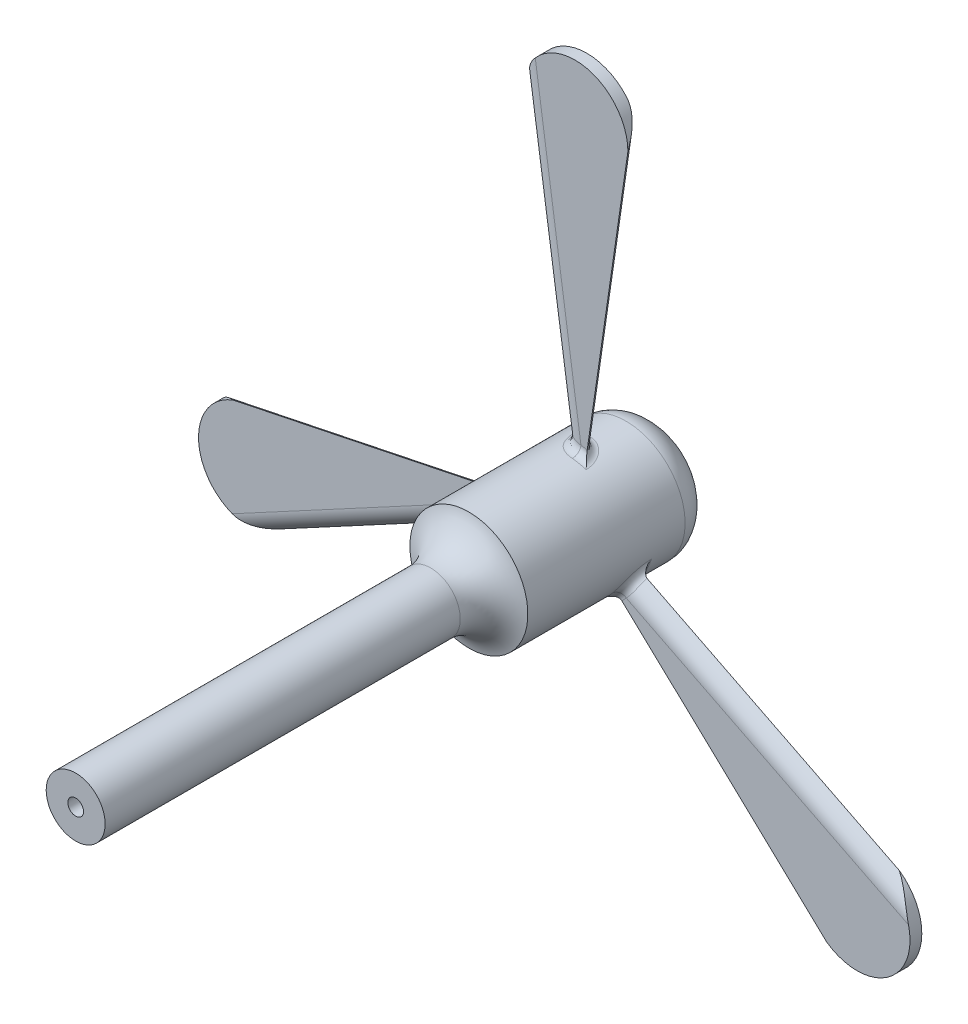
ISO-10303-21;
HEADER;
FILE_DESCRIPTION(('STEP AP214'),'2;1');
FILE_NAME('part.step','',(''),(''),'','','');
FILE_SCHEMA(('AUTOMOTIVE_DESIGN { 1 0 10303 214 1 1 1 1 }'));
ENDSEC;
DATA;
#1=APPLICATION_CONTEXT('core data for automotive mechanical design processes');
#2=APPLICATION_PROTOCOL_DEFINITION('international standard','automotive_design',2000,#1);
#3=PRODUCT_CONTEXT('',#1,'mechanical');
#4=PRODUCT('Part','Part','',(#3));
#5=PRODUCT_RELATED_PRODUCT_CATEGORY('part','',(#4));
#6=PRODUCT_DEFINITION_FORMATION('','',#4);
#7=PRODUCT_DEFINITION_CONTEXT('part definition',#1,'design');
#8=PRODUCT_DEFINITION('design','',#6,#7);
#9=PRODUCT_DEFINITION_SHAPE('','',#8);
#10=(LENGTH_UNIT() NAMED_UNIT(*) SI_UNIT(.MILLI.,.METRE.));
#11=(NAMED_UNIT(*) PLANE_ANGLE_UNIT() SI_UNIT($,.RADIAN.));
#12=(NAMED_UNIT(*) SI_UNIT($,.STERADIAN.) SOLID_ANGLE_UNIT());
#13=UNCERTAINTY_MEASURE_WITH_UNIT(LENGTH_MEASURE(1.E-05),#10,'distance_accuracy_value','');
#14=(GEOMETRIC_REPRESENTATION_CONTEXT(3) GLOBAL_UNCERTAINTY_ASSIGNED_CONTEXT((#13)) GLOBAL_UNIT_ASSIGNED_CONTEXT((#10,
#11,#12)) REPRESENTATION_CONTEXT('',''));
#15=CARTESIAN_POINT('',(0.,0.,0.));
#16=DIRECTION('',(0.,0.,1.));
#17=DIRECTION('',(1.,0.,0.));
#18=AXIS2_PLACEMENT_3D('',#15,#16,#17);
#19=CARTESIAN_POINT('',(0.,0.,-40.));
#20=DIRECTION('',(0.,0.,1.));
#21=DIRECTION('',(1.,0.,0.));
#22=AXIS2_PLACEMENT_3D('',#19,#20,#21);
#23=CYLINDRICAL_SURFACE('',#22,15.);
#24=CARTESIAN_POINT('',(0.,0.,-32.));
#25=DIRECTION('',(0.,0.,-1.));
#26=DIRECTION('',(-1.,0.,0.));
#27=AXIS2_PLACEMENT_3D('',#24,#25,#26);
#28=CIRCLE('',#27,15.);
#29=CARTESIAN_POINT('',(-4.80752396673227,14.2087196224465,-32.));
#30=VERTEX_POINT('',#29);
#31=CARTESIAN_POINT('',(-1.32750595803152,14.9411421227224,-32.));
#32=VERTEX_POINT('',#31);
#33=EDGE_CURVE('E445',#30,#32,#28,.T.);
#34=ORIENTED_EDGE('',*,*,#33,.T.);
#35=CARTESIAN_POINT('',(-2.34038640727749,14.8162947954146,-31.9105589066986));
#36=CARTESIAN_POINT('',(-2.05340421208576,14.8616265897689,-30.0253777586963));
#37=CARTESIAN_POINT('',(-2.33709119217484,16.7457378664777,-29.9361135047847));
#38=CARTESIAN_POINT('',(-2.17382423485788,14.8426177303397,-31.9400126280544));
#39=CARTESIAN_POINT('',(-1.92905624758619,14.8779367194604,-30.0297687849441));
#40=CARTESIAN_POINT('',(-2.19990936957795,16.7831061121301,-29.9571518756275));
#41=CARTESIAN_POINT('',(-2.00590889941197,14.8662465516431,-31.9623595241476));
#42=CARTESIAN_POINT('',(-1.80685269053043,14.8925358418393,-30.0296370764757));
#43=CARTESIAN_POINT('',(-2.06174774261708,16.8175019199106,-29.973113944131));
#44=CARTESIAN_POINT('',(-1.66795108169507,14.9079495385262,-31.9923773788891));
#45=CARTESIAN_POINT('',(-1.56487393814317,14.9189272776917,-30.0210065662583));
#46=CARTESIAN_POINT('',(-1.78394536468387,16.8801343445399,-29.9945552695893));
#47=CARTESIAN_POINT('',(-1.49790432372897,14.9260096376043,-32.0000114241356));
#48=CARTESIAN_POINT('',(-1.44531242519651,14.9306699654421,-30.0124278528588));
#49=CARTESIAN_POINT('',(-1.64430177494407,16.90835531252,-30.0000081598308));
#50=CARTESIAN_POINT('',(-1.00114342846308,14.9701252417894,-31.9999781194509));
#51=CARTESIAN_POINT('',(-1.09980904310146,14.9613827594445,-29.9759793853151));
#52=CARTESIAN_POINT('',(-1.23675854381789,16.9810600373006,-29.9999843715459));
#53=CARTESIAN_POINT('',(-0.673491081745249,14.9883688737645,-31.9719100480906));
#54=CARTESIAN_POINT('',(-0.8797210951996,14.976788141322,-29.9377073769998));
#55=CARTESIAN_POINT('',(-0.96845482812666,17.0167866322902,-29.9799357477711));
#56=CARTESIAN_POINT('',(-0.0255944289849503,15.0034846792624,-31.8580298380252));
#57=CARTESIAN_POINT('',(-0.447166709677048,15.0004692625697,-29.8349056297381));
#58=CARTESIAN_POINT('',(-0.43888422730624,17.063820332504,-29.8985927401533));
#59=CARTESIAN_POINT('',(0.294648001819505,15.0003515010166,-31.7722032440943));
#60=CARTESIAN_POINT('',(-0.23624457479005,15.0086216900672,-29.7705808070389));
#61=CARTESIAN_POINT('',(-0.17761912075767,17.0751213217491,-29.8372880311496));
#62=CARTESIAN_POINT('',(0.91822935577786,14.9751206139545,-31.5438627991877));
#63=CARTESIAN_POINT('',(0.180806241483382,15.0181538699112,-29.6142553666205));
#64=CARTESIAN_POINT('',(0.330234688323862,17.0755756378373,-29.6741877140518));
#65=CARTESIAN_POINT('',(1.22156829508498,14.9530229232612,-31.4013490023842));
#66=CARTESIAN_POINT('',(0.385595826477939,15.0195108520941,-29.5227913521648));
#67=CARTESIAN_POINT('',(0.576823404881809,17.0647289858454,-29.5723921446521));
#68=CARTESIAN_POINT('',(1.80265781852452,14.8941554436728,-31.0631624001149));
#69=CARTESIAN_POINT('',(0.789892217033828,15.0148629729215,-29.3082777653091));
#70=CARTESIAN_POINT('',(1.04843387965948,17.0253215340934,-29.3308302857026));
#71=CARTESIAN_POINT('',(2.08040384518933,14.8573830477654,-30.867480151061));
#72=CARTESIAN_POINT('',(0.988421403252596,15.0089189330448,-29.1859766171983));
#73=CARTESIAN_POINT('',(1.27345179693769,16.9967575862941,-29.1910572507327));
#74=CARTESIAN_POINT('',(2.60380723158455,14.774663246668,-30.427800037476));
#75=CARTESIAN_POINT('',(1.3756403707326,14.989666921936,-28.9058260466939));
#76=CARTESIAN_POINT('',(1.69686911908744,16.9278073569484,-28.8770000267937));
#77=CARTESIAN_POINT('',(2.84938123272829,14.7286927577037,-30.1836806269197));
#78=CARTESIAN_POINT('',(1.56383043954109,14.9764485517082,-28.7486899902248));
#79=CARTESIAN_POINT('',(1.89519941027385,16.8873912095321,-28.702629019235));
#80=CARTESIAN_POINT('',(3.30210320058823,14.6338554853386,-29.6538944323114));
#81=CARTESIAN_POINT('',(1.92154136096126,14.9443810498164,-28.3980809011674));
#82=CARTESIAN_POINT('',(2.2603591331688,16.8015164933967,-28.3242103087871));
#83=CARTESIAN_POINT('',(3.50924160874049,14.5849879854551,-29.3682173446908));
#84=CARTESIAN_POINT('',(2.09111836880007,14.9256166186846,-28.2052240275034));
#85=CARTESIAN_POINT('',(2.42718072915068,16.7560566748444,-28.1201552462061));
#86=CARTESIAN_POINT('',(3.88880646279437,14.4885216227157,-28.7494339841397));
#87=CARTESIAN_POINT('',(2.40894322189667,14.8850570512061,-27.7769064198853));
#88=CARTESIAN_POINT('',(2.73254769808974,16.6649587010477,-27.6781671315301));
#89=CARTESIAN_POINT('',(4.05934381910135,14.4410690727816,-28.414810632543));
#90=CARTESIAN_POINT('',(2.5565756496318,14.8631650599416,-27.5400997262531));
#91=CARTESIAN_POINT('',(2.86955780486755,16.6193978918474,-27.4391504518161));
#92=CARTESIAN_POINT('',(4.35010537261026,14.3561732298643,-27.7169068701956));
#93=CARTESIAN_POINT('',(2.81184523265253,14.8219435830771,-27.0366035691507));
#94=CARTESIAN_POINT('',(3.10297150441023,16.5372223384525,-26.9406477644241));
#95=CARTESIAN_POINT('',(4.47033678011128,14.3187285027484,-27.3536305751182));
#96=CARTESIAN_POINT('',(2.92025976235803,14.8025314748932,-26.7695787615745));
#97=CARTESIAN_POINT('',(3.19938091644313,16.5006063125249,-26.6811646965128));
#98=CARTESIAN_POINT('',(4.61150630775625,14.2736253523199,-26.7922738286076));
#99=CARTESIAN_POINT('',(3.04849766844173,14.7785704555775,-26.3517381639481));
#100=CARTESIAN_POINT('',(3.31252720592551,16.4563322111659,-26.2801955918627));
#101=CARTESIAN_POINT('',(4.65219213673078,14.2603764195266,-26.6008621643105));
#102=CARTESIAN_POINT('',(3.08567957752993,14.7714077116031,-26.2086093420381));
#103=CARTESIAN_POINT('',(3.34512500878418,16.443290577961,-26.1434729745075));
#104=CARTESIAN_POINT('',(4.7196518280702,14.2381944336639,-26.2146204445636));
#105=CARTESIAN_POINT('',(3.14747989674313,14.7593178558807,-25.9187360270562));
#106=CARTESIAN_POINT('',(3.39916430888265,16.4214251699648,-25.8675860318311));
#107=CARTESIAN_POINT('',(4.74643087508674,14.2292597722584,-26.0197916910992));
#108=CARTESIAN_POINT('',(3.17217143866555,14.7543771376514,-25.7718456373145));
#109=CARTESIAN_POINT('',(3.42060996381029,16.4125998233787,-25.7284226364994));
#110=CARTESIAN_POINT('',(4.78591190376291,14.2160287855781,-25.6279997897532));
#111=CARTESIAN_POINT('',(3.20859057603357,14.747038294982,-25.4758964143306));
#112=CARTESIAN_POINT('',(3.45222513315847,16.399522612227,-25.4485712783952));
#113=CARTESIAN_POINT('',(4.7986051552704,14.2117353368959,-25.4310353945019));
#114=CARTESIAN_POINT('',(3.22035277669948,14.7446332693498,-25.3266675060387));
#115=CARTESIAN_POINT('',(3.46238765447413,16.395273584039,-25.3078824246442));
#116=CARTESIAN_POINT('',(4.80980434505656,14.207949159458,-25.0366019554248));
#117=CARTESIAN_POINT('',(3.23071620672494,14.7425159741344,-25.0278007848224));
#118=CARTESIAN_POINT('',(3.4713540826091,16.3915268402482,-25.0261442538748));
#119=CARTESIAN_POINT('',(4.80831578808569,14.208454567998,-24.8391331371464));
#120=CARTESIAN_POINT('',(3.22933494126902,14.7428001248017,-24.8779847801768));
#121=CARTESIAN_POINT('',(3.47016239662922,16.3920272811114,-24.8850950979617));
#122=CARTESIAN_POINT('',(4.79130834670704,14.2141986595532,-24.4481931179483));
#123=CARTESIAN_POINT('',(3.21360240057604,14.7460092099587,-24.5818750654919));
#124=CARTESIAN_POINT('',(3.45654543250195,16.3977107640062,-24.605852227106));
#125=CARTESIAN_POINT('',(4.77601135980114,14.2193624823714,-24.2547080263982));
#126=CARTESIAN_POINT('',(3.19943803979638,14.7488960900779,-24.4353911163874));
#127=CARTESIAN_POINT('',(3.44429781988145,16.4028197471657,-24.4676485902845));
#128=CARTESIAN_POINT('',(4.73179537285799,14.2341366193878,-23.869962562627));
#129=CARTESIAN_POINT('',(3.1586952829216,14.7570691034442,-24.14504850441));
#130=CARTESIAN_POINT('',(3.40888902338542,16.417416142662,-24.1928304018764));
#131=CARTESIAN_POINT('',(4.70287599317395,14.2437470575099,-23.6787022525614));
#132=CARTESIAN_POINT('',(3.13207077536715,14.762364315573,-24.0010324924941));
#133=CARTESIAN_POINT('',(3.38572753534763,16.4269036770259,-24.0562158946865));
#134=CARTESIAN_POINT('',(4.63156679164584,14.2670961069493,-23.2996166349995));
#135=CARTESIAN_POINT('',(3.06684098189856,14.7750381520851,-23.7169786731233));
#136=CARTESIAN_POINT('',(3.32859997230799,16.4499055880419,-23.7854404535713));
#137=CARTESIAN_POINT('',(4.58916684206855,14.2808378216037,-23.1117940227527));
#138=CARTESIAN_POINT('',(3.02815722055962,14.7824311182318,-23.5768072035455));
#139=CARTESIAN_POINT('',(3.29462577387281,16.4634229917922,-23.6512814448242));
#140=CARTESIAN_POINT('',(4.49117807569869,14.3119468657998,-22.7410202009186));
#141=CARTESIAN_POINT('',(2.93952337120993,14.7988338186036,-23.3018196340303));
#142=CARTESIAN_POINT('',(3.21607936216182,16.4939315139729,-23.3864430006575));
#143=CARTESIAN_POINT('',(4.43558953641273,14.3293141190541,-22.5580688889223));
#144=CARTESIAN_POINT('',(2.88948731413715,14.8078576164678,-23.166895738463));
#145=CARTESIAN_POINT('',(3.17150737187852,16.510922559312,-23.2557634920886));
#146=CARTESIAN_POINT('',(4.37354329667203,14.3482444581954,-22.378193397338));
#147=CARTESIAN_POINT('',(2.83427863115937,14.8174336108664,-23.0356832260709));
#148=CARTESIAN_POINT('',(3.12173642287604,16.5293754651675,-23.1272809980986));
#149=(BOUNDED_SURFACE() B_SPLINE_SURFACE(3,2,((#35,#36,#37),(#38,#39,#40),(#41,#42,#43),(#44,
#45,#46),(#47,#48,#49),(#50,#51,#52),(#53,#54,#55),(#56,#57,#58),(#59,#60,#61),(#62,#63,#64),
(#65,#66,#67),(#68,#69,#70),(#71,#72,#73),(#74,#75,#76),(#77,#78,#79),(#80,#81,#82),(#83,#84,
#85),(#86,#87,#88),(#89,#90,#91),(#92,#93,#94),(#95,#96,#97),(#98,#99,#100),(#101,#102,#103),
(#104,#105,#106),(#107,#108,#109),(#110,#111,#112),(#113,#114,#115),(#116,#117,#118),(#119,#120,
#121),(#122,#123,#124),(#125,#126,#127),(#128,#129,#130),(#131,#132,#133),(#134,#135,#136),
(#137,#138,#139),(#140,#141,#142),(#143,#144,#145),(#146,#147,#148)),.UNSPECIFIED.,.F.,.F.,
.F.) B_SPLINE_SURFACE_WITH_KNOTS((4,2,2,2,2,2,2,2,2,2,2,2,2,2,2,2,2,2,4),(3,3),(0.,
0.579817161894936,1.16108715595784,2.27438859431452,3.38796876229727,4.50154786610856,
5.61532488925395,6.73193294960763,7.84881832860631,9.01401604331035,10.1790466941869,
10.7708275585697,11.3623876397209,11.9543141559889,12.5460109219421,13.1283653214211,
13.7107359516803,14.2935451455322,14.8763420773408),(0.,1.),
.UNSPECIFIED.) GEOMETRIC_REPRESENTATION_ITEM() RATIONAL_B_SPLINE_SURFACE(((1.,0.72365409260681,
1.),(1.,0.720385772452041,1.),(1.,0.717353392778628,1.),(1.,0.711815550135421,1.),(1.,
0.709311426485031,1.),(1.,0.70288424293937,1.),(1.,0.699760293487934,1.),(1.,0.695921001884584,
1.),(1.,0.695206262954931,1.),(1.,0.696025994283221,1.),(1.,0.697560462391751,1.),(1.,
0.702398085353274,1.),(1.,0.705701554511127,1.),(1.,0.713406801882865,1.),(1.,0.717811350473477,
1.),(1.,0.726977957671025,1.),(1.,0.731740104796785,1.),(1.,0.741136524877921,1.),(1.,
0.745756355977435,1.),(1.,0.753994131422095,1.),(1.,0.757612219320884,1.),(1.,0.761958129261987,
1.),(1.,0.763232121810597,1.),(1.,0.765362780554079,1.),(1.,0.766219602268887,1.),(1.,
0.767487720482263,1.),(1.,0.767898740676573,1.),(1.,0.76826122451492,1.),(1.,0.768212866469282,
1.),(1.,0.767662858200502,1.),(1.,0.767168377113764,1.),(1.,0.765751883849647,1.),(1.,
0.764829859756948,1.),(1.,0.762585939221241,1.),(1.,0.7612637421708,1.),(1.,0.7582647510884,1.),
(1.,0.756587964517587,1.),(1.,0.754756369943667,1.))) REPRESENTATION_ITEM('') SURFACE());
#150=CARTESIAN_POINT('',(-2.34038640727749,14.8162947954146,-31.9105589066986));
#151=CARTESIAN_POINT('',(-2.17382423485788,14.8426177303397,-31.9400126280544));
#152=CARTESIAN_POINT('',(-2.00590889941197,14.8662465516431,-31.9623595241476));
#153=CARTESIAN_POINT('',(-1.66795108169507,14.9079495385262,-31.9923773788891));
#154=CARTESIAN_POINT('',(-1.49790432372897,14.9260096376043,-32.0000114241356));
#155=CARTESIAN_POINT('',(-1.00114342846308,14.9701252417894,-31.9999781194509));
#156=CARTESIAN_POINT('',(-0.673491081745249,14.9883688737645,-31.9719100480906));
#157=CARTESIAN_POINT('',(-0.0255944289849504,15.0034846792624,-31.8580298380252));
#158=CARTESIAN_POINT('',(0.294648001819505,15.0003515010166,-31.7722032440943));
#159=CARTESIAN_POINT('',(0.91822935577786,14.9751206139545,-31.5438627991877));
#160=CARTESIAN_POINT('',(1.22156829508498,14.9530229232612,-31.4013490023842));
#161=CARTESIAN_POINT('',(1.80265781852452,14.8941554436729,-31.0631624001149));
#162=CARTESIAN_POINT('',(2.08040384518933,14.8573830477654,-30.867480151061));
#163=CARTESIAN_POINT('',(2.60380723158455,14.774663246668,-30.427800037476));
#164=CARTESIAN_POINT('',(2.84938123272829,14.7286927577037,-30.1836806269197));
#165=CARTESIAN_POINT('',(3.30210320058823,14.6338554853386,-29.6538944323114));
#166=CARTESIAN_POINT('',(3.50924160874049,14.5849879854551,-29.3682173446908));
#167=CARTESIAN_POINT('',(3.88880646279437,14.4885216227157,-28.7494339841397));
#168=CARTESIAN_POINT('',(4.05934381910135,14.4410690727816,-28.414810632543));
#169=CARTESIAN_POINT('',(4.35010537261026,14.3561732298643,-27.7169068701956));
#170=CARTESIAN_POINT('',(4.47033678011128,14.3187285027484,-27.3536305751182));
#171=CARTESIAN_POINT('',(4.61150630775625,14.2736253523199,-26.7922738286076));
#172=CARTESIAN_POINT('',(4.65219213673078,14.2603764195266,-26.6008621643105));
#173=CARTESIAN_POINT('',(4.7196518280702,14.2381944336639,-26.2146204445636));
#174=CARTESIAN_POINT('',(4.74643087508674,14.2292597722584,-26.0197916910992));
#175=CARTESIAN_POINT('',(4.78591190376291,14.2160287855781,-25.6279997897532));
#176=CARTESIAN_POINT('',(4.7986051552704,14.2117353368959,-25.4310353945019));
#177=CARTESIAN_POINT('',(4.80980434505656,14.207949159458,-25.0366019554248));
#178=CARTESIAN_POINT('',(4.80831578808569,14.208454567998,-24.8391331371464));
#179=CARTESIAN_POINT('',(4.79130834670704,14.2141986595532,-24.4481931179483));
#180=CARTESIAN_POINT('',(4.77601135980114,14.2193624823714,-24.2547080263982));
#181=CARTESIAN_POINT('',(4.73179537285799,14.2341366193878,-23.869962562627));
#182=CARTESIAN_POINT('',(4.70287599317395,14.2437470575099,-23.6787022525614));
#183=CARTESIAN_POINT('',(4.63156679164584,14.2670961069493,-23.2996166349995));
#184=CARTESIAN_POINT('',(4.58916684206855,14.2808378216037,-23.1117940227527));
#185=CARTESIAN_POINT('',(4.49117807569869,14.3119468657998,-22.7410202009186));
#186=CARTESIAN_POINT('',(4.43558953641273,14.3293141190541,-22.5580688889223));
#187=CARTESIAN_POINT('',(4.37354329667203,14.3482444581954,-22.378193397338));
#188=B_SPLINE_CURVE_WITH_KNOTS('',3,(#150,#151,#152,#153,#154,#155,#156,#157,#158,#159,#160,
#161,#162,#163,#164,#165,#166,#167,#168,#169,#170,#171,#172,#173,#174,#175,#176,#177,#178,#179,
#180,#181,#182,#183,#184,#185,#186,#187),.UNSPECIFIED.,.F.,.F.,(4,2,2,2,2,2,2,2,2,2,2,2,2,2,2,2,
2,2,4),(0.,0.579817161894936,1.16108715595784,2.27438859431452,3.38796876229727,
4.50154786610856,5.61532488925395,6.73193294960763,7.84881832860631,9.01401604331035,
10.1790466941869,10.7708275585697,11.3623876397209,11.9543141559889,12.5460109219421,
13.1283653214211,13.7107359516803,14.2935451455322,14.8763420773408),.UNSPECIFIED.);
#189=CARTESIAN_POINT('',(4.80752396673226,14.2087196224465,-25.));
#190=VERTEX_POINT('',#189);
#191=EDGE_CURVE('E623',#32,#190,#188,.T.);
#192=ORIENTED_EDGE('',*,*,#191,.T.);
#193=CARTESIAN_POINT('',(0.,0.,-25.));
#194=DIRECTION('',(0.,0.,-1.));
#195=DIRECTION('',(-1.,0.,0.));
#196=AXIS2_PLACEMENT_3D('',#193,#194,#195);
#197=CIRCLE('',#196,15.);
#198=CARTESIAN_POINT('',(1.32750595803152,14.9411421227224,-25.));
#199=VERTEX_POINT('',#198);
#200=EDGE_CURVE('E685',#190,#199,#197,.F.);
#201=ORIENTED_EDGE('',*,*,#200,.T.);
#202=CARTESIAN_POINT('',(2.34038640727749,14.8162947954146,-25.0894410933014));
#203=CARTESIAN_POINT('',(2.05340421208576,14.8616265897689,-26.9746222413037));
#204=CARTESIAN_POINT('',(2.33709119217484,16.7457378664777,-27.0638864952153));
#205=CARTESIAN_POINT('',(2.17382423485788,14.8426177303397,-25.0599873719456));
#206=CARTESIAN_POINT('',(1.92905624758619,14.8779367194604,-26.9702312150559));
#207=CARTESIAN_POINT('',(2.19990936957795,16.7831061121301,-27.0428481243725));
#208=CARTESIAN_POINT('',(2.00590889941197,14.8662465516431,-25.0376404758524));
#209=CARTESIAN_POINT('',(1.80685269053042,14.8925358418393,-26.9703629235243));
#210=CARTESIAN_POINT('',(2.06174774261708,16.8175019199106,-27.026886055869));
#211=CARTESIAN_POINT('',(1.66795108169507,14.9079495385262,-25.0076226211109));
#212=CARTESIAN_POINT('',(1.56487393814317,14.9189272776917,-26.9789934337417));
#213=CARTESIAN_POINT('',(1.78394536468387,16.8801343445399,-27.0054447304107));
#214=CARTESIAN_POINT('',(1.49790432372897,14.9260096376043,-24.9999885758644));
#215=CARTESIAN_POINT('',(1.44531242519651,14.9306699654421,-26.9875721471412));
#216=CARTESIAN_POINT('',(1.64430177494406,16.90835531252,-26.9999918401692));
#217=CARTESIAN_POINT('',(1.00114342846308,14.9701252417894,-25.0000218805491));
#218=CARTESIAN_POINT('',(1.09980904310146,14.9613827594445,-27.0240206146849));
#219=CARTESIAN_POINT('',(1.23675854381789,16.9810600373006,-27.0000156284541));
#220=CARTESIAN_POINT('',(0.673491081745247,14.9883688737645,-25.0280899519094));
#221=CARTESIAN_POINT('',(0.879721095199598,14.976788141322,-27.0622926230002));
#222=CARTESIAN_POINT('',(0.968454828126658,17.0167866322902,-27.0200642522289));
#223=CARTESIAN_POINT('',(0.0255944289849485,15.0034846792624,-25.1419701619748));
#224=CARTESIAN_POINT('',(0.447166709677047,15.0004692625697,-27.1650943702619));
#225=CARTESIAN_POINT('',(0.438884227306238,17.063820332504,-27.1014072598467));
#226=CARTESIAN_POINT('',(-0.294648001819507,15.0003515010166,-25.2277967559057));
#227=CARTESIAN_POINT('',(0.23624457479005,15.0086216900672,-27.2294191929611));
#228=CARTESIAN_POINT('',(0.177619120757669,17.0751213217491,-27.1627119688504));
#229=CARTESIAN_POINT('',(-0.918229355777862,14.9751206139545,-25.4561372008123));
#230=CARTESIAN_POINT('',(-0.180806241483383,15.0181538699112,-27.3857446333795));
#231=CARTESIAN_POINT('',(-0.330234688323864,17.0755756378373,-27.3258122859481));
#232=CARTESIAN_POINT('',(-1.22156829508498,14.9530229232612,-25.5986509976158));
#233=CARTESIAN_POINT('',(-0.385595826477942,15.0195108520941,-27.4772086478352));
#234=CARTESIAN_POINT('',(-0.576823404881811,17.0647289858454,-27.4276078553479));
#235=CARTESIAN_POINT('',(-1.80265781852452,14.8941554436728,-25.9368375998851));
#236=CARTESIAN_POINT('',(-0.789892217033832,15.0148629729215,-27.6917222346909));
#237=CARTESIAN_POINT('',(-1.04843387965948,17.0253215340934,-27.6691697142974));
#238=CARTESIAN_POINT('',(-2.08040384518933,14.8573830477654,-26.132519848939));
#239=CARTESIAN_POINT('',(-0.988421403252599,15.0089189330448,-27.8140233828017));
#240=CARTESIAN_POINT('',(-1.27345179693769,16.9967575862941,-27.8089427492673));
#241=CARTESIAN_POINT('',(-2.60380723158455,14.774663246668,-26.572199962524));
#242=CARTESIAN_POINT('',(-1.37564037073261,14.989666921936,-28.0941739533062));
#243=CARTESIAN_POINT('',(-1.69686911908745,16.9278073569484,-28.1229999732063));
#244=CARTESIAN_POINT('',(-2.84938123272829,14.7286927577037,-26.8163193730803));
#245=CARTESIAN_POINT('',(-1.56383043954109,14.9764485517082,-28.2513100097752));
#246=CARTESIAN_POINT('',(-1.89519941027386,16.8873912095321,-28.297370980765));
#247=CARTESIAN_POINT('',(-3.30210320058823,14.6338554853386,-27.3461055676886));
#248=CARTESIAN_POINT('',(-1.92154136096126,14.9443810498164,-28.6019190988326));
#249=CARTESIAN_POINT('',(-2.2603591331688,16.8015164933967,-28.6757896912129));
#250=CARTESIAN_POINT('',(-3.50924160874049,14.5849879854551,-27.6317826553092));
#251=CARTESIAN_POINT('',(-2.09111836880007,14.9256166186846,-28.7947759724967));
#252=CARTESIAN_POINT('',(-2.42718072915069,16.7560566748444,-28.8798447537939));
#253=CARTESIAN_POINT('',(-3.88880646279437,14.4885216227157,-28.2505660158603));
#254=CARTESIAN_POINT('',(-2.40894322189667,14.8850570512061,-29.2230935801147));
#255=CARTESIAN_POINT('',(-2.73254769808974,16.6649587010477,-29.3218328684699));
#256=CARTESIAN_POINT('',(-4.05934381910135,14.4410690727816,-28.585189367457));
#257=CARTESIAN_POINT('',(-2.55657564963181,14.8631650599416,-29.459900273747));
#258=CARTESIAN_POINT('',(-2.86955780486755,16.6193978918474,-29.5608495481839));
#259=CARTESIAN_POINT('',(-4.35010537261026,14.3561732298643,-29.2830931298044));
#260=CARTESIAN_POINT('',(-2.81184523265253,14.8219435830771,-29.9633964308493));
#261=CARTESIAN_POINT('',(-3.10297150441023,16.5372223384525,-30.0593522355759));
#262=CARTESIAN_POINT('',(-4.47033678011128,14.3187285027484,-29.6463694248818));
#263=CARTESIAN_POINT('',(-2.92025976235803,14.8025314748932,-30.2304212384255));
#264=CARTESIAN_POINT('',(-3.19938091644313,16.5006063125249,-30.3188353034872));
#265=CARTESIAN_POINT('',(-4.61150630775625,14.2736253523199,-30.2077261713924));
#266=CARTESIAN_POINT('',(-3.04849766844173,14.7785704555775,-30.6482618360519));
#267=CARTESIAN_POINT('',(-3.31252720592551,16.4563322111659,-30.7198044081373));
#268=CARTESIAN_POINT('',(-4.65219213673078,14.2603764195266,-30.3991378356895));
#269=CARTESIAN_POINT('',(-3.08567957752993,14.7714077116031,-30.791390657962));
#270=CARTESIAN_POINT('',(-3.34512500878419,16.443290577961,-30.8565270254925));
#271=CARTESIAN_POINT('',(-4.7196518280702,14.2381944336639,-30.7853795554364));
#272=CARTESIAN_POINT('',(-3.14747989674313,14.7593178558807,-31.0812639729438));
#273=CARTESIAN_POINT('',(-3.39916430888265,16.4214251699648,-31.1324139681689));
#274=CARTESIAN_POINT('',(-4.74643087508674,14.2292597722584,-30.9802083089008));
#275=CARTESIAN_POINT('',(-3.17217143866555,14.7543771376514,-31.2281543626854));
#276=CARTESIAN_POINT('',(-3.4206099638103,16.4125998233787,-31.2715773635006));
#277=CARTESIAN_POINT('',(-4.78591190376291,14.2160287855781,-31.3720002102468));
#278=CARTESIAN_POINT('',(-3.20859057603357,14.747038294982,-31.5241035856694));
#279=CARTESIAN_POINT('',(-3.45222513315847,16.399522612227,-31.5514287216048));
#280=CARTESIAN_POINT('',(-4.7986051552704,14.2117353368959,-31.5689646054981));
#281=CARTESIAN_POINT('',(-3.22035277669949,14.7446332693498,-31.6733324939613));
#282=CARTESIAN_POINT('',(-3.46238765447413,16.395273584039,-31.6921175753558));
#283=CARTESIAN_POINT('',(-4.80980434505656,14.207949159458,-31.9633980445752));
#284=CARTESIAN_POINT('',(-3.23071620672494,14.7425159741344,-31.9721992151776));
#285=CARTESIAN_POINT('',(-3.4713540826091,16.3915268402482,-31.9738557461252));
#286=CARTESIAN_POINT('',(-4.80831578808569,14.208454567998,-32.1608668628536));
#287=CARTESIAN_POINT('',(-3.22933494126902,14.7428001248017,-32.1220152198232));
#288=CARTESIAN_POINT('',(-3.47016239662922,16.3920272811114,-32.1149049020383));
#289=CARTESIAN_POINT('',(-4.79130834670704,14.2141986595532,-32.5518068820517));
#290=CARTESIAN_POINT('',(-3.21360240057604,14.7460092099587,-32.4181249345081));
#291=CARTESIAN_POINT('',(-3.45654543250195,16.3977107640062,-32.394147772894));
#292=CARTESIAN_POINT('',(-4.77601135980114,14.2193624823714,-32.7452919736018));
#293=CARTESIAN_POINT('',(-3.19943803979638,14.7488960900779,-32.5646088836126));
#294=CARTESIAN_POINT('',(-3.44429781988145,16.4028197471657,-32.5323514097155));
#295=CARTESIAN_POINT('',(-4.73179537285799,14.2341366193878,-33.1300374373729));
#296=CARTESIAN_POINT('',(-3.1586952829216,14.7570691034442,-32.85495149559));
#297=CARTESIAN_POINT('',(-3.40888902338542,16.417416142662,-32.8071695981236));
#298=CARTESIAN_POINT('',(-4.70287599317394,14.2437470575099,-33.3212977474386));
#299=CARTESIAN_POINT('',(-3.13207077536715,14.762364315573,-32.9989675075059));
#300=CARTESIAN_POINT('',(-3.38572753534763,16.4269036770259,-32.9437841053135));
#301=CARTESIAN_POINT('',(-4.63156679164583,14.2670961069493,-33.7003833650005));
#302=CARTESIAN_POINT('',(-3.06684098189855,14.7750381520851,-33.2830213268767));
#303=CARTESIAN_POINT('',(-3.32859997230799,16.4499055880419,-33.2145595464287));
#304=CARTESIAN_POINT('',(-4.58916684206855,14.2808378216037,-33.8882059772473));
#305=CARTESIAN_POINT('',(-3.02815722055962,14.7824311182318,-33.4231927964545));
#306=CARTESIAN_POINT('',(-3.29462577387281,16.4634229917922,-33.3487185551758));
#307=CARTESIAN_POINT('',(-4.4911780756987,14.3119468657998,-34.2589797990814));
#308=CARTESIAN_POINT('',(-2.93952337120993,14.7988338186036,-33.6981803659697));
#309=CARTESIAN_POINT('',(-3.21607936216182,16.4939315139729,-33.6135569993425));
#310=CARTESIAN_POINT('',(-4.43558953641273,14.3293141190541,-34.4419311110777));
#311=CARTESIAN_POINT('',(-2.88948731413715,14.8078576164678,-33.833104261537));
#312=CARTESIAN_POINT('',(-3.17150737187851,16.510922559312,-33.7442365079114));
#313=CARTESIAN_POINT('',(-4.37354329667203,14.3482444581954,-34.621806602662));
#314=CARTESIAN_POINT('',(-2.83427863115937,14.8174336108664,-33.9643167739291));
#315=CARTESIAN_POINT('',(-3.12173642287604,16.5293754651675,-33.8727190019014));
#316=(BOUNDED_SURFACE() B_SPLINE_SURFACE(3,2,((#202,#203,#204),(#205,#206,#207),(#208,#209,
#210),(#211,#212,#213),(#214,#215,#216),(#217,#218,#219),(#220,#221,#222),(#223,#224,#225),
(#226,#227,#228),(#229,#230,#231),(#232,#233,#234),(#235,#236,#237),(#238,#239,#240),(#241,#242,
#243),(#244,#245,#246),(#247,#248,#249),(#250,#251,#252),(#253,#254,#255),(#256,#257,#258),
(#259,#260,#261),(#262,#263,#264),(#265,#266,#267),(#268,#269,#270),(#271,#272,#273),(#274,#275,
#276),(#277,#278,#279),(#280,#281,#282),(#283,#284,#285),(#286,#287,#288),(#289,#290,#291),
(#292,#293,#294),(#295,#296,#297),(#298,#299,#300),(#301,#302,#303),(#304,#305,#306),(#307,#308,
#309),(#310,#311,#312),(#313,#314,#315)),.UNSPECIFIED.,.F.,.F.,
.F.) B_SPLINE_SURFACE_WITH_KNOTS((4,2,2,2,2,2,2,2,2,2,2,2,2,2,2,2,2,2,4),(3,3),(0.,
0.579817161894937,1.16108715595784,2.27438859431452,3.38796876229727,4.50154786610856,
5.61532488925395,6.73193294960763,7.84881832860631,9.01401604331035,10.1790466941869,
10.7708275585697,11.3623876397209,11.9543141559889,12.5460109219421,13.1283653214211,
13.7107359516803,14.2935451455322,14.8763420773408),(0.,1.),
.UNSPECIFIED.) GEOMETRIC_REPRESENTATION_ITEM() RATIONAL_B_SPLINE_SURFACE(((1.,0.72365409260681,
1.),(1.,0.720385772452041,1.),(1.,0.717353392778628,1.),(1.,0.711815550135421,1.),(1.,
0.709311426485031,1.),(1.,0.70288424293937,1.),(1.,0.699760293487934,1.),(1.,0.695921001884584,
1.),(1.,0.695206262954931,1.),(1.,0.696025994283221,1.),(1.,0.697560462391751,1.),(1.,
0.702398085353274,1.),(1.,0.705701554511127,1.),(1.,0.713406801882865,1.),(1.,0.717811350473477,
1.),(1.,0.726977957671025,1.),(1.,0.731740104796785,1.),(1.,0.741136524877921,1.),(1.,
0.745756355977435,1.),(1.,0.753994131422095,1.),(1.,0.757612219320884,1.),(1.,0.761958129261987,
1.),(1.,0.763232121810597,1.),(1.,0.765362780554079,1.),(1.,0.766219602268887,1.),(1.,
0.767487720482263,1.),(1.,0.767898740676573,1.),(1.,0.76826122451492,1.),(1.,0.768212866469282,
1.),(1.,0.767662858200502,1.),(1.,0.767168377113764,1.),(1.,0.765751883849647,1.),(1.,
0.764829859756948,1.),(1.,0.762585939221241,1.),(1.,0.7612637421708,1.),(1.,0.7582647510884,1.),
(1.,0.756587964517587,1.),(1.,0.754756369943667,1.))) REPRESENTATION_ITEM('') SURFACE());
#317=CARTESIAN_POINT('',(2.34038640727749,14.8162947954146,-25.0894410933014));
#318=CARTESIAN_POINT('',(2.17382423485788,14.8426177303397,-25.0599873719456));
#319=CARTESIAN_POINT('',(2.00590889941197,14.8662465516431,-25.0376404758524));
#320=CARTESIAN_POINT('',(1.66795108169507,14.9079495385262,-25.0076226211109));
#321=CARTESIAN_POINT('',(1.49790432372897,14.9260096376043,-24.9999885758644));
#322=CARTESIAN_POINT('',(1.00114342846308,14.9701252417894,-25.0000218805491));
#323=CARTESIAN_POINT('',(0.673491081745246,14.9883688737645,-25.0280899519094));
#324=CARTESIAN_POINT('',(0.0255944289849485,15.0034846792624,-25.1419701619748));
#325=CARTESIAN_POINT('',(-0.294648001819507,15.0003515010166,-25.2277967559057));
#326=CARTESIAN_POINT('',(-0.918229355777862,14.9751206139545,-25.4561372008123));
#327=CARTESIAN_POINT('',(-1.22156829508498,14.9530229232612,-25.5986509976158));
#328=CARTESIAN_POINT('',(-1.80265781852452,14.8941554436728,-25.9368375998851));
#329=CARTESIAN_POINT('',(-2.08040384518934,14.8573830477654,-26.132519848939));
#330=CARTESIAN_POINT('',(-2.60380723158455,14.774663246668,-26.572199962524));
#331=CARTESIAN_POINT('',(-2.84938123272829,14.7286927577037,-26.8163193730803));
#332=CARTESIAN_POINT('',(-3.30210320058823,14.6338554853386,-27.3461055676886));
#333=CARTESIAN_POINT('',(-3.50924160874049,14.5849879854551,-27.6317826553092));
#334=CARTESIAN_POINT('',(-3.88880646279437,14.4885216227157,-28.2505660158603));
#335=CARTESIAN_POINT('',(-4.05934381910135,14.4410690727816,-28.585189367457));
#336=CARTESIAN_POINT('',(-4.35010537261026,14.3561732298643,-29.2830931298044));
#337=CARTESIAN_POINT('',(-4.47033678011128,14.3187285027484,-29.6463694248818));
#338=CARTESIAN_POINT('',(-4.61150630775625,14.2736253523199,-30.2077261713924));
#339=CARTESIAN_POINT('',(-4.65219213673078,14.2603764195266,-30.3991378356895));
#340=CARTESIAN_POINT('',(-4.7196518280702,14.2381944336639,-30.7853795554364));
#341=CARTESIAN_POINT('',(-4.74643087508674,14.2292597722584,-30.9802083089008));
#342=CARTESIAN_POINT('',(-4.78591190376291,14.2160287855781,-31.3720002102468));
#343=CARTESIAN_POINT('',(-4.7986051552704,14.2117353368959,-31.5689646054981));
#344=CARTESIAN_POINT('',(-4.80980434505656,14.207949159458,-31.9633980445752));
#345=CARTESIAN_POINT('',(-4.80831578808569,14.208454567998,-32.1608668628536));
#346=CARTESIAN_POINT('',(-4.79130834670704,14.2141986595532,-32.5518068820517));
#347=CARTESIAN_POINT('',(-4.77601135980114,14.2193624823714,-32.7452919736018));
#348=CARTESIAN_POINT('',(-4.73179537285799,14.2341366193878,-33.1300374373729));
#349=CARTESIAN_POINT('',(-4.70287599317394,14.2437470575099,-33.3212977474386));
#350=CARTESIAN_POINT('',(-4.63156679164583,14.2670961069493,-33.7003833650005));
#351=CARTESIAN_POINT('',(-4.58916684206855,14.2808378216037,-33.8882059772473));
#352=CARTESIAN_POINT('',(-4.4911780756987,14.3119468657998,-34.2589797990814));
#353=CARTESIAN_POINT('',(-4.43558953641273,14.3293141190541,-34.4419311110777));
#354=CARTESIAN_POINT('',(-4.37354329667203,14.3482444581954,-34.621806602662));
#355=B_SPLINE_CURVE_WITH_KNOTS('',3,(#317,#318,#319,#320,#321,#322,#323,#324,#325,#326,#327,
#328,#329,#330,#331,#332,#333,#334,#335,#336,#337,#338,#339,#340,#341,#342,#343,#344,#345,#346,
#347,#348,#349,#350,#351,#352,#353,#354),.UNSPECIFIED.,.F.,.F.,(4,2,2,2,2,2,2,2,2,2,2,2,2,2,2,2,
2,2,4),(0.,0.579817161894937,1.16108715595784,2.27438859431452,3.38796876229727,
4.50154786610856,5.61532488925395,6.73193294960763,7.84881832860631,9.01401604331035,
10.1790466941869,10.7708275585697,11.3623876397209,11.9543141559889,12.5460109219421,
13.1283653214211,13.7107359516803,14.2935451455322,14.8763420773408),.UNSPECIFIED.);
#356=EDGE_CURVE('E683',#199,#30,#355,.T.);
#357=ORIENTED_EDGE('',*,*,#356,.T.);
#358=EDGE_LOOP('',(#34,#192,#201,#357));
#359=FACE_BOUND('',#358,.T.);
#360=CARTESIAN_POINT('',(0.,0.,-32.));
#361=DIRECTION('',(0.,0.,-1.));
#362=DIRECTION('',(-1.,0.,0.));
#363=AXIS2_PLACEMENT_3D('',#360,#361,#362);
#364=CIRCLE('',#363,15.);
#365=CARTESIAN_POINT('',(14.3965841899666,-4.2116936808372,-32.));
#366=VERTEX_POINT('',#365);
#367=CARTESIAN_POINT('',(13.0004932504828,-7.48245783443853,-32.));
#368=VERTEX_POINT('',#367);
#369=EDGE_CURVE('E449',#366,#368,#364,.T.);
#370=ORIENTED_EDGE('',*,*,#369,.T.);
#371=CARTESIAN_POINT('',(13.4791886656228,-6.5811452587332,-31.9105589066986));
#372=CARTESIAN_POINT('',(13.3517160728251,-6.84222855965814,-30.0253777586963));
#373=CARTESIAN_POINT('',(15.0578058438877,-7.69052762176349,-29.9361135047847));
#374=CARTESIAN_POINT('',(13.405215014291,-6.73268321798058,-31.9400126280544));
#375=CARTESIAN_POINT('',(13.2937534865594,-6.95344355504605,-30.0297687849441));
#376=CARTESIAN_POINT('',(15.0097318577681,-7.82433393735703,-29.9571518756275));
#377=CARTESIAN_POINT('',(13.3282583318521,-6.88378434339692,-31.9623595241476));
#378=CARTESIAN_POINT('',(13.2356193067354,-7.0619205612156,-30.0296370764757));
#379=CARTESIAN_POINT('',(14.9586610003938,-7.9572379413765,-29.973113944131));
#380=CARTESIAN_POINT('',(13.1685747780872,-7.18454303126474,-31.9923773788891));
#381=CARTESIAN_POINT('',(13.1184445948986,-7.27527545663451,-30.0210065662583));
#382=CARTESIAN_POINT('',(14.8506255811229,-8.22072481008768,-29.9945552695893));
#383=CARTESIAN_POINT('',(13.0858339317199,-7.33419602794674,-32.0000114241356));
#384=CARTESIAN_POINT('',(13.0594859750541,-7.3799498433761,-30.0124278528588));
#385=CARTESIAN_POINT('',(14.7936465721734,-8.35130102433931,-30.0000081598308));
#386=CARTESIAN_POINT('',(12.837040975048,-7.76642240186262,-31.9999781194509));
#387=CARTESIAN_POINT('',(12.8864718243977,-7.68058578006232,-29.9759793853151));
#388=CARTESIAN_POINT('',(14.6194456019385,-8.726842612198,-29.9999843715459));
#389=CARTESIAN_POINT('',(12.6640516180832,-8.04528360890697,-31.9719100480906));
#390=CARTESIAN_POINT('',(12.7728539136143,-7.86970743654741,-29.9377073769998));
#391=CARTESIAN_POINT('',(14.4948184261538,-8.96711608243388,-29.9799357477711));
#392=CARTESIAN_POINT('',(12.3048155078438,-8.58467954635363,-31.8580298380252));
#393=CARTESIAN_POINT('',(12.5441493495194,-8.23761817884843,-29.8349056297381));
#394=CARTESIAN_POINT('',(14.2295969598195,-9.42789234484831,-29.8985927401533));
#395=CARTESIAN_POINT('',(12.1185654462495,-8.84520967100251,-31.7722032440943));
#396=CARTESIAN_POINT('',(12.4298474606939,-8.41507151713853,-29.7705808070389));
#397=CARTESIAN_POINT('',(14.0889986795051,-9.64839017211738,-29.8372880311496));
#398=CARTESIAN_POINT('',(11.7402259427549,-9.34154576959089,-31.5438627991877));
#399=CARTESIAN_POINT('',(12.1984452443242,-8.76216697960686,-29.6142553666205));
#400=CARTESIAN_POINT('',(13.7980778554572,-10.0646602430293,-29.6741877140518));
#401=CARTESIAN_POINT('',(11.5481365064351,-9.57735176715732,-31.4013490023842));
#402=CARTESIAN_POINT('',(12.0820943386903,-8.93069911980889,-29.5227913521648));
#403=CARTESIAN_POINT('',(13.6477553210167,-10.2604325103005,-29.5723921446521));
#404=CARTESIAN_POINT('',(11.1666158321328,-10.0195874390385,-31.0631624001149));
#405=CARTESIAN_POINT('',(11.8463921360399,-9.25921342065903,-29.3082777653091));
#406=CARTESIAN_POINT('',(13.3449699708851,-10.6241500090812,-29.3308302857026));
#407=CARTESIAN_POINT('',(10.9771850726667,-10.2260118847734,-30.867480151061));
#408=CARTESIAN_POINT('',(11.7276514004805,-9.41842964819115,-29.1859766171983));
#409=CARTESIAN_POINT('',(13.1925067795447,-10.7920902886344,-29.1910572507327));
#410=CARTESIAN_POINT('',(10.609213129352,-10.6073127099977,-30.427800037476));
#411=CARTESIAN_POINT('',(11.4897814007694,-9.72457835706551,-28.9058260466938));
#412=CARTESIAN_POINT('',(12.893163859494,-11.0993852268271,-28.8770000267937));
#413=CARTESIAN_POINT('',(10.4307008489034,-10.7821075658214,-30.1836806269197));
#414=CARTESIAN_POINT('',(11.3710121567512,-9.8711528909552,-28.7486899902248));
#415=CARTESIAN_POINT('',(12.7462993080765,-11.2386661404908,-28.702629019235));
#416=CARTESIAN_POINT('',(10.0933440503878,-11.098559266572,-29.6538944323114));
#417=CARTESIAN_POINT('',(11.1395694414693,-10.1457793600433,-28.3980809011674));
#418=CARTESIAN_POINT('',(12.4665078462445,-11.4885317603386,-28.3242103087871));
#419=CARTESIAN_POINT('',(9.93450442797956,-11.2402078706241,-29.3682173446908));
#420=CARTESIAN_POINT('',(11.0269331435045,-10.2739258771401,-28.2052240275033));
#421=CARTESIAN_POINT('',(12.3335844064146,-11.5991093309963,-28.1201552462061));
#422=CARTESIAN_POINT('',(9.63777435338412,-11.4957983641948,-28.7494339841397));
#423=CARTESIAN_POINT('',(10.8114118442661,-10.5110087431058,-27.7769064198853));
#424=CARTESIAN_POINT('',(12.0838100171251,-11.7969996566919,-27.6781671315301));
#425=CARTESIAN_POINT('',(9.50108729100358,-11.6082767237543,-28.414810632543));
#426=CARTESIAN_POINT('',(10.708800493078,-10.6193854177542,-27.540099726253));
#427=CARTESIAN_POINT('',(11.9679030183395,-11.8830991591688,-27.4391504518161));
#428=CARTESIAN_POINT('',(9.26477071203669,-11.7977603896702,-27.7169068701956));
#429=CARTESIAN_POINT('',(10.528617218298,-10.8048463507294,-27.0366035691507));
#430=CARTESIAN_POINT('',(11.7667081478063,-12.0271665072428,-26.9406477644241));
#431=CARTESIAN_POINT('',(9.16513588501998,-11.8747707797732,-27.3536305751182));
#432=CARTESIAN_POINT('',(10.4505317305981,-10.8825200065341,-26.7695787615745));
#433=CARTESIAN_POINT('',(11.6814158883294,-12.0851383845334,-26.6811646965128));
#434=CARTESIAN_POINT('',(9.0472180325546,-11.9645399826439,-26.7922738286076));
#435=CARTESIAN_POINT('',(10.3573497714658,-10.9738228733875,-26.3517381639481));
#436=CARTESIAN_POINT('',(11.5802506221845,-12.1524278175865,-26.2801955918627));
#437=CARTESIAN_POINT('',(9.01302870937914,-11.9902685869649,-26.6008621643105));
#438=CARTESIAN_POINT('',(10.3301557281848,-11.0001721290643,-26.208609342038));
#439=CARTESIAN_POINT('',(11.5508702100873,-12.1716500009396,-26.1434729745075));
#440=CARTESIAN_POINT('',(8.95616500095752,-12.0328052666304,-26.2146204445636));
#441=CARTESIAN_POINT('',(10.284805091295,-11.0438615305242,-25.9187360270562));
#442=CARTESIAN_POINT('',(11.5019634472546,-12.2033749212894,-25.8675860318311));
#443=CARTESIAN_POINT('',(8.93348632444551,-12.0496166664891,-26.0197916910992));
#444=CARTESIAN_POINT('',(10.2665954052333,-11.0612537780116,-25.7718456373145));
#445=CARTESIAN_POINT('',(11.4824334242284,-12.2158801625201,-25.7284226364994));
#446=CARTESIAN_POINT('',(8.9000027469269,-12.0743686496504,-25.6279997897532));
#447=CARTESIAN_POINT('',(10.2396946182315,-11.0868772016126,-25.4758964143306));
#448=CARTESIAN_POINT('',(11.4535874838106,-12.2342770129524,-25.4485712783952));
#449=CARTESIAN_POINT('',(8.88920520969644,-12.0823037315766,-25.4310353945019));
#450=CARTESIAN_POINT('',(10.2309780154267,-11.095132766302,-25.3266675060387));
#451=CARTESIAN_POINT('',(11.4442779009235,-12.2401645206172,-25.3078824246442));
#452=CARTESIAN_POINT('',(8.87968016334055,-12.0893059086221,-25.0366019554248));
#453=CARTESIAN_POINT('',(10.2232994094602,-11.1024075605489,-25.0278007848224));
#454=CARTESIAN_POINT('',(11.4360658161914,-12.2453603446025,-25.0261442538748));
#455=CARTESIAN_POINT('',(8.88094797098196,-12.0883764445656,-24.8391331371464));
#456=CARTESIAN_POINT('',(10.2243244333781,-11.1014390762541,-24.8779847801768));
#457=CARTESIAN_POINT('',(11.4371592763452,-12.2446712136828,-24.8850950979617));
#458=CARTESIAN_POINT('',(8.89540832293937,-12.0777394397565,-24.4481931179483));
#459=CARTESIAN_POINT('',(10.2359769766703,-11.0903923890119,-24.5818750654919));
#460=CARTESIAN_POINT('',(11.4496252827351,-12.2367767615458,-24.605852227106));
#461=CARTESIAN_POINT('',(8.90841227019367,-12.0681707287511,-24.2547080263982));
#462=CARTESIAN_POINT('',(10.2464661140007,-11.0804454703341,-24.4353911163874));
#463=CARTESIAN_POINT('',(11.4608352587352,-12.2296744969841,-24.4676485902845));
#464=CARTESIAN_POINT('',(8.94587578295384,-12.0404252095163,-23.869962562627));
#465=CARTESIAN_POINT('',(10.276530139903,-11.051758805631,-24.14504850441));
#466=CARTESIAN_POINT('',(11.4931015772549,-12.2090414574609,-24.1928304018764));
#467=CARTESIAN_POINT('',(8.97033566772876,-12.0222481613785,-23.6787022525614));
#468=CARTESIAN_POINT('',(10.2961389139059,-11.0329864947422,-24.0010324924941));
#469=CARTESIAN_POINT('',(11.5141581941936,-12.1955105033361,-24.0562158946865));
#470=CARTESIAN_POINT('',(9.03036336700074,-11.9772275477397,-23.2996166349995));
#471=CARTESIAN_POINT('',(10.3439349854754,-10.9868227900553,-23.7169786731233));
#472=CARTESIAN_POINT('',(11.5657672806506,-12.1619076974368,-23.7854404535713));
#473=CARTESIAN_POINT('',(9.06593953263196,-11.9503774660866,-23.1117940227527));
#474=CARTESIAN_POINT('',(10.3721790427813,-10.9593753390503,-23.5768072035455));
#475=CARTESIAN_POINT('',(11.5963268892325,-12.1418309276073,-23.6512814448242));
#476=CARTESIAN_POINT('',(9.14762661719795,-11.8879531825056,-22.7410202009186));
#477=CARTESIAN_POINT('',(10.4364536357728,-10.8961789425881,-23.3018196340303));
#478=CARTESIAN_POINT('',(11.6663703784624,-12.0949884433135,-23.3864430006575));
#479=CARTESIAN_POINT('',(9.1937373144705,-11.8523791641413,-22.5580688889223));
#480=CARTESIAN_POINT('',(10.4725450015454,-10.86036764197,-23.166895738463));
#481=CARTESIAN_POINT('',(11.7058540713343,-12.0682228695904,-23.2557634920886));
#482=CARTESIAN_POINT('',(9.24483240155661,-11.8124118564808,-22.378193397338));
#483=CARTESIAN_POINT('',(10.5120555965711,-10.820635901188,-23.0356832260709));
#484=CARTESIAN_POINT('',(11.7495172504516,-12.0380370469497,-23.1272809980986));
#485=(BOUNDED_SURFACE() B_SPLINE_SURFACE(3,2,((#371,#372,#373),(#374,#375,#376),(#377,#378,
#379),(#380,#381,#382),(#383,#384,#385),(#386,#387,#388),(#389,#390,#391),(#392,#393,#394),
(#395,#396,#397),(#398,#399,#400),(#401,#402,#403),(#404,#405,#406),(#407,#408,#409),(#410,#411,
#412),(#413,#414,#415),(#416,#417,#418),(#419,#420,#421),(#422,#423,#424),(#425,#426,#427),
(#428,#429,#430),(#431,#432,#433),(#434,#435,#436),(#437,#438,#439),(#440,#441,#442),(#443,#444,
#445),(#446,#447,#448),(#449,#450,#451),(#452,#453,#454),(#455,#456,#457),(#458,#459,#460),
(#461,#462,#463),(#464,#465,#466),(#467,#468,#469),(#470,#471,#472),(#473,#474,#475),(#476,#477,
#478),(#479,#480,#481),(#482,#483,#484)),.UNSPECIFIED.,.F.,.F.,
.F.) B_SPLINE_SURFACE_WITH_KNOTS((4,2,2,2,2,2,2,2,2,2,2,2,2,2,2,2,2,2,4),(3,3),(0.,
0.57981716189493,1.16108715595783,2.27438859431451,3.38796876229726,4.50154786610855,
5.61532488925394,6.73193294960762,7.8488183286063,9.01401604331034,10.1790466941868,
10.7708275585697,11.3623876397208,11.9543141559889,12.5460109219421,13.1283653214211,
13.7107359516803,14.2935451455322,14.8763420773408),(0.,1.),
.UNSPECIFIED.) GEOMETRIC_REPRESENTATION_ITEM() RATIONAL_B_SPLINE_SURFACE(((1.,0.723654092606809,
1.),(1.,0.720385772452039,1.),(1.,0.717353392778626,1.),(1.,0.71181555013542,1.),(1.,
0.70931142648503,1.),(1.,0.70288424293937,1.),(1.,0.699760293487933,1.),(1.,0.695921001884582,
1.),(1.,0.695206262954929,1.),(1.,0.696025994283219,1.),(1.,0.697560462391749,1.),(1.,
0.702398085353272,1.),(1.,0.705701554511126,1.),(1.,0.713406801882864,1.),(1.,0.717811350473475,
1.),(1.,0.726977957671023,1.),(1.,0.731740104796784,1.),(1.,0.74113652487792,1.),(1.,
0.745756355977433,1.),(1.,0.753994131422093,1.),(1.,0.757612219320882,1.),(1.,0.761958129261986,
1.),(1.,0.763232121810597,1.),(1.,0.765362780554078,1.),(1.,0.766219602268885,1.),(1.,
0.767487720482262,1.),(1.,0.767898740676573,1.),(1.,0.76826122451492,1.),(1.,0.76821286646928,
1.),(1.,0.7676628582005,1.),(1.,0.767168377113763,1.),(1.,0.765751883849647,1.),(1.,
0.764829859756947,1.),(1.,0.762585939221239,1.),(1.,0.761263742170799,1.),(1.,0.758264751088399,
1.),(1.,0.756587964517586,1.),(1.,0.754756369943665,1.))) REPRESENTATION_ITEM('') SURFACE());
#486=CARTESIAN_POINT('',(13.4791886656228,-6.5811452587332,-31.9105589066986));
#487=CARTESIAN_POINT('',(13.405215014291,-6.73268321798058,-31.9400126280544));
#488=CARTESIAN_POINT('',(13.3282583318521,-6.88378434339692,-31.9623595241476));
#489=CARTESIAN_POINT('',(13.1685747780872,-7.18454303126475,-31.9923773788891));
#490=CARTESIAN_POINT('',(13.0858339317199,-7.33419602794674,-32.0000114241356));
#491=CARTESIAN_POINT('',(12.837040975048,-7.76642240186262,-31.9999781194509));
#492=CARTESIAN_POINT('',(12.6640516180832,-8.04528360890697,-31.9719100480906));
#493=CARTESIAN_POINT('',(12.3048155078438,-8.58467954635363,-31.8580298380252));
#494=CARTESIAN_POINT('',(12.1185654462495,-8.84520967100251,-31.7722032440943));
#495=CARTESIAN_POINT('',(11.7402259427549,-9.34154576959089,-31.5438627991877));
#496=CARTESIAN_POINT('',(11.5481365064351,-9.57735176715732,-31.4013490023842));
#497=CARTESIAN_POINT('',(11.1666158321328,-10.0195874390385,-31.0631624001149));
#498=CARTESIAN_POINT('',(10.9771850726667,-10.2260118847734,-30.867480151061));
#499=CARTESIAN_POINT('',(10.609213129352,-10.6073127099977,-30.427800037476));
#500=CARTESIAN_POINT('',(10.4307008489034,-10.7821075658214,-30.1836806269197));
#501=CARTESIAN_POINT('',(10.0933440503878,-11.098559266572,-29.6538944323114));
#502=CARTESIAN_POINT('',(9.93450442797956,-11.2402078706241,-29.3682173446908));
#503=CARTESIAN_POINT('',(9.63777435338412,-11.4957983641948,-28.7494339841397));
#504=CARTESIAN_POINT('',(9.50108729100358,-11.6082767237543,-28.414810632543));
#505=CARTESIAN_POINT('',(9.26477071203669,-11.7977603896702,-27.7169068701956));
#506=CARTESIAN_POINT('',(9.16513588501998,-11.8747707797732,-27.3536305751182));
#507=CARTESIAN_POINT('',(9.0472180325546,-11.9645399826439,-26.7922738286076));
#508=CARTESIAN_POINT('',(9.01302870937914,-11.9902685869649,-26.6008621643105));
#509=CARTESIAN_POINT('',(8.95616500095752,-12.0328052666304,-26.2146204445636));
#510=CARTESIAN_POINT('',(8.93348632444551,-12.0496166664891,-26.0197916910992));
#511=CARTESIAN_POINT('',(8.9000027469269,-12.0743686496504,-25.6279997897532));
#512=CARTESIAN_POINT('',(8.88920520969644,-12.0823037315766,-25.4310353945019));
#513=CARTESIAN_POINT('',(8.87968016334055,-12.0893059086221,-25.0366019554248));
#514=CARTESIAN_POINT('',(8.88094797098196,-12.0883764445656,-24.8391331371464));
#515=CARTESIAN_POINT('',(8.89540832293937,-12.0777394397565,-24.4481931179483));
#516=CARTESIAN_POINT('',(8.90841227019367,-12.0681707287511,-24.2547080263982));
#517=CARTESIAN_POINT('',(8.94587578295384,-12.0404252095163,-23.869962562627));
#518=CARTESIAN_POINT('',(8.97033566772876,-12.0222481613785,-23.6787022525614));
#519=CARTESIAN_POINT('',(9.03036336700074,-11.9772275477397,-23.2996166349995));
#520=CARTESIAN_POINT('',(9.06593953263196,-11.9503774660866,-23.1117940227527));
#521=CARTESIAN_POINT('',(9.14762661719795,-11.8879531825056,-22.7410202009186));
#522=CARTESIAN_POINT('',(9.1937373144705,-11.8523791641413,-22.5580688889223));
#523=CARTESIAN_POINT('',(9.24483240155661,-11.8124118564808,-22.378193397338));
#524=B_SPLINE_CURVE_WITH_KNOTS('',3,(#486,#487,#488,#489,#490,#491,#492,#493,#494,#495,#496,
#497,#498,#499,#500,#501,#502,#503,#504,#505,#506,#507,#508,#509,#510,#511,#512,#513,#514,#515,
#516,#517,#518,#519,#520,#521,#522,#523),.UNSPECIFIED.,.F.,.F.,(4,2,2,2,2,2,2,2,2,2,2,2,2,2,2,2,
2,2,4),(0.,0.57981716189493,1.16108715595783,2.27438859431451,3.38796876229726,4.50154786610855,
5.61532488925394,6.73193294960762,7.8488183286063,9.01401604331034,10.1790466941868,
10.7708275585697,11.3623876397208,11.9543141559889,12.5460109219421,13.1283653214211,
13.7107359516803,14.2935451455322,14.8763420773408),.UNSPECIFIED.);
#525=CARTESIAN_POINT('',(8.88161926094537,-12.0878798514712,-25.));
#526=VERTEX_POINT('',#525);
#527=EDGE_CURVE('E682',#368,#526,#524,.T.);
#528=ORIENTED_EDGE('',*,*,#527,.T.);
#529=CARTESIAN_POINT('',(0.,0.,-25.));
#530=DIRECTION('',(0.,0.,-1.));
#531=DIRECTION('',(-1.,0.,0.));
#532=AXIS2_PLACEMENT_3D('',#529,#530,#531);
#533=CIRCLE('',#532,15.);
#534=CARTESIAN_POINT('',(11.4776409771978,-9.65731627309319,-25.));
#535=VERTEX_POINT('',#534);
#536=EDGE_CURVE('E687',#526,#535,#533,.F.);
#537=ORIENTED_EDGE('',*,*,#536,.T.);
#538=CARTESIAN_POINT('',(10.7944076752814,-10.4154098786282,-25.0894410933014));
#539=CARTESIAN_POINT('',(10.9961475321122,-10.2063290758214,-26.9746222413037));
#540=CARTESIAN_POINT('',(12.3768049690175,-11.5193936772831,-27.0638864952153));
#541=CARTESIAN_POINT('',(10.9115062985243,-10.2940683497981,-25.0599873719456));
#542=CARTESIAN_POINT('',(11.0808310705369,-10.1138242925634,-26.9702312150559));
#543=CARTESIAN_POINT('',(12.4860995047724,-11.4284544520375,-27.0428481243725));
#544=CARTESIAN_POINT('',(11.0271741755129,-10.1700730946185,-25.0376404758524));
#545=CARTESIAN_POINT('',(11.1628830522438,-10.0220947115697,-26.9703629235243));
#546=CARTESIAN_POINT('',(12.5935211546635,-11.3350076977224,-27.026886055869));
#547=CARTESIAN_POINT('',(11.2551799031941,-9.91715410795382,-25.0076226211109));
#548=CARTESIAN_POINT('',(11.323294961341,-9.83901482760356,-26.9789934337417));
#549=CARTESIAN_POINT('',(12.8041675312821,-11.143369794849,-27.0054447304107));
#550=CARTESIAN_POINT('',(11.3675086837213,-9.78821880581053,-24.9999885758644));
#551=CARTESIAN_POINT('',(11.4014916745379,-9.74781109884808,-26.9875721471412));
#552=CARTESIAN_POINT('',(12.9073810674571,-11.0451673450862,-26.9999918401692));
#553=CARTESIAN_POINT('',(11.6885764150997,-9.40659977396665,-25.0000218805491));
#554=CARTESIAN_POINT('',(11.6248227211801,-9.48240743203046,-27.0240206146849));
#555=CARTESIAN_POINT('',(13.2006944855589,-10.7530291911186,-27.0000156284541));
#556=CARTESIAN_POINT('',(11.8914543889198,-9.14866680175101,-25.0280899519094));
#557=CARTESIAN_POINT('',(11.7636793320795,-9.3109581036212,-27.0622926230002));
#558=CARTESIAN_POINT('',(13.383852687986,-10.5537395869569,-27.0200642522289));
#559=CARTESIAN_POINT('',(12.2754547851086,-8.6266110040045,-25.1419701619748));
#560=CARTESIAN_POINT('',(12.0311807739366,-8.9702132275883,-27.1650943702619));
#561=CARTESIAN_POINT('',(13.7261296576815,-10.1469181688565,-27.1014072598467));
#562=CARTESIAN_POINT('',(12.4565717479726,-8.36248664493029,-25.2277967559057));
#563=CARTESIAN_POINT('',(12.1588388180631,-8.80211196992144,-27.2294191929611));
#564=CARTESIAN_POINT('',(13.8852423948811,-9.9393843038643,-27.1627119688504));
#565=CARTESIAN_POINT('',(12.7935753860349,-7.83720686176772,-25.4561372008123));
#566=CARTESIAN_POINT('',(12.4058576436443,-8.46595137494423,-27.3857446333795));
#567=CARTESIAN_POINT('',(14.1769075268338,-9.52363540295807,-27.3258122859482));
#568=CARTESIAN_POINT('',(12.9494620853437,-7.57605143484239,-25.5986509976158));
#569=CARTESIAN_POINT('',(12.5244316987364,-8.29897590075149,-27.4772086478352));
#570=CARTESIAN_POINT('',(14.3094599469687,-9.31542036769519,-27.4276078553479));
#571=CARTESIAN_POINT('',(13.2345399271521,-7.06628576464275,-25.9368375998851));
#572=CARTESIAN_POINT('',(12.7525192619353,-7.9651297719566,-27.6917222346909));
#573=CARTESIAN_POINT('',(14.5476839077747,-8.90649649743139,-27.6691697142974));
#574=CARTESIAN_POINT('',(13.3637263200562,-6.81767775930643,-26.132519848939));
#575=CARTESIAN_POINT('',(12.861521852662,-7.79909482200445,-27.8140233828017));
#576=CARTESIAN_POINT('',(14.6533506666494,-8.70578900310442,-27.8089427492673));
#577=CARTESIAN_POINT('',(13.5961780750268,-6.3414846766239,-26.572199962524));
#578=CARTESIAN_POINT('',(13.0678512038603,-7.47086111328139,-28.0941739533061));
#579=CARTESIAN_POINT('',(14.8397321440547,-8.3193976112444,-28.1229999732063));
#580=CARTESIAN_POINT('',(13.6993767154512,-6.11395464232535,-26.8163193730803));
#581=CARTESIAN_POINT('',(13.1649647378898,-7.30912308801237,-28.2513100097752));
#582=CARTESIAN_POINT('',(14.9203827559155,-8.13375319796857,-28.297370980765));
#583=CARTESIAN_POINT('',(13.8813612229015,-5.6887100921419,-27.3461055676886));
#584=CARTESIAN_POINT('',(13.343871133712,-6.99771029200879,-28.6019190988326));
#585=CARTESIAN_POINT('',(15.0594853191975,-7.78537615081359,-28.6757896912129));
#586=CARTESIAN_POINT('',(13.960141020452,-5.49100299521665,-27.6317826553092));
#587=CARTESIAN_POINT('',(13.4257655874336,-6.84803810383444,-28.7947759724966));
#588=CARTESIAN_POINT('',(15.1179317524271,-7.62264921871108,-28.8798447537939));
#589=CARTESIAN_POINT('',(14.0988298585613,-5.12475083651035,-28.2505660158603));
#590=CARTESIAN_POINT('',(13.5748379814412,-6.5644272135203,-29.2230935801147));
#591=CARTESIAN_POINT('',(15.2184599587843,-7.32025559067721,-29.3218328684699));
#592=CARTESIAN_POINT('',(14.1577752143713,-4.95783714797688,-28.585189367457));
#593=CARTESIAN_POINT('',(13.6415835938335,-6.43093707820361,-29.459900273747));
#594=CARTESIAN_POINT('',(15.2597244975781,-7.18189087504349,-29.5608495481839));
#595=CARTESIAN_POINT('',(14.2550065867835,-4.67096497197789,-29.2830931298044));
#596=CARTESIAN_POINT('',(13.7542335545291,-6.19818880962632,-29.9633964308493));
#597=CARTESIAN_POINT('',(15.3262908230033,-6.94355560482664,-30.0593522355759));
#598=CARTESIAN_POINT('',(14.2932955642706,-4.55099975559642,-29.6463694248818));
#599=CARTESIAN_POINT('',(13.8005161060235,-6.09824649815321,-30.2304212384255));
#600=CARTESIAN_POINT('',(15.3515948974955,-6.84357954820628,-30.3188353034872));
#601=CARTESIAN_POINT('',(14.3373207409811,-4.40949034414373,-30.2077261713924));
#602=CARTESIAN_POINT('',(13.8544426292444,-5.97945667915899,-30.6482618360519));
#603=CARTESIAN_POINT('',(15.3802257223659,-6.72550095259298,-30.7198044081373));
#604=CARTESIAN_POINT('',(14.3498042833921,-4.36856318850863,-30.3991378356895));
#605=CARTESIAN_POINT('',(13.8699019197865,-5.94489066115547,-30.791390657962));
#606=CARTESIAN_POINT('',(15.3882399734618,-6.69131802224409,-30.8565270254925));
#607=CARTESIAN_POINT('',(14.3703271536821,-4.30058038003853,-30.7853795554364));
#608=CARTESIAN_POINT('',(13.895445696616,-5.88733234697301,-31.0812639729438));
#609=CARTESIAN_POINT('',(15.4013245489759,-6.63451013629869,-31.1324139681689));
#610=CARTESIAN_POINT('',(14.3783681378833,-4.27351955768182,-30.9802083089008));
#611=CARTESIAN_POINT('',(13.9055609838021,-5.86427234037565,-31.2281543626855));
#612=CARTESIAN_POINT('',(15.4063959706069,-6.61188087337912,-31.2715773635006));
#613=CARTESIAN_POINT('',(14.3901753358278,-4.23358961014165,-31.3720002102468));
#614=CARTESIAN_POINT('',(13.9204385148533,-5.83023014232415,-31.5241035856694));
#615=CARTESIAN_POINT('',(15.4138174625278,-6.57848246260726,-31.5514287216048));
#616=CARTESIAN_POINT('',(14.3939388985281,-4.22072928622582,-31.5689646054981));
#617=CARTESIAN_POINT('',(13.9252149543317,-5.81921564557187,-31.6733324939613));
#618=CARTESIAN_POINT('',(15.4161658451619,-6.56772067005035,-31.6921175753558));
#619=CARTESIAN_POINT('',(14.3972610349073,-4.20938378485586,-31.9633980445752));
#620=CARTESIAN_POINT('',(13.92942478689,-5.80951199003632,-31.9721992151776));
#621=CARTESIAN_POINT('',(15.4182396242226,-6.55822675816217,-31.9738557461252));
#622=CARTESIAN_POINT('',(14.3968212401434,-4.21089302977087,-32.1608668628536));
#623=CARTESIAN_POINT('',(13.9288652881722,-5.81080643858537,-32.1220152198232));
#624=CARTESIAN_POINT('',(15.4179660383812,-6.55948997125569,-32.1149049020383));
#625=CARTESIAN_POINT('',(14.391771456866,-4.2281193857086,-32.5518068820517));
#626=CARTESIAN_POINT('',(13.9224702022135,-5.82553443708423,-32.4181249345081));
#627=CARTESIAN_POINT('',(15.4148113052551,-6.5739042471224,-32.394147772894));
#628=CARTESIAN_POINT('',(14.3872274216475,-4.24361179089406,-32.7452919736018));
#629=CARTESIAN_POINT('',(13.9167106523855,-5.83879304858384,-32.5646088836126));
#630=CARTESIAN_POINT('',(15.4119713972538,-6.58686729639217,-32.5323514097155));
#631=CARTESIAN_POINT('',(14.3739684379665,-4.28830550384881,-33.1300374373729));
#632=CARTESIAN_POINT('',(13.9000365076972,-5.87685540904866,-32.85495149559));
#633=CARTESIAN_POINT('',(15.4036184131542,-6.62424463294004,-32.8071695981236));
#634=CARTESIAN_POINT('',(14.3652533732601,-4.31750719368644,-33.3212977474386));
#635=CARTESIAN_POINT('',(13.8891029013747,-5.90170213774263,-32.9989675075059));
#636=CARTESIAN_POINT('',(15.3981052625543,-6.64865923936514,-32.9437841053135));
#637=CARTESIAN_POINT('',(14.343478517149,-4.38931273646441,-33.7003833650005));
#638=CARTESIAN_POINT('',(13.8620704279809,-5.9624046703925,-33.2830213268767));
#639=CARTESIAN_POINT('',(15.3841803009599,-6.70864875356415,-33.2145595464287));
#640=CARTESIAN_POINT('',(14.3304154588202,-4.43192666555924,-33.8882059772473));
#641=CARTESIAN_POINT('',(13.84593829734,-5.99833298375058,-33.4231927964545));
#642=CARTESIAN_POINT('',(15.3757663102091,-6.7442320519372,-33.3487185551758));
#643=CARTESIAN_POINT('',(14.2996944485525,-4.53003777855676,-34.2589797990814));
#644=CARTESIAN_POINT('',(13.8085363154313,-6.08034578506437,-33.6981803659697));
#645=CARTESIAN_POINT('',(15.3557050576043,-6.82607247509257,-33.6135569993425));
#646=CARTESIAN_POINT('',(14.2820365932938,-4.58553469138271,-34.4419311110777));
#647=CARTESIAN_POINT('',(13.7872286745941,-6.12650876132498,-33.833104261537));
#648=CARTESIAN_POINT('',(15.3440578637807,-6.87232937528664,-33.7442365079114));
#649=CARTESIAN_POINT('',(14.261955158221,-4.64721799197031,-34.621806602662));
#650=CARTESIAN_POINT('',(13.7634064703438,-6.17722563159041,-33.9643167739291));
#651=CARTESIAN_POINT('',(15.3306261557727,-6.92368350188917,-33.8727190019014));
#652=(BOUNDED_SURFACE() B_SPLINE_SURFACE(3,2,((#538,#539,#540),(#541,#542,#543),(#544,#545,
#546),(#547,#548,#549),(#550,#551,#552),(#553,#554,#555),(#556,#557,#558),(#559,#560,#561),
(#562,#563,#564),(#565,#566,#567),(#568,#569,#570),(#571,#572,#573),(#574,#575,#576),(#577,#578,
#579),(#580,#581,#582),(#583,#584,#585),(#586,#587,#588),(#589,#590,#591),(#592,#593,#594),
(#595,#596,#597),(#598,#599,#600),(#601,#602,#603),(#604,#605,#606),(#607,#608,#609),(#610,#611,
#612),(#613,#614,#615),(#616,#617,#618),(#619,#620,#621),(#622,#623,#624),(#625,#626,#627),
(#628,#629,#630),(#631,#632,#633),(#634,#635,#636),(#637,#638,#639),(#640,#641,#642),(#643,#644,
#645),(#646,#647,#648),(#649,#650,#651)),.UNSPECIFIED.,.F.,.F.,
.F.) B_SPLINE_SURFACE_WITH_KNOTS((4,2,2,2,2,2,2,2,2,2,2,2,2,2,2,2,2,2,4),(3,3),(0.,
0.579817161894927,1.16108715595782,2.2743885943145,3.38796876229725,4.50154786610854,
5.61532488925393,6.73193294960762,7.84881832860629,9.01401604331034,10.1790466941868,
10.7708275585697,11.3623876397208,11.9543141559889,12.5460109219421,13.1283653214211,
13.7107359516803,14.2935451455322,14.8763420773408),(0.,1.),
.UNSPECIFIED.) GEOMETRIC_REPRESENTATION_ITEM() RATIONAL_B_SPLINE_SURFACE(((1.,0.723654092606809,
1.),(1.,0.72038577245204,1.),(1.,0.717353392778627,1.),(1.,0.71181555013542,1.),(1.,
0.709311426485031,1.),(1.,0.702884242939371,1.),(1.,0.699760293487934,1.),(1.,0.695921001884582,
1.),(1.,0.695206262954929,1.),(1.,0.69602599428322,1.),(1.,0.69756046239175,1.),(1.,
0.702398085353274,1.),(1.,0.705701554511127,1.),(1.,0.713406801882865,1.),(1.,0.717811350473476,
1.),(1.,0.726977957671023,1.),(1.,0.731740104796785,1.),(1.,0.741136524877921,1.),(1.,
0.745756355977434,1.),(1.,0.753994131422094,1.),(1.,0.757612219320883,1.),(1.,0.761958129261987,
1.),(1.,0.763232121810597,1.),(1.,0.765362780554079,1.),(1.,0.766219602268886,1.),(1.,
0.767487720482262,1.),(1.,0.767898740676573,1.),(1.,0.768261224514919,1.),(1.,0.76821286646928,
1.),(1.,0.767662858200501,1.),(1.,0.767168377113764,1.),(1.,0.765751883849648,1.),(1.,
0.764829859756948,1.),(1.,0.76258593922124,1.),(1.,0.761263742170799,1.),(1.,0.7582647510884,
1.),(1.,0.756587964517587,1.),(1.,0.754756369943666,1.))) REPRESENTATION_ITEM('') SURFACE());
#653=CARTESIAN_POINT('',(10.7944076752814,-10.4154098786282,-25.0894410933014));
#654=CARTESIAN_POINT('',(10.9115062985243,-10.2940683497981,-25.0599873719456));
#655=CARTESIAN_POINT('',(11.0271741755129,-10.1700730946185,-25.0376404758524));
#656=CARTESIAN_POINT('',(11.2551799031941,-9.91715410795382,-25.0076226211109));
#657=CARTESIAN_POINT('',(11.3675086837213,-9.78821880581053,-24.9999885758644));
#658=CARTESIAN_POINT('',(11.6885764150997,-9.40659977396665,-25.0000218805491));
#659=CARTESIAN_POINT('',(11.8914543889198,-9.14866680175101,-25.0280899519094));
#660=CARTESIAN_POINT('',(12.2754547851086,-8.6266110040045,-25.1419701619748));
#661=CARTESIAN_POINT('',(12.4565717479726,-8.36248664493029,-25.2277967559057));
#662=CARTESIAN_POINT('',(12.7935753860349,-7.83720686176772,-25.4561372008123));
#663=CARTESIAN_POINT('',(12.9494620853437,-7.57605143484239,-25.5986509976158));
#664=CARTESIAN_POINT('',(13.2345399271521,-7.06628576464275,-25.9368375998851));
#665=CARTESIAN_POINT('',(13.3637263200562,-6.81767775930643,-26.132519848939));
#666=CARTESIAN_POINT('',(13.5961780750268,-6.3414846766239,-26.572199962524));
#667=CARTESIAN_POINT('',(13.6993767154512,-6.11395464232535,-26.8163193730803));
#668=CARTESIAN_POINT('',(13.8813612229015,-5.6887100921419,-27.3461055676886));
#669=CARTESIAN_POINT('',(13.960141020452,-5.49100299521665,-27.6317826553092));
#670=CARTESIAN_POINT('',(14.0988298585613,-5.12475083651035,-28.2505660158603));
#671=CARTESIAN_POINT('',(14.1577752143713,-4.95783714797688,-28.585189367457));
#672=CARTESIAN_POINT('',(14.2550065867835,-4.67096497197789,-29.2830931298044));
#673=CARTESIAN_POINT('',(14.2932955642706,-4.55099975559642,-29.6463694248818));
#674=CARTESIAN_POINT('',(14.3373207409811,-4.40949034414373,-30.2077261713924));
#675=CARTESIAN_POINT('',(14.3498042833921,-4.36856318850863,-30.3991378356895));
#676=CARTESIAN_POINT('',(14.3703271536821,-4.30058038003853,-30.7853795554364));
#677=CARTESIAN_POINT('',(14.3783681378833,-4.27351955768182,-30.9802083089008));
#678=CARTESIAN_POINT('',(14.3901753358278,-4.23358961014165,-31.3720002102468));
#679=CARTESIAN_POINT('',(14.3939388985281,-4.22072928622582,-31.5689646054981));
#680=CARTESIAN_POINT('',(14.3972610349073,-4.20938378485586,-31.9633980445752));
#681=CARTESIAN_POINT('',(14.3968212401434,-4.21089302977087,-32.1608668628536));
#682=CARTESIAN_POINT('',(14.391771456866,-4.2281193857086,-32.5518068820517));
#683=CARTESIAN_POINT('',(14.3872274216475,-4.24361179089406,-32.7452919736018));
#684=CARTESIAN_POINT('',(14.3739684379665,-4.28830550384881,-33.1300374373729));
#685=CARTESIAN_POINT('',(14.3652533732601,-4.31750719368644,-33.3212977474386));
#686=CARTESIAN_POINT('',(14.343478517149,-4.38931273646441,-33.7003833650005));
#687=CARTESIAN_POINT('',(14.3304154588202,-4.43192666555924,-33.8882059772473));
#688=CARTESIAN_POINT('',(14.2996944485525,-4.53003777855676,-34.2589797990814));
#689=CARTESIAN_POINT('',(14.2820365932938,-4.58553469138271,-34.4419311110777));
#690=CARTESIAN_POINT('',(14.261955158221,-4.64721799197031,-34.621806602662));
#691=B_SPLINE_CURVE_WITH_KNOTS('',3,(#653,#654,#655,#656,#657,#658,#659,#660,#661,#662,#663,
#664,#665,#666,#667,#668,#669,#670,#671,#672,#673,#674,#675,#676,#677,#678,#679,#680,#681,#682,
#683,#684,#685,#686,#687,#688,#689,#690),.UNSPECIFIED.,.F.,.F.,(4,2,2,2,2,2,2,2,2,2,2,2,2,2,2,2,
2,2,4),(0.,0.579817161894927,1.16108715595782,2.2743885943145,3.38796876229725,4.50154786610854,
5.61532488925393,6.73193294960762,7.84881832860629,9.01401604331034,10.1790466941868,
10.7708275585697,11.3623876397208,11.9543141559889,12.5460109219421,13.1283653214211,
13.7107359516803,14.2935451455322,14.8763420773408),.UNSPECIFIED.);
#692=EDGE_CURVE('E883',#535,#366,#691,.T.);
#693=ORIENTED_EDGE('',*,*,#692,.T.);
#694=EDGE_LOOP('',(#370,#528,#537,#693));
#695=FACE_BOUND('',#694,.T.);
#696=CARTESIAN_POINT('',(0.,0.,-25.));
#697=DIRECTION('',(0.,0.,-1.));
#698=DIRECTION('',(-1.,0.,0.));
#699=AXIS2_PLACEMENT_3D('',#696,#697,#698);
#700=CIRCLE('',#699,15.);
#701=CARTESIAN_POINT('',(-14.9960990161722,-0.342073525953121,-25.));
#702=VERTEX_POINT('',#701);
#703=CARTESIAN_POINT('',(-14.4941147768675,-3.86272401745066,-25.));
#704=VERTEX_POINT('',#703);
#705=EDGE_CURVE('E453',#702,#704,#700,.F.);
#706=ORIENTED_EDGE('',*,*,#705,.T.);
#707=CARTESIAN_POINT('',(-14.7232221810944,-2.86822743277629,-25.0894410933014));
#708=CARTESIAN_POINT('',(-14.6676664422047,-3.15340687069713,-26.9746222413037));
#709=CARTESIAN_POINT('',(-16.5351785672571,-3.53123231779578,-27.0638864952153));
#710=CARTESIAN_POINT('',(-14.6909900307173,-3.03374765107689,-25.0599873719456));
#711=CARTESIAN_POINT('',(-14.6404634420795,-3.27583412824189,-26.9702312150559));
#712=CARTESIAN_POINT('',(-16.5233742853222,-3.6729217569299,-27.0428481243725));
#713=CARTESIAN_POINT('',(-14.6557634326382,-3.199617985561,-25.0376404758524));
#714=CARTESIAN_POINT('',(-14.6123860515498,-3.39566110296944,-26.9703629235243));
#715=CARTESIAN_POINT('',(-16.5084417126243,-3.81451527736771,-27.026886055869));
#716=CARTESIAN_POINT('',(-14.5793630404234,-3.53145771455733,-25.0076226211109));
#717=CARTESIAN_POINT('',(-14.5544242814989,-3.63207315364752,-26.9789934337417));
#718=CARTESIAN_POINT('',(-16.4722829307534,-4.09698567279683,-27.0054447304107));
#719=CARTESIAN_POINT('',(-14.5381745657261,-3.6974263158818,-24.9999885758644));
#720=CARTESIAN_POINT('',(-14.5245663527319,-3.74844046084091,-26.9875721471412));
#721=CARTESIAN_POINT('',(-16.4510410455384,-4.23785986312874,-26.9999918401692));
#722=CARTESIAN_POINT('',(-14.409727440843,-4.17931728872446,-25.0000218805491));
#723=CARTESIAN_POINT('',(-14.4352578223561,-4.08361183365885,-27.0240206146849));
#724=CARTESIAN_POINT('',(-16.3799731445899,-4.64569171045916,-27.0000156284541));
#725=CARTESIAN_POINT('',(-14.3148071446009,-4.49344947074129,-25.0280899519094));
#726=CARTESIAN_POINT('',(-14.3744596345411,-4.29569580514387,-27.0622926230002));
#727=CARTESIAN_POINT('',(-16.3217798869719,-4.91003394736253,-27.0200642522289));
#728=CARTESIAN_POINT('',(-14.1074176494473,-5.10744308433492,-25.1419701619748));
#729=CARTESIAN_POINT('',(-14.248770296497,-4.71026338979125,-27.1650943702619));
#730=CARTESIAN_POINT('',(-16.1848532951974,-5.42375400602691,-27.1014072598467));
#731=CARTESIAN_POINT('',(-13.9949440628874,-5.40730092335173,-25.2277967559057));
#732=CARTESIAN_POINT('',(-14.1842914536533,-4.91125365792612,-27.2294191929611));
#733=CARTESIAN_POINT('',(-16.1061148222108,-5.67312806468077,-27.1627119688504));
#734=CARTESIAN_POINT('',(-13.7579574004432,-5.98464624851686,-25.4561372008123));
#735=CARTESIAN_POINT('',(-14.0506089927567,-5.30641342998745,-27.3857446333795));
#736=CARTESIAN_POINT('',(-15.9328455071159,-6.15050992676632,-27.3258122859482));
#737=CARTESIAN_POINT('',(-13.6334443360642,-6.2621337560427,-25.5986509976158));
#738=CARTESIAN_POINT('',(-13.9818419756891,-5.49931680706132,-27.4772086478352));
#739=CARTESIAN_POINT('',(-15.8383146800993,-6.37851775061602,-27.4276078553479));
#740=CARTESIAN_POINT('',(-13.379382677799,-6.78804542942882,-25.9368375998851));
#741=CARTESIAN_POINT('',(-13.8391968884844,-5.87764147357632,-27.691722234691));
#742=CARTESIAN_POINT('',(-15.6399835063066,-6.80820849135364,-27.6691697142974));
#743=CARTESIAN_POINT('',(-13.2498331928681,-7.03646442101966,-26.132519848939));
#744=CARTESIAN_POINT('',(-13.7657103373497,-6.06216490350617,-27.8140233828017));
#745=CARTESIAN_POINT('',(-15.5361815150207,-7.0098867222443,-27.8089427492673));
#746=CARTESIAN_POINT('',(-12.993087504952,-7.50001088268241,-26.5721999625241));
#747=CARTESIAN_POINT('',(-13.6151826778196,-6.41944713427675,-28.0941739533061));
#748=CARTESIAN_POINT('',(-15.3265722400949,-7.38418648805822,-28.1229999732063));
#749=CARTESIAN_POINT('',(-12.8658981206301,-7.71505212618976,-26.8163193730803));
#750=CARTESIAN_POINT('',(-13.5383966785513,-6.59176700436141,-28.2513100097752));
#751=CARTESIAN_POINT('',(-15.2207605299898,-7.55673286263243,-28.297370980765));
#752=CARTESIAN_POINT('',(-12.621940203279,-8.10803536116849,-27.3461055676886));
#753=CARTESIAN_POINT('',(-13.3859187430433,-6.91693758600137,-28.6019190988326));
#754=CARTESIAN_POINT('',(-15.015172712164,-7.87049987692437,-28.6757896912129));
#755=CARTESIAN_POINT('',(-12.5051742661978,-8.28596812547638,-27.6317826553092));
#756=CARTESIAN_POINT('',(-13.3102871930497,-7.0698700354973,-28.7947759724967));
#757=CARTESIAN_POINT('',(-14.9153981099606,-8.01171272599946,-28.8798447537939));
#758=CARTESIAN_POINT('',(-12.2847067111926,-8.60964897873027,-28.2505660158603));
#759=CARTESIAN_POINT('',(-13.1634711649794,-7.35465551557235,-29.2230935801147));
#760=CARTESIAN_POINT('',(-14.7253523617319,-8.26750647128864,-29.3218328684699));
#761=CARTESIAN_POINT('',(-12.1817886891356,-8.75367194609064,-28.585189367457));
#762=CARTESIAN_POINT('',(-13.0924061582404,-7.4858971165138,-29.459900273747));
#763=CARTESIAN_POINT('',(-14.6356789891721,-8.38067114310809,-29.5608495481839));
#764=CARTESIAN_POINT('',(-12.0025663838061,-8.99786234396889,-29.2830931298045));
#765=CARTESIAN_POINT('',(-12.9663633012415,-7.71167348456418,-29.9633964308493));
#766=CARTESIAN_POINT('',(-14.4786270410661,-8.57190257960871,-30.0593522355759));
#767=CARTESIAN_POINT('',(-11.9262582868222,-9.09803605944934,-29.6463694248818));
#768=CARTESIAN_POINT('',(-12.9110419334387,-7.80691048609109,-30.2304212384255));
#769=CARTESIAN_POINT('',(-14.411245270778,-8.64997437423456,-30.3188353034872));
#770=CARTESIAN_POINT('',(-11.835592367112,-9.21526583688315,-30.2077261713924));
#771=CARTESIAN_POINT('',(-12.8446659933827,-7.91921954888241,-30.6482618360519));
#772=CARTESIAN_POINT('',(-14.3309429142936,-8.74115447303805,-30.7198044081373));
#773=CARTESIAN_POINT('',(-11.8092270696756,-9.2489666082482,-30.3991378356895));
#774=CARTESIAN_POINT('',(-12.8252182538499,-7.95170931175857,-30.791390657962));
#775=CARTESIAN_POINT('',(-14.3075386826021,-8.76732588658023,-30.8565270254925));
#776=CARTESIAN_POINT('',(-11.7653102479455,-9.30477129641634,-30.7853795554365));
#777=CARTESIAN_POINT('',(-12.7927205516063,-8.00564764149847,-31.0812639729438));
#778=CARTESIAN_POINT('',(-14.2685093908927,-8.81062780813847,-31.1324139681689));
#779=CARTESIAN_POINT('',(-11.7477554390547,-9.32687953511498,-30.9802083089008));
#780=CARTESIAN_POINT('',(-12.7796327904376,-8.02716027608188,-31.2281543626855));
#781=CARTESIAN_POINT('',(-14.2528814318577,-8.8277616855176,-31.2715773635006));
#782=CARTESIAN_POINT('',(-11.7218190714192,-9.3594543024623,-31.3720002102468));
#783=CARTESIAN_POINT('',(-12.7602804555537,-8.05887303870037,-31.5241035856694));
#784=CARTESIAN_POINT('',(-14.2297798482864,-8.85299755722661,-31.5514287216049));
#785=CARTESIAN_POINT('',(-11.7134432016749,-9.36991361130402,-31.5689646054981));
#786=CARTESIAN_POINT('',(-12.7539975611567,-8.06910332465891,-31.6733324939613));
#787=CARTESIAN_POINT('',(-14.2223112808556,-8.86109395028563,-31.6921175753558));
#788=CARTESIAN_POINT('',(-11.7060550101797,-9.37914245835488,-31.9633980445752));
#789=CARTESIAN_POINT('',(-12.7484634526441,-8.07811760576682,-31.9721992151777));
#790=CARTESIAN_POINT('',(-14.2157237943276,-8.86823817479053,-31.9738557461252));
#791=CARTESIAN_POINT('',(-11.7070390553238,-9.37791653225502,-32.1608668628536));
#792=CARTESIAN_POINT('',(-12.7492028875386,-8.0769168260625,-32.1220152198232));
#793=CARTESIAN_POINT('',(-14.2166016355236,-8.86728951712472,-32.1149049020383));
#794=CARTESIAN_POINT('',(-11.7182536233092,-9.36389936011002,-32.5518068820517));
#795=CARTESIAN_POINT('',(-12.7575992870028,-8.06323064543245,-32.4181249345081));
#796=CARTESIAN_POINT('',(-14.2265996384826,-8.85643762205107,-32.394147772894));
#797=CARTESIAN_POINT('',(-11.7283379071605,-9.35129102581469,-32.7452919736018));
#798=CARTESIAN_POINT('',(-12.7651565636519,-8.05090787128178,-32.5646088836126));
#799=CARTESIAN_POINT('',(-14.2355894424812,-8.84667600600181,-32.5323514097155));
#800=CARTESIAN_POINT('',(-11.7573438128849,-9.3147946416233,-33.130037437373));
#801=CARTESIAN_POINT('',(-12.7867715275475,-8.01541753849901,-32.85495149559));
#802=CARTESIAN_POINT('',(-14.2614160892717,-8.81839488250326,-32.8071695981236));
#803=CARTESIAN_POINT('',(-11.7762656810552,-9.29090627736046,-33.3212977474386));
#804=CARTESIAN_POINT('',(-12.8008535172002,-7.99220975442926,-32.9989675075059));
#805=CARTESIAN_POINT('',(-14.2782531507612,-8.79987513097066,-32.9437841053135));
#806=CARTESIAN_POINT('',(-11.8225957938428,-9.23188339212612,-33.7003833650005));
#807=CARTESIAN_POINT('',(-12.8350729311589,-7.93524850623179,-33.2830213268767));
#808=CARTESIAN_POINT('',(-14.3194066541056,-8.7540598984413,-33.2145595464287));
#809=CARTESIAN_POINT('',(-11.8500104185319,-9.19674041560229,-33.8882059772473));
#810=CARTESIAN_POINT('',(-12.8552506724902,-7.90142620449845,-33.4231927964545));
#811=CARTESIAN_POINT('',(-14.3437287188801,-8.72675781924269,-33.3487185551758));
#812=CARTESIAN_POINT('',(-11.9127574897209,-9.11530101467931,-34.2589797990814));
#813=CARTESIAN_POINT('',(-12.9009787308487,-7.82374768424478,-33.6981803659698));
#814=CARTESIAN_POINT('',(-14.3992618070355,-8.66338286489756,-33.6135569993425));
#815=CARTESIAN_POINT('',(-11.9480897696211,-9.06900482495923,-34.4419311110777));
#816=CARTESIAN_POINT('',(-12.9265716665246,-7.77981549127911,-33.833104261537));
#817=CARTESIAN_POINT('',(-14.4304726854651,-8.62731017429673,-33.7442365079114));
#818=CARTESIAN_POINT('',(-11.9870995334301,-9.01717498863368,-34.621806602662));
#819=CARTESIAN_POINT('',(-12.9544526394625,-7.73121148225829,-33.9643167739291));
#820=CARTESIAN_POINT('',(-14.4648354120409,-8.58685204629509,-33.8727190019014));
#821=(BOUNDED_SURFACE() B_SPLINE_SURFACE(3,2,((#707,#708,#709),(#710,#711,#712),(#713,#714,
#715),(#716,#717,#718),(#719,#720,#721),(#722,#723,#724),(#725,#726,#727),(#728,#729,#730),
(#731,#732,#733),(#734,#735,#736),(#737,#738,#739),(#740,#741,#742),(#743,#744,#745),(#746,#747,
#748),(#749,#750,#751),(#752,#753,#754),(#755,#756,#757),(#758,#759,#760),(#761,#762,#763),
(#764,#765,#766),(#767,#768,#769),(#770,#771,#772),(#773,#774,#775),(#776,#777,#778),(#779,#780,
#781),(#782,#783,#784),(#785,#786,#787),(#788,#789,#790),(#791,#792,#793),(#794,#795,#796),
(#797,#798,#799),(#800,#801,#802),(#803,#804,#805),(#806,#807,#808),(#809,#810,#811),(#812,#813,
#814),(#815,#816,#817),(#818,#819,#820)),.UNSPECIFIED.,.F.,.F.,
.F.) B_SPLINE_SURFACE_WITH_KNOTS((4,2,2,2,2,2,2,2,2,2,2,2,2,2,2,2,2,2,4),(3,3),(0.,
0.579817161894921,1.16108715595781,2.27438859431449,3.38796876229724,4.50154786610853,
5.61532488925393,6.73193294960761,7.84881832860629,9.01401604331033,10.1790466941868,
10.7708275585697,11.3623876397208,11.9543141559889,12.5460109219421,13.1283653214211,
13.7107359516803,14.2935451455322,14.8763420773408),(0.,1.),
.UNSPECIFIED.) GEOMETRIC_REPRESENTATION_ITEM() RATIONAL_B_SPLINE_SURFACE(((1.,0.72365409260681,
1.),(1.,0.72038577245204,1.),(1.,0.717353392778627,1.),(1.,0.711815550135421,1.),(1.,
0.709311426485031,1.),(1.,0.702884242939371,1.),(1.,0.699760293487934,1.),(1.,0.695921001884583,
1.),(1.,0.695206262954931,1.),(1.,0.696025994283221,1.),(1.,0.697560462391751,1.),(1.,
0.702398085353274,1.),(1.,0.705701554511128,1.),(1.,0.713406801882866,1.),(1.,0.717811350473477,
1.),(1.,0.726977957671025,1.),(1.,0.731740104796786,1.),(1.,0.741136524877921,1.),(1.,
0.745756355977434,1.),(1.,0.753994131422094,1.),(1.,0.757612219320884,1.),(1.,0.761958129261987,
1.),(1.,0.763232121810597,1.),(1.,0.765362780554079,1.),(1.,0.766219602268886,1.),(1.,
0.767487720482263,1.),(1.,0.767898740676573,1.),(1.,0.76826122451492,1.),(1.,0.768212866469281,
1.),(1.,0.767662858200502,1.),(1.,0.767168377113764,1.),(1.,0.765751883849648,1.),(1.,
0.764829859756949,1.),(1.,0.762585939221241,1.),(1.,0.7612637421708,1.),(1.,0.7582647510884,1.),
(1.,0.756587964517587,1.),(1.,0.754756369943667,1.))) REPRESENTATION_ITEM('') SURFACE());
#822=CARTESIAN_POINT('',(-14.7232221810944,-2.86822743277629,-25.0894410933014));
#823=CARTESIAN_POINT('',(-14.6909900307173,-3.03374765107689,-25.0599873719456));
#824=CARTESIAN_POINT('',(-14.6557634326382,-3.199617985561,-25.0376404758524));
#825=CARTESIAN_POINT('',(-14.5793630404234,-3.53145771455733,-25.0076226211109));
#826=CARTESIAN_POINT('',(-14.5381745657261,-3.6974263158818,-24.9999885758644));
#827=CARTESIAN_POINT('',(-14.409727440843,-4.17931728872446,-25.0000218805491));
#828=CARTESIAN_POINT('',(-14.3148071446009,-4.49344947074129,-25.0280899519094));
#829=CARTESIAN_POINT('',(-14.1074176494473,-5.10744308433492,-25.1419701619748));
#830=CARTESIAN_POINT('',(-13.9949440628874,-5.40730092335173,-25.2277967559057));
#831=CARTESIAN_POINT('',(-13.7579574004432,-5.98464624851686,-25.4561372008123));
#832=CARTESIAN_POINT('',(-13.6334443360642,-6.2621337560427,-25.5986509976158));
#833=CARTESIAN_POINT('',(-13.379382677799,-6.78804542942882,-25.9368375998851));
#834=CARTESIAN_POINT('',(-13.2498331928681,-7.03646442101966,-26.132519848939));
#835=CARTESIAN_POINT('',(-12.993087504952,-7.50001088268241,-26.5721999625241));
#836=CARTESIAN_POINT('',(-12.8658981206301,-7.71505212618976,-26.8163193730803));
#837=CARTESIAN_POINT('',(-12.621940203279,-8.10803536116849,-27.3461055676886));
#838=CARTESIAN_POINT('',(-12.5051742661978,-8.28596812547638,-27.6317826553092));
#839=CARTESIAN_POINT('',(-12.2847067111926,-8.60964897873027,-28.2505660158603));
#840=CARTESIAN_POINT('',(-12.1817886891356,-8.75367194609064,-28.585189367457));
#841=CARTESIAN_POINT('',(-12.0025663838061,-8.99786234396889,-29.2830931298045));
#842=CARTESIAN_POINT('',(-11.9262582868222,-9.09803605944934,-29.6463694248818));
#843=CARTESIAN_POINT('',(-11.835592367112,-9.21526583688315,-30.2077261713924));
#844=CARTESIAN_POINT('',(-11.8092270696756,-9.2489666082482,-30.3991378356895));
#845=CARTESIAN_POINT('',(-11.7653102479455,-9.30477129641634,-30.7853795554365));
#846=CARTESIAN_POINT('',(-11.7477554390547,-9.32687953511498,-30.9802083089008));
#847=CARTESIAN_POINT('',(-11.7218190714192,-9.3594543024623,-31.3720002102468));
#848=CARTESIAN_POINT('',(-11.7134432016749,-9.36991361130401,-31.5689646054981));
#849=CARTESIAN_POINT('',(-11.7060550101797,-9.37914245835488,-31.9633980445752));
#850=CARTESIAN_POINT('',(-11.7070390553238,-9.37791653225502,-32.1608668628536));
#851=CARTESIAN_POINT('',(-11.7182536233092,-9.36389936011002,-32.5518068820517));
#852=CARTESIAN_POINT('',(-11.7283379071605,-9.35129102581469,-32.7452919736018));
#853=CARTESIAN_POINT('',(-11.7573438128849,-9.3147946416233,-33.130037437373));
#854=CARTESIAN_POINT('',(-11.7762656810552,-9.29090627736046,-33.3212977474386));
#855=CARTESIAN_POINT('',(-11.8225957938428,-9.23188339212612,-33.7003833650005));
#856=CARTESIAN_POINT('',(-11.8500104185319,-9.19674041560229,-33.8882059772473));
#857=CARTESIAN_POINT('',(-11.9127574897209,-9.11530101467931,-34.2589797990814));
#858=CARTESIAN_POINT('',(-11.9480897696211,-9.06900482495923,-34.4419311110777));
#859=CARTESIAN_POINT('',(-11.9870995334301,-9.01717498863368,-34.621806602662));
#860=B_SPLINE_CURVE_WITH_KNOTS('',3,(#822,#823,#824,#825,#826,#827,#828,#829,#830,#831,#832,
#833,#834,#835,#836,#837,#838,#839,#840,#841,#842,#843,#844,#845,#846,#847,#848,#849,#850,#851,
#852,#853,#854,#855,#856,#857,#858,#859),.UNSPECIFIED.,.F.,.F.,(4,2,2,2,2,2,2,2,2,2,2,2,2,2,2,2,
2,2,4),(0.,0.579817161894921,1.16108715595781,2.27438859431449,3.38796876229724,
4.50154786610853,5.61532488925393,6.73193294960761,7.84881832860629,9.01401604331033,
10.1790466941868,10.7708275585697,11.3623876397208,11.9543141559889,12.5460109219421,
13.1283653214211,13.7107359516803,14.2935451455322,14.8763420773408),.UNSPECIFIED.);
#861=CARTESIAN_POINT('',(-11.7075589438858,-9.37726311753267,-32.));
#862=VERTEX_POINT('',#861);
#863=EDGE_CURVE('E877',#704,#862,#860,.T.);
#864=ORIENTED_EDGE('',*,*,#863,.T.);
#865=CARTESIAN_POINT('',(0.,0.,-32.));
#866=DIRECTION('',(0.,0.,-1.));
#867=DIRECTION('',(-1.,0.,0.));
#868=AXIS2_PLACEMENT_3D('',#865,#866,#867);
#869=CIRCLE('',#868,15.);
#870=CARTESIAN_POINT('',(-13.5860472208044,-6.35761912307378,-32.));
#871=VERTEX_POINT('',#870);
#872=EDGE_CURVE('E876',#862,#871,#869,.T.);
#873=ORIENTED_EDGE('',*,*,#872,.T.);
#874=CARTESIAN_POINT('',(-13.1223035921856,-7.2667151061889,-31.9105589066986));
#875=CARTESIAN_POINT('',(-13.2630552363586,-7.01254444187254,-30.0253777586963));
#876=CARTESIAN_POINT('',(-14.9365140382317,-7.92352701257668,-29.9361135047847));
#877=CARTESIAN_POINT('',(-13.2040066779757,-7.11920083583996,-31.9400126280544));
#878=CARTESIAN_POINT('',(-13.3209112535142,-6.90127397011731,-30.0297687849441));
#879=CARTESIAN_POINT('',(-15.0185476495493,-7.80739895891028,-29.9571518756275));
#880=CARTESIAN_POINT('',(-13.2836409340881,-6.96949356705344,-31.9623595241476));
#881=CARTESIAN_POINT('',(-13.3764260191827,-6.79143338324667,-30.0296370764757));
#882=CARTESIAN_POINT('',(-15.0981231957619,-7.68933355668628,-29.973113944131));
#883=CARTESIAN_POINT('',(-13.4384173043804,-6.66618036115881,-31.9923773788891));
#884=CARTESIAN_POINT('',(-13.4839874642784,-6.57307413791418,-30.0210065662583));
#885=CARTESIAN_POINT('',(-15.2519924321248,-7.44970626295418,-29.9945552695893));
#886=CARTESIAN_POINT('',(-13.5135476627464,-6.51256559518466,-32.0000114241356));
#887=CARTESIAN_POINT('',(-13.5359144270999,-6.46473930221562,-30.0124278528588));
#888=CARTESIAN_POINT('',(-15.3262723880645,-7.32813635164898,-30.0000081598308));
#889=CARTESIAN_POINT('',(-13.7249050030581,-6.0608514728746,-31.9999781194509));
#890=CARTESIAN_POINT('',(-13.6829441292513,-6.15057671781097,-29.9759793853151));
#891=CARTESIAN_POINT('',(-15.5339804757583,-6.97003746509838,-29.9999843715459));
#892=CARTESIAN_POINT('',(-13.8541121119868,-5.75919867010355,-31.9719100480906));
#893=CARTESIAN_POINT('',(-13.7726949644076,-5.9490306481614,-29.9377073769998));
#894=CARTESIAN_POINT('',(-15.6593177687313,-6.73013365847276,-29.9799357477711));
#895=CARTESIAN_POINT('',(-14.0899100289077,-5.15554487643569,-31.8580298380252));
#896=CARTESIAN_POINT('',(-13.9428902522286,-5.55066190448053,-29.8349056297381));
#897=CARTESIAN_POINT('',(-15.8846388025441,-6.24858654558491,-29.8985927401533));
#898=CARTESIAN_POINT('',(-14.1964951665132,-4.85354381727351,-31.7722032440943));
#899=CARTESIAN_POINT('',(-14.0226906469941,-5.35524822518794,-29.7705808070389));
#900=CARTESIAN_POINT('',(-15.984616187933,-6.00694281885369,-29.8372880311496));
#901=CARTESIAN_POINT('',(-14.3860632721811,-4.25893954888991,-31.5438627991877));
#902=CARTESIAN_POINT('',(-14.1742877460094,-4.9666088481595,-29.6142553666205));
#903=CARTESIAN_POINT('',(-16.1587393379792,-5.52987172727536,-29.6741877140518));
#904=CARTESIAN_POINT('',(-14.4690462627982,-3.9663363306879,-31.4013490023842));
#905=CARTESIAN_POINT('',(-14.2456050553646,-4.77463370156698,-29.5227913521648));
#906=CARTESIAN_POINT('',(-16.2328851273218,-5.29444435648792,-29.5723921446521));
#907=CARTESIAN_POINT('',(-14.6124732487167,-3.40015692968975,-31.0631624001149));
#908=CARTESIAN_POINT('',(-14.3795149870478,-4.39312969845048,-29.3082777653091));
#909=CARTESIAN_POINT('',(-16.3571545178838,-4.83779733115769,-29.3308302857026));
#910=CARTESIAN_POINT('',(-14.6729132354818,-3.12658413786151,-30.867480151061));
#911=CARTESIAN_POINT('',(-14.4418303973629,-4.2045403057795,-29.1859766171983));
#912=CARTESIAN_POINT('',(-16.4072738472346,-4.61658020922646,-29.1910572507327));
#913=CARTESIAN_POINT('',(-14.7741965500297,-2.60645399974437,-30.427800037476));
#914=CARTESIAN_POINT('',(-14.5561761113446,-3.83408892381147,-28.9058260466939));
#915=CARTESIAN_POINT('',(-16.4872990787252,-4.19511570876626,-28.8770000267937));
#916=CARTESIAN_POINT('',(-14.8149896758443,-2.35996708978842,-30.1836806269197));
#917=CARTESIAN_POINT('',(-14.608119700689,-3.65272715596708,-28.7486899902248));
#918=CARTESIAN_POINT('',(-16.5171532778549,-3.99492306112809,-28.702629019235));
#919=CARTESIAN_POINT('',(-14.8807118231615,-1.90211133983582,-29.6538944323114));
#920=CARTESIAN_POINT('',(-14.7003304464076,-3.3056211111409,-28.3980809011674));
#921=CARTESIAN_POINT('',(-16.5613494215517,-3.6224142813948,-28.3242103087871));
#922=CARTESIAN_POINT('',(-14.9056369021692,-1.69075123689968,-29.3682173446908));
#923=CARTESIAN_POINT('',(-14.7406964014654,-3.13985303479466,-28.2052240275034));
#924=CARTESIAN_POINT('',(-16.5756875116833,-3.45010508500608,-28.1201552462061));
#925=CARTESIAN_POINT('',(-14.9448069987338,-1.30108350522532,-28.7494339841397));
#926=CARTESIAN_POINT('',(-14.8112853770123,-2.82732317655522,-27.7769064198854));
#927=CARTESIAN_POINT('',(-16.5945250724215,-3.13199665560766,-27.6781671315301));
#928=CARTESIAN_POINT('',(-14.9585433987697,-1.12460108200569,-28.414810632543));
#929=CARTESIAN_POINT('',(-14.8412068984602,-2.68110657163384,-27.5400997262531));
#930=CARTESIAN_POINT('',(-16.5985721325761,-2.98766655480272,-27.4391504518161));
#931=CARTESIAN_POINT('',(-14.9782137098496,-0.822338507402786,-27.7169068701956));
#932=CARTESIAN_POINT('',(-14.8897787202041,-2.42713305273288,-27.0366035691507));
#933=CARTESIAN_POINT('',(-16.6011845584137,-2.74022372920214,-26.9406477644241));
#934=CARTESIAN_POINT('',(-14.9841487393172,-0.696551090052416,-27.3536305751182));
#935=CARTESIAN_POINT('',(-14.9086172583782,-2.31861738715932,-26.7695787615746));
#936=CARTESIAN_POINT('',(-16.5997507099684,-2.63710509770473,-26.6811646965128));
#937=CARTESIAN_POINT('',(-14.9900484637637,-0.548468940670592,-26.7922738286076));
#938=CARTESIAN_POINT('',(-14.9299612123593,-2.18991802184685,-26.3517381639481));
#939=CARTESIAN_POINT('',(-16.596844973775,-2.51563972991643,-26.2801955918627));
#940=CARTESIAN_POINT('',(-14.9915139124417,-0.505705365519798,-26.6008621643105));
#941=CARTESIAN_POINT('',(-14.9359473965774,-2.15252865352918,-26.2086093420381));
#942=CARTESIAN_POINT('',(-16.5957389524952,-2.48054731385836,-26.1434729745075));
#943=CARTESIAN_POINT('',(-14.9937422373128,-0.434727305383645,-26.2146204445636));
#944=CARTESIAN_POINT('',(-14.9457236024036,-2.09032037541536,-25.9187360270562));
#945=CARTESIAN_POINT('',(-16.5936747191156,-2.42228857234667,-25.8675860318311));
#946=CARTESIAN_POINT('',(-14.9945053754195,-0.406507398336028,-26.0197916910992));
#947=CARTESIAN_POINT('',(-14.9495258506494,-2.06542809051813,-25.7718456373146));
#948=CARTESIAN_POINT('',(-16.5927164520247,-2.39911780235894,-25.7284226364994));
#949=CARTESIAN_POINT('',(-14.9955756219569,-0.364882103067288,-25.6279997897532));
#950=CARTESIAN_POINT('',(-14.9550856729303,-2.02869526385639,-25.4758964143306));
#951=CARTESIAN_POINT('',(-16.5912409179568,-2.36493659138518,-25.4485712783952));
#952=CARTESIAN_POINT('',(-14.9958824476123,-0.351485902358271,-25.4310353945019));
#953=CARTESIAN_POINT('',(-14.9568485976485,-2.01681984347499,-25.3266675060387));
#954=CARTESIAN_POINT('',(-16.5907239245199,-2.35393369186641,-25.3078824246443));
#955=CARTESIAN_POINT('',(-14.9961549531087,-0.339667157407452,-25.0366019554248));
#956=CARTESIAN_POINT('',(-14.9584034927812,-2.006357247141,-25.0278007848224));
#957=CARTESIAN_POINT('',(-16.5902698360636,-2.34422654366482,-25.0261442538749));
#958=CARTESIAN_POINT('',(-14.9961207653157,-0.341238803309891,-24.8391331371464));
#959=CARTESIAN_POINT('',(-14.9581980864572,-2.00775239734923,-24.8779847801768));
#960=CARTESIAN_POINT('',(-16.5903325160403,-2.34551752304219,-24.8850950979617));
#961=CARTESIAN_POINT('',(-14.9957015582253,-0.359185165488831,-24.4481931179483));
#962=CARTESIAN_POINT('',(-14.9558327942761,-2.02363372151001,-24.5818750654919));
#963=CARTESIAN_POINT('',(-16.5910159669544,-2.36025714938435,-24.605852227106));
#964=CARTESIAN_POINT('',(-14.9953220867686,-0.375325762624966,-24.2547080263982));
#965=CARTESIAN_POINT('',(-14.9537010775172,-2.03793123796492,-24.4353911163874));
#966=CARTESIAN_POINT('',(-16.5916279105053,-2.37351351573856,-24.4676485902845));
#967=CARTESIAN_POINT('',(-14.9940824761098,-0.421928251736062,-23.8699625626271));
#968=CARTESIAN_POINT('',(-14.9474463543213,-2.07901224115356,-24.14504850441));
#969=CARTESIAN_POINT('',(-16.5932335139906,-2.41177916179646,-24.1928304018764));
#970=CARTESIAN_POINT('',(-14.9932223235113,-0.452390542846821,-23.6787022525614));
#971=CARTESIAN_POINT('',(-14.9433161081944,-2.10584216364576,-24.0010324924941));
#972=CARTESIAN_POINT('',(-16.5942271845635,-2.43678876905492,-24.0562158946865));
#973=CARTESIAN_POINT('',(-14.9907740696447,-0.527385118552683,-23.2996166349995));
#974=CARTESIAN_POINT('',(-14.9329157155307,-2.17147282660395,-23.7169786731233));
#975=CARTESIAN_POINT('',(-16.5963031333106,-2.49833823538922,-23.7854404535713));
#976=CARTESIAN_POINT('',(-14.989185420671,-0.571927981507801,-23.1117940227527));
#977=CARTESIAN_POINT('',(-14.926632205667,-2.21035221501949,-23.5768072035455));
#978=CARTESIAN_POINT('',(-16.5973854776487,-2.53488676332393,-23.6512814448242));
#979=CARTESIAN_POINT('',(-14.9849042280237,-0.674647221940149,-22.7410202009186));
#980=CARTESIAN_POINT('',(-14.9117311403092,-2.29925084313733,-23.3018196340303));
#981=CARTESIAN_POINT('',(-16.5991896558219,-2.61913077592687,-23.3864430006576));
#982=CARTESIAN_POINT('',(-14.9822117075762,-0.732823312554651,-22.5580688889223));
#983=CARTESIAN_POINT('',(-14.9030973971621,-2.34935567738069,-23.166895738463));
#984=CARTESIAN_POINT('',(-16.5999114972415,-2.66682602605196,-23.2557634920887));
#985=CARTESIAN_POINT('',(-14.9787793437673,-0.7976022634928,-22.378193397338));
#986=CARTESIAN_POINT('',(-14.8932134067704,-2.40451005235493,-23.0356832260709));
#987=CARTESIAN_POINT('',(-16.6002288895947,-2.71990668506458,-23.1272809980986));
#988=(BOUNDED_SURFACE() B_SPLINE_SURFACE(3,2,((#874,#875,#876),(#877,#878,#879),(#880,#881,
#882),(#883,#884,#885),(#886,#887,#888),(#889,#890,#891),(#892,#893,#894),(#895,#896,#897),
(#898,#899,#900),(#901,#902,#903),(#904,#905,#906),(#907,#908,#909),(#910,#911,#912),(#913,#914,
#915),(#916,#917,#918),(#919,#920,#921),(#922,#923,#924),(#925,#926,#927),(#928,#929,#930),
(#931,#932,#933),(#934,#935,#936),(#937,#938,#939),(#940,#941,#942),(#943,#944,#945),(#946,#947,
#948),(#949,#950,#951),(#952,#953,#954),(#955,#956,#957),(#958,#959,#960),(#961,#962,#963),
(#964,#965,#966),(#967,#968,#969),(#970,#971,#972),(#973,#974,#975),(#976,#977,#978),(#979,#980,
#981),(#982,#983,#984),(#985,#986,#987)),.UNSPECIFIED.,.F.,.F.,
.F.) B_SPLINE_SURFACE_WITH_KNOTS((4,2,2,2,2,2,2,2,2,2,2,2,2,2,2,2,2,2,4),(3,3),(0.,
0.579817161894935,1.16108715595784,2.27438859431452,3.38796876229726,4.50154786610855,
5.61532488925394,6.73193294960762,7.8488183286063,9.01401604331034,10.1790466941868,
10.7708275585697,11.3623876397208,11.9543141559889,12.5460109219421,13.1283653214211,
13.7107359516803,14.2935451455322,14.8763420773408),(0.,1.),
.UNSPECIFIED.) GEOMETRIC_REPRESENTATION_ITEM() RATIONAL_B_SPLINE_SURFACE(((1.,0.72365409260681,
1.),(1.,0.72038577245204,1.),(1.,0.717353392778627,1.),(1.,0.71181555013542,1.),(1.,
0.709311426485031,1.),(1.,0.70288424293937,1.),(1.,0.699760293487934,1.),(1.,0.695921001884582,
1.),(1.,0.695206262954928,1.),(1.,0.696025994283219,1.),(1.,0.69756046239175,1.),(1.,
0.702398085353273,1.),(1.,0.705701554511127,1.),(1.,0.713406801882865,1.),(1.,0.717811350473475,
1.),(1.,0.726977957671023,1.),(1.,0.731740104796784,1.),(1.,0.741136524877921,1.),(1.,
0.745756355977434,1.),(1.,0.753994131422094,1.),(1.,0.757612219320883,1.),(1.,0.761958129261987,
1.),(1.,0.763232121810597,1.),(1.,0.765362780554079,1.),(1.,0.766219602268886,1.),(1.,
0.767487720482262,1.),(1.,0.767898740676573,1.),(1.,0.76826122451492,1.),(1.,0.768212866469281,
1.),(1.,0.767662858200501,1.),(1.,0.767168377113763,1.),(1.,0.765751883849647,1.),(1.,
0.764829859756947,1.),(1.,0.76258593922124,1.),(1.,0.761263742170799,1.),(1.,0.758264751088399,
1.),(1.,0.756587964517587,1.),(1.,0.754756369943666,1.))) REPRESENTATION_ITEM('') SURFACE());
#989=CARTESIAN_POINT('',(-13.1223035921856,-7.2667151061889,-31.9105589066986));
#990=CARTESIAN_POINT('',(-13.2040066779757,-7.11920083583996,-31.9400126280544));
#991=CARTESIAN_POINT('',(-13.2836409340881,-6.96949356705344,-31.9623595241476));
#992=CARTESIAN_POINT('',(-13.4384173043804,-6.66618036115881,-31.9923773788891));
#993=CARTESIAN_POINT('',(-13.5135476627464,-6.51256559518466,-32.0000114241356));
#994=CARTESIAN_POINT('',(-13.7249050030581,-6.0608514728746,-31.9999781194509));
#995=CARTESIAN_POINT('',(-13.8541121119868,-5.75919867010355,-31.9719100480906));
#996=CARTESIAN_POINT('',(-14.0899100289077,-5.15554487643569,-31.8580298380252));
#997=CARTESIAN_POINT('',(-14.1964951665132,-4.85354381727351,-31.7722032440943));
#998=CARTESIAN_POINT('',(-14.3860632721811,-4.25893954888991,-31.5438627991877));
#999=CARTESIAN_POINT('',(-14.4690462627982,-3.9663363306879,-31.4013490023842));
#1000=CARTESIAN_POINT('',(-14.6124732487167,-3.40015692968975,-31.0631624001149));
#1001=CARTESIAN_POINT('',(-14.6729132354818,-3.12658413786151,-30.867480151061));
#1002=CARTESIAN_POINT('',(-14.7741965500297,-2.60645399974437,-30.427800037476));
#1003=CARTESIAN_POINT('',(-14.8149896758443,-2.35996708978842,-30.1836806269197));
#1004=CARTESIAN_POINT('',(-14.8807118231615,-1.90211133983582,-29.6538944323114));
#1005=CARTESIAN_POINT('',(-14.9056369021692,-1.69075123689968,-29.3682173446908));
#1006=CARTESIAN_POINT('',(-14.9448069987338,-1.30108350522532,-28.7494339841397));
#1007=CARTESIAN_POINT('',(-14.9585433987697,-1.12460108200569,-28.414810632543));
#1008=CARTESIAN_POINT('',(-14.9782137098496,-0.822338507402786,-27.7169068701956));
#1009=CARTESIAN_POINT('',(-14.9841487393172,-0.696551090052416,-27.3536305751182));
#1010=CARTESIAN_POINT('',(-14.9900484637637,-0.548468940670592,-26.7922738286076));
#1011=CARTESIAN_POINT('',(-14.9915139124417,-0.505705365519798,-26.6008621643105));
#1012=CARTESIAN_POINT('',(-14.9937422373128,-0.434727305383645,-26.2146204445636));
#1013=CARTESIAN_POINT('',(-14.9945053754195,-0.406507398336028,-26.0197916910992));
#1014=CARTESIAN_POINT('',(-14.9955756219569,-0.364882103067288,-25.6279997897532));
#1015=CARTESIAN_POINT('',(-14.9958824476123,-0.351485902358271,-25.4310353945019));
#1016=CARTESIAN_POINT('',(-14.9961549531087,-0.339667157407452,-25.0366019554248));
#1017=CARTESIAN_POINT('',(-14.9961207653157,-0.341238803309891,-24.8391331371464));
#1018=CARTESIAN_POINT('',(-14.9957015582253,-0.359185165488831,-24.4481931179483));
#1019=CARTESIAN_POINT('',(-14.9953220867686,-0.375325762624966,-24.2547080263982));
#1020=CARTESIAN_POINT('',(-14.9940824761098,-0.421928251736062,-23.8699625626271));
#1021=CARTESIAN_POINT('',(-14.9932223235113,-0.452390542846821,-23.6787022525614));
#1022=CARTESIAN_POINT('',(-14.9907740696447,-0.527385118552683,-23.2996166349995));
#1023=CARTESIAN_POINT('',(-14.989185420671,-0.571927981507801,-23.1117940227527));
#1024=CARTESIAN_POINT('',(-14.9849042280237,-0.674647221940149,-22.7410202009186));
#1025=CARTESIAN_POINT('',(-14.9822117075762,-0.732823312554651,-22.5580688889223));
#1026=CARTESIAN_POINT('',(-14.9787793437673,-0.7976022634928,-22.378193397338));
#1027=B_SPLINE_CURVE_WITH_KNOTS('',3,(#989,#990,#991,#992,#993,#994,#995,#996,#997,#998,#999,
#1000,#1001,#1002,#1003,#1004,#1005,#1006,#1007,#1008,#1009,#1010,#1011,#1012,#1013,#1014,#1015,
#1016,#1017,#1018,#1019,#1020,#1021,#1022,#1023,#1024,#1025,#1026),.UNSPECIFIED.,.F.,.F.,(4,2,2,
2,2,2,2,2,2,2,2,2,2,2,2,2,2,2,4),(0.,0.579817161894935,1.16108715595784,2.27438859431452,
3.38796876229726,4.50154786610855,5.61532488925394,6.73193294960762,7.8488183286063,
9.01401604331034,10.1790466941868,10.7708275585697,11.3623876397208,11.9543141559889,
12.5460109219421,13.1283653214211,13.7107359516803,14.2935451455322,14.8763420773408),.UNSPECIFIED.);
#1028=EDGE_CURVE('E217',#871,#702,#1027,.T.);
#1029=ORIENTED_EDGE('',*,*,#1028,.T.);
#1030=EDGE_LOOP('',(#706,#864,#873,#1029));
#1031=FACE_BOUND('',#1030,.T.);
#1032=CARTESIAN_POINT('',(0.,0.,0.));
#1033=DIRECTION('',(0.,0.,-1.));
#1034=DIRECTION('',(-1.,0.,0.));
#1035=AXIS2_PLACEMENT_3D('',#1032,#1033,#1034);
#1036=CIRCLE('',#1035,15.);
#1037=CARTESIAN_POINT('',(-15.,0.,0.));
#1038=VERTEX_POINT('',#1037);
#1039=EDGE_CURVE('E457',#1038,#1038,#1036,.T.);
#1040=ORIENTED_EDGE('',*,*,#1039,.T.);
#1041=EDGE_LOOP('',(#1040));
#1042=FACE_BOUND('',#1041,.T.);
#1043=CARTESIAN_POINT('',(0.,0.,-40.));
#1044=DIRECTION('',(0.,0.,-1.));
#1045=DIRECTION('',(-1.,0.,0.));
#1046=AXIS2_PLACEMENT_3D('',#1043,#1044,#1045);
#1047=CIRCLE('',#1046,15.);
#1048=CARTESIAN_POINT('',(-15.,0.,-40.));
#1049=VERTEX_POINT('',#1048);
#1050=EDGE_CURVE('E460',#1049,#1049,#1047,.T.);
#1051=ORIENTED_EDGE('',*,*,#1050,.F.);
#1052=EDGE_LOOP('',(#1051));
#1053=FACE_BOUND('',#1052,.T.);
#1054=ADVANCED_FACE('F35',(#359,#695,#1031,#1042,#1053),#23,.T.);
#1055=CARTESIAN_POINT('',(0.,0.,100.));
#1056=DIRECTION('',(0.,0.,-1.));
#1057=DIRECTION('',(-1.,0.,0.));
#1058=AXIS2_PLACEMENT_3D('',#1055,#1056,#1057);
#1059=CYLINDRICAL_SURFACE('',#1058,7.5);
#1060=CARTESIAN_POINT('',(0.,0.,9.68245836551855));
#1061=DIRECTION('',(0.,0.,-1.));
#1062=DIRECTION('',(-1.,0.,0.));
#1063=AXIS2_PLACEMENT_3D('',#1060,#1061,#1062);
#1064=CIRCLE('',#1063,7.5);
#1065=CARTESIAN_POINT('',(-7.5,0.,9.68245836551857));
#1066=VERTEX_POINT('',#1065);
#1067=EDGE_CURVE('E464',#1066,#1066,#1064,.F.);
#1068=CARTESIAN_POINT('',(0.,0.,100.));
#1069=DIRECTION('',(0.,0.,1.));
#1070=DIRECTION('',(1.,0.,0.));
#1071=AXIS2_PLACEMENT_3D('',#1068,#1069,#1070);
#1072=CIRCLE('',#1071,7.5);
#1073=CARTESIAN_POINT('',(-7.5,0.,100.));
#1074=VERTEX_POINT('',#1073);
#1075=EDGE_CURVE('E462',#1074,#1074,#1072,.T.);
#1076=CARTESIAN_POINT('',(-7.5,0.,9.68245836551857));
#1077=CARTESIAN_POINT('',(-7.5,0.,10.6232660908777));
#1078=CARTESIAN_POINT('',(-7.5,0.,11.5640738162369));
#1079=CARTESIAN_POINT('',(-7.5,0.,13.4456892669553));
#1080=CARTESIAN_POINT('',(-7.5,0.,14.3864969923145));
#1081=CARTESIAN_POINT('',(-7.5,0.,16.2681124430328));
#1082=CARTESIAN_POINT('',(-7.5,0.,17.208920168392));
#1083=CARTESIAN_POINT('',(-7.5,0.,19.0905356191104));
#1084=CARTESIAN_POINT('',(-7.5,0.,20.0313433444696));
#1085=CARTESIAN_POINT('',(-7.5,0.,21.9129587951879));
#1086=CARTESIAN_POINT('',(-7.5,0.,22.8537665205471));
#1087=CARTESIAN_POINT('',(-7.5,0.,24.7353819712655));
#1088=CARTESIAN_POINT('',(-7.5,0.,25.6761896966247));
#1089=CARTESIAN_POINT('',(-7.5,0.,27.557805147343));
#1090=CARTESIAN_POINT('',(-7.5,0.,28.4986128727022));
#1091=CARTESIAN_POINT('',(-7.5,0.,30.3802283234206));
#1092=CARTESIAN_POINT('',(-7.5,0.,31.3210360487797));
#1093=CARTESIAN_POINT('',(-7.5,0.,33.2026514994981));
#1094=CARTESIAN_POINT('',(-7.5,0.,34.1434592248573));
#1095=CARTESIAN_POINT('',(-7.5,0.,36.0250746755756));
#1096=CARTESIAN_POINT('',(-7.5,0.,36.9658824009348));
#1097=CARTESIAN_POINT('',(-7.5,0.,38.8474978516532));
#1098=CARTESIAN_POINT('',(-7.5,0.,39.7883055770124));
#1099=CARTESIAN_POINT('',(-7.5,0.,41.6699210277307));
#1100=CARTESIAN_POINT('',(-7.5,0.,42.6107287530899));
#1101=CARTESIAN_POINT('',(-7.5,0.,44.4923442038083));
#1102=CARTESIAN_POINT('',(-7.5,0.,45.4331519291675));
#1103=CARTESIAN_POINT('',(-7.5,0.,47.3147673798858));
#1104=CARTESIAN_POINT('',(-7.5,0.,48.255575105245));
#1105=CARTESIAN_POINT('',(-7.5,0.,50.1371905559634));
#1106=CARTESIAN_POINT('',(-7.5,0.,51.0779982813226));
#1107=CARTESIAN_POINT('',(-7.5,0.,52.9596137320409));
#1108=CARTESIAN_POINT('',(-7.5,0.,53.9004214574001));
#1109=CARTESIAN_POINT('',(-7.5,0.,55.7820369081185));
#1110=CARTESIAN_POINT('',(-7.5,0.,56.7228446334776));
#1111=CARTESIAN_POINT('',(-7.5,0.,58.604460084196));
#1112=CARTESIAN_POINT('',(-7.5,0.,59.5452678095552));
#1113=CARTESIAN_POINT('',(-7.5,0.,61.4268832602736));
#1114=CARTESIAN_POINT('',(-7.5,0.,62.3676909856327));
#1115=CARTESIAN_POINT('',(-7.5,0.,64.2493064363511));
#1116=CARTESIAN_POINT('',(-7.5,0.,65.1901141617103));
#1117=CARTESIAN_POINT('',(-7.5,0.,67.0717296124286));
#1118=CARTESIAN_POINT('',(-7.5,0.,68.0125373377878));
#1119=CARTESIAN_POINT('',(-7.5,0.,69.8941527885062));
#1120=CARTESIAN_POINT('',(-7.5,0.,70.8349605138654));
#1121=CARTESIAN_POINT('',(-7.5,0.,72.7165759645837));
#1122=CARTESIAN_POINT('',(-7.5,0.,73.6573836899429));
#1123=CARTESIAN_POINT('',(-7.5,0.,75.5389991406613));
#1124=CARTESIAN_POINT('',(-7.5,0.,76.4798068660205));
#1125=CARTESIAN_POINT('',(-7.5,0.,78.3614223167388));
#1126=CARTESIAN_POINT('',(-7.5,0.,79.302230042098));
#1127=CARTESIAN_POINT('',(-7.5,0.,81.1838454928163));
#1128=CARTESIAN_POINT('',(-7.5,0.,82.1246532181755));
#1129=CARTESIAN_POINT('',(-7.5,0.,84.0062686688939));
#1130=CARTESIAN_POINT('',(-7.5,0.,84.9470763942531));
#1131=CARTESIAN_POINT('',(-7.5,0.,86.8286918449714));
#1132=CARTESIAN_POINT('',(-7.5,0.,87.7694995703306));
#1133=CARTESIAN_POINT('',(-7.5,0.,89.651115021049));
#1134=CARTESIAN_POINT('',(-7.5,0.,90.5919227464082));
#1135=CARTESIAN_POINT('',(-7.5,0.,92.4735381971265));
#1136=CARTESIAN_POINT('',(-7.5,0.,93.4143459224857));
#1137=CARTESIAN_POINT('',(-7.5,0.,95.2959613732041));
#1138=CARTESIAN_POINT('',(-7.5,0.,96.2367690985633));
#1139=CARTESIAN_POINT('',(-7.5,0.,98.1183845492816));
#1140=CARTESIAN_POINT('',(-7.5,0.,99.0591922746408));
#1141=CARTESIAN_POINT('',(-7.5,0.,100.));
#1142=B_SPLINE_CURVE_WITH_KNOTS('',3,(#1076,#1077,#1078,#1079,#1080,#1081,#1082,#1083,#1084,
#1085,#1086,#1087,#1088,#1089,#1090,#1091,#1092,#1093,#1094,#1095,#1096,#1097,#1098,#1099,#1100,
#1101,#1102,#1103,#1104,#1105,#1106,#1107,#1108,#1109,#1110,#1111,#1112,#1113,#1114,#1115,#1116,
#1117,#1118,#1119,#1120,#1121,#1122,#1123,#1124,#1125,#1126,#1127,#1128,#1129,#1130,#1131,#1132,
#1133,#1134,#1135,#1136,#1137,#1138,#1139,#1140,#1141),.UNSPECIFIED.,.F.,.F.,(4,2,2,2,2,2,2,2,2,
2,2,2,2,2,2,2,2,2,2,2,2,2,2,2,2,2,2,2,2,2,2,2,4),(0.,2.82242317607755,5.64484635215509,
8.46726952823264,11.2896927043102,14.1121158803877,16.9345390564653,19.7569622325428,
22.5793854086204,25.4018085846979,28.2242317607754,31.046654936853,33.8690781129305,
36.6915012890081,39.5139244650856,42.3363476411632,45.1587708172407,47.9811939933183,
50.8036171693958,53.6260403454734,56.4484635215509,59.2708866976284,62.093309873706,
64.9157330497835,67.7381562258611,70.5605794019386,73.3830025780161,76.2054257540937,
79.0278489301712,81.8502721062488,84.6726952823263,87.4951184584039,90.3175416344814),.UNSPECIFIED.);
#1143=EDGE_CURVE('BSEAM434',#1066,#1074,#1142,.T.);
#1144=ORIENTED_EDGE('',*,*,#1067,.T.);
#1145=ORIENTED_EDGE('',*,*,#1075,.F.);
#1146=ORIENTED_EDGE('',*,*,#1143,.T.);
#1147=ORIENTED_EDGE('',*,*,#1143,.F.);
#1148=EDGE_LOOP('',(#1144,#1146,#1145,#1147));
#1149=FACE_BOUND('',#1148,.T.);
#1150=ADVANCED_FACE('F434',(#1149),#1059,.T.);
#1151=CARTESIAN_POINT('',(0.,0.,100.));
#1152=DIRECTION('',(0.,0.,1.));
#1153=DIRECTION('',(1.,0.,0.));
#1154=AXIS2_PLACEMENT_3D('',#1151,#1152,#1153);
#1155=PLANE('',#1154);
#1156=CARTESIAN_POINT('',(0.,0.,100.));
#1157=DIRECTION('',(0.,0.,1.));
#1158=DIRECTION('',(1.,0.,0.));
#1159=AXIS2_PLACEMENT_3D('',#1156,#1157,#1158);
#1160=CIRCLE('',#1159,1.99678695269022);
#1161=CARTESIAN_POINT('',(1.99678695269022,0.,100.));
#1162=VERTEX_POINT('',#1161);
#1163=EDGE_CURVE('E520',#1162,#1162,#1160,.T.);
#1164=ORIENTED_EDGE('',*,*,#1163,.F.);
#1165=EDGE_LOOP('',(#1164));
#1166=FACE_BOUND('',#1165,.T.);
#1167=ORIENTED_EDGE('',*,*,#1075,.T.);
#1168=EDGE_LOOP('',(#1167));
#1169=FACE_BOUND('',#1168,.T.);
#1170=ADVANCED_FACE('F439',(#1166,#1169),#1155,.T.);
#1171=CARTESIAN_POINT('',(0.,0.,-40.));
#1172=DIRECTION('',(0.,1.,0.));
#1173=DIRECTION('',(-1.,0.,0.));
#1174=AXIS2_PLACEMENT_3D('',#1171,#1172,#1173);
#1175=ELLIPSE('',#1174,15.,10.);
#1176=TRIMMED_CURVE('',#1175,(PARAMETER_VALUE(4.71238898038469)),
(PARAMETER_VALUE(7.85398163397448)),.T.,.PARAMETER.);
#1177=CARTESIAN_POINT('',(0.,0.,-30.));
#1178=DIRECTION('',(0.,0.,-1.));
#1179=AXIS1_PLACEMENT('',#1177,#1178);
#1180=SURFACE_OF_REVOLUTION('',#1176,#1179);
#1181=CARTESIAN_POINT('',(0.,0.,-50.));
#1182=VERTEX_POINT('',#1181);
#1183=VERTEX_LOOP('',#1182);
#1184=FACE_BOUND('',#1183,.T.);
#1185=ORIENTED_EDGE('',*,*,#1050,.T.);
#1186=EDGE_LOOP('',(#1185));
#1187=FACE_BOUND('',#1186,.T.);
#1188=ADVANCED_FACE('F476',(#1184,#1187),#1180,.F.);
#1189=CARTESIAN_POINT('',(0.,0.,9.68245836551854));
#1190=DIRECTION('',(0.,0.,-1.));
#1191=DIRECTION('',(-1.,0.,0.));
#1192=AXIS2_PLACEMENT_3D('',#1189,#1190,#1191);
#1193=TOROIDAL_SURFACE('',#1192,17.5,10.);
#1194=ORIENTED_EDGE('',*,*,#1067,.F.);
#1195=EDGE_LOOP('',(#1194));
#1196=FACE_BOUND('',#1195,.T.);
#1197=ORIENTED_EDGE('',*,*,#1039,.F.);
#1198=EDGE_LOOP('',(#1197));
#1199=FACE_BOUND('',#1198,.T.);
#1200=ADVANCED_FACE('F478',(#1196,#1199),#1193,.F.);
#1201=CARTESIAN_POINT('',(0.,87.5928590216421,-27.));
#1202=DIRECTION('',(0.,0.,-1.));
#1203=DIRECTION('',(-1.,0.,0.));
#1204=AXIS2_PLACEMENT_3D('',#1201,#1202,#1203);
#1205=PLANE('',#1204);
#1206=DIRECTION('',(0.144536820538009,-0.989499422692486,0.));
#1207=VECTOR('',#1206,1.);
#1208=CARTESIAN_POINT('',(-8.63259110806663,86.3318908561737,-27.));
#1209=LINE('',#1208,#1207);
#1210=CARTESIAN_POINT('',(-10.1117946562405,96.4585219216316,-27.));
#1211=VERTEX_POINT('',#1210);
#1212=CARTESIAN_POINT('',(1.50450675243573,16.9332944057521,-27.));
#1213=VERTEX_POINT('',#1212);
#1214=EDGE_CURVE('E587',#1211,#1213,#1209,.T.);
#1215=ORIENTED_EDGE('',*,*,#1214,.T.);
#1216=CARTESIAN_POINT('',(0.,0.,-27.));
#1217=DIRECTION('',(0.,0.,-1.));
#1218=DIRECTION('',(-1.,0.,0.));
#1219=AXIS2_PLACEMENT_3D('',#1216,#1217,#1218);
#1220=CIRCLE('',#1219,17.);
#1221=CARTESIAN_POINT('',(3.0949443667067,16.7159001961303,-27.));
#1222=VERTEX_POINT('',#1221);
#1223=EDGE_CURVE('E632',#1213,#1222,#1220,.T.);
#1224=ORIENTED_EDGE('',*,*,#1223,.T.);
#1225=DIRECTION('',(-0.144536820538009,-0.989499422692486,0.));
#1226=VECTOR('',#1225,1.);
#1227=CARTESIAN_POINT('',(13.4479875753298,87.5928590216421,-27.));
#1228=LINE('',#1227,#1226);
#1229=CARTESIAN_POINT('',(13.4479875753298,87.5928590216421,-27.));
#1230=VERTEX_POINT('',#1229);
#1231=EDGE_CURVE('E466',#1230,#1222,#1228,.T.);
#1232=ORIENTED_EDGE('',*,*,#1231,.F.);
#1233=CARTESIAN_POINT('',(0.,87.5928590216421,-27.));
#1234=DIRECTION('',(0.,0.,-1.));
#1235=DIRECTION('',(-1.,0.,0.));
#1236=AXIS2_PLACEMENT_3D('',#1233,#1234,#1235);
#1237=CIRCLE('',#1236,13.4479875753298);
#1238=EDGE_CURVE('E540',#1211,#1230,#1237,.T.);
#1239=ORIENTED_EDGE('',*,*,#1238,.F.);
#1240=EDGE_LOOP('',(#1215,#1224,#1232,#1239));
#1241=FACE_BOUND('',#1240,.T.);
#1242=ADVANCED_FACE('F572',(#1241),#1205,.F.);
#1243=CARTESIAN_POINT('',(0.,87.5928590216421,-30.));
#1244=DIRECTION('',(0.,0.,-1.));
#1245=DIRECTION('',(-1.,0.,0.));
#1246=AXIS2_PLACEMENT_3D('',#1243,#1244,#1245);
#1247=PLANE('',#1246);
#1248=DIRECTION('',(-0.144536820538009,-0.989499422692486,0.));
#1249=VECTOR('',#1248,1.);
#1250=CARTESIAN_POINT('',(-1.72882239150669,15.3976289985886,-30.));
#1251=LINE('',#1250,#1249);
#1252=CARTESIAN_POINT('',(10.1117946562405,96.4585219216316,-30.));
#1253=VERTEX_POINT('',#1252);
#1254=CARTESIAN_POINT('',(-1.50450675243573,16.9332944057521,-30.));
#1255=VERTEX_POINT('',#1254);
#1256=EDGE_CURVE('E550',#1253,#1255,#1251,.T.);
#1257=ORIENTED_EDGE('',*,*,#1256,.T.);
#1258=CARTESIAN_POINT('',(0.,0.,-30.));
#1259=DIRECTION('',(0.,0.,-1.));
#1260=DIRECTION('',(-1.,0.,0.));
#1261=AXIS2_PLACEMENT_3D('',#1258,#1259,#1260);
#1262=CIRCLE('',#1261,17.);
#1263=CARTESIAN_POINT('',(-3.0949443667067,16.7159001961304,-30.));
#1264=VERTEX_POINT('',#1263);
#1265=EDGE_CURVE('E629',#1255,#1264,#1262,.F.);
#1266=ORIENTED_EDGE('',*,*,#1265,.T.);
#1267=DIRECTION('',(-0.144536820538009,0.989499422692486,0.));
#1268=VECTOR('',#1267,1.);
#1269=CARTESIAN_POINT('',(-13.4479875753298,87.5928590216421,-30.));
#1270=LINE('',#1269,#1268);
#1271=CARTESIAN_POINT('',(-13.4479875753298,87.5928590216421,-30.));
#1272=VERTEX_POINT('',#1271);
#1273=EDGE_CURVE('E542',#1264,#1272,#1270,.T.);
#1274=ORIENTED_EDGE('',*,*,#1273,.T.);
#1275=CARTESIAN_POINT('',(0.,87.5928590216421,-30.));
#1276=DIRECTION('',(0.,0.,-1.));
#1277=DIRECTION('',(-1.,0.,0.));
#1278=AXIS2_PLACEMENT_3D('',#1275,#1276,#1277);
#1279=CIRCLE('',#1278,13.4479875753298);
#1280=EDGE_CURVE('E536',#1272,#1253,#1279,.T.);
#1281=ORIENTED_EDGE('',*,*,#1280,.T.);
#1282=EDGE_LOOP('',(#1257,#1266,#1274,#1281));
#1283=FACE_BOUND('',#1282,.T.);
#1284=ADVANCED_FACE('F567',(#1283),#1247,.T.);
#1285=CARTESIAN_POINT('',(0.,87.5928590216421,-27.));
#1286=DIRECTION('',(0.,0.,-1.));
#1287=DIRECTION('',(-1.,0.,0.));
#1288=AXIS2_PLACEMENT_3D('',#1285,#1286,#1287);
#1289=CYLINDRICAL_SURFACE('',#1288,13.4479875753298);
#1290=ORIENTED_EDGE('',*,*,#1238,.T.);
#1291=CARTESIAN_POINT('',(13.4479875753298,87.5928590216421,-27.));
#1292=CARTESIAN_POINT('',(13.4479863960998,87.6819440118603,-27.0295121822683));
#1293=CARTESIAN_POINT('',(13.4471024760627,87.7706561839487,-27.060110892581));
#1294=CARTESIAN_POINT('',(13.4436040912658,87.947395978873,-27.1230911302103));
#1295=CARTESIAN_POINT('',(13.4409899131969,88.0354237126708,-27.1554723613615));
#1296=CARTESIAN_POINT('',(13.4306079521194,88.2985140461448,-27.2546815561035));
#1297=CARTESIAN_POINT('',(13.4203006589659,88.472687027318,-27.3236101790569));
#1298=CARTESIAN_POINT('',(13.3930890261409,88.8191204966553,-27.4647829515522));
#1299=CARTESIAN_POINT('',(13.3761852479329,88.9913811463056,-27.5370268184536));
#1300=CARTESIAN_POINT('',(13.3358588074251,89.3344295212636,-27.6832381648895));
#1301=CARTESIAN_POINT('',(13.31243512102,89.5052170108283,-27.7572059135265));
#1302=CARTESIAN_POINT('',(13.2586724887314,89.8482014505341,-27.9067881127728));
#1303=CARTESIAN_POINT('',(13.2282318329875,90.0203791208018,-27.98241030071));
#1304=CARTESIAN_POINT('',(13.1606196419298,90.3636075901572,-28.1331495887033));
#1305=CARTESIAN_POINT('',(13.1234483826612,90.534658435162,-28.2082667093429));
#1306=CARTESIAN_POINT('',(13.0017495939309,91.0462344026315,-28.4315580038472));
#1307=CARTESIAN_POINT('',(12.9070187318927,91.3853001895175,-28.5777245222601));
#1308=CARTESIAN_POINT('',(12.7116431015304,91.9908277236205,-28.8302346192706));
#1309=CARTESIAN_POINT('',(12.6160862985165,92.2580794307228,-28.9386460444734));
#1310=CARTESIAN_POINT('',(12.4066917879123,92.7893857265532,-29.1454245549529));
#1311=CARTESIAN_POINT('',(12.2928528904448,93.0534401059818,-29.243790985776));
#1312=CARTESIAN_POINT('',(12.0474965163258,93.5752179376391,-29.4265805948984));
#1313=CARTESIAN_POINT('',(11.9161350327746,93.8329758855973,-29.5111136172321));
#1314=CARTESIAN_POINT('',(11.6347499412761,94.3430961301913,-29.6637804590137));
#1315=CARTESIAN_POINT('',(11.4847350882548,94.5954608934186,-29.7319219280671));
#1316=CARTESIAN_POINT('',(11.2360552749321,94.9838637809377,-29.8224110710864));
#1317=CARTESIAN_POINT('',(11.1437282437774,95.1223732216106,-29.8517352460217));
#1318=CARTESIAN_POINT('',(10.9533520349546,95.3967241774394,-29.9031710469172));
#1319=CARTESIAN_POINT('',(10.8553049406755,95.5325666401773,-29.9252852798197));
#1320=CARTESIAN_POINT('',(10.6528412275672,95.8022420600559,-29.9616112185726));
#1321=CARTESIAN_POINT('',(10.5483802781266,95.9360505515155,-29.9757588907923));
#1322=CARTESIAN_POINT('',(10.3340453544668,96.2001181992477,-29.9949535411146));
#1323=CARTESIAN_POINT('',(10.2241666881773,96.3303741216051,-29.9999924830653));
#1324=CARTESIAN_POINT('',(10.1117946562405,96.4585219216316,-30.));
#1325=B_SPLINE_CURVE_WITH_KNOTS('',3,(#1291,#1292,#1293,#1294,#1295,#1296,#1297,#1298,#1299,
#1300,#1301,#1302,#1303,#1304,#1305,#1306,#1307,#1308,#1309,#1310,#1311,#1312,#1313,#1314,#1315,
#1316,#1317,#1318,#1319,#1320,#1321,#1322,#1323,#1324),.UNSPECIFIED.,.F.,.F.,(4,2,2,2,2,2,2,2,2,
2,2,2,2,2,2,2,4),(0.,0.281508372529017,0.562970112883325,1.12556676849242,1.68811554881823,
2.25075274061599,2.82212452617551,3.39347288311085,4.53578133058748,5.44662165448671,
6.35752128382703,7.26079444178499,8.16364523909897,8.67048721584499,9.17714572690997,
9.68782056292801,10.1989457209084),.UNSPECIFIED.);
#1326=EDGE_CURVE('E558',#1230,#1253,#1325,.T.);
#1327=ORIENTED_EDGE('',*,*,#1326,.T.);
#1328=ORIENTED_EDGE('',*,*,#1280,.F.);
#1329=CARTESIAN_POINT('',(-13.4479875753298,87.5928590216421,-30.));
#1330=CARTESIAN_POINT('',(-13.4479863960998,87.6819440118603,-29.9704878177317));
#1331=CARTESIAN_POINT('',(-13.4471024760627,87.7706561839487,-29.939889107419));
#1332=CARTESIAN_POINT('',(-13.4436040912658,87.947395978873,-29.8769088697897));
#1333=CARTESIAN_POINT('',(-13.4409899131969,88.0354237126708,-29.8445276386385));
#1334=CARTESIAN_POINT('',(-13.4306079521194,88.2985140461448,-29.7453184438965));
#1335=CARTESIAN_POINT('',(-13.4203006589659,88.472687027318,-29.6763898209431));
#1336=CARTESIAN_POINT('',(-13.3930890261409,88.8191204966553,-29.5352170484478));
#1337=CARTESIAN_POINT('',(-13.3761852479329,88.9913811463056,-29.4629731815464));
#1338=CARTESIAN_POINT('',(-13.3358588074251,89.3344295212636,-29.3167618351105));
#1339=CARTESIAN_POINT('',(-13.31243512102,89.5052170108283,-29.2427940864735));
#1340=CARTESIAN_POINT('',(-13.2586724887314,89.8482014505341,-29.0932118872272));
#1341=CARTESIAN_POINT('',(-13.2282318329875,90.0203791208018,-29.01758969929));
#1342=CARTESIAN_POINT('',(-13.1606196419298,90.3636075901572,-28.8668504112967));
#1343=CARTESIAN_POINT('',(-13.1234483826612,90.5346584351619,-28.7917332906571));
#1344=CARTESIAN_POINT('',(-13.0017495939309,91.0462344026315,-28.5684419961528));
#1345=CARTESIAN_POINT('',(-12.9070187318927,91.3853001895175,-28.4222754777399));
#1346=CARTESIAN_POINT('',(-12.7116431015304,91.9908277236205,-28.1697653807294));
#1347=CARTESIAN_POINT('',(-12.6160862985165,92.2580794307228,-28.0613539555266));
#1348=CARTESIAN_POINT('',(-12.4066917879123,92.7893857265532,-27.8545754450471));
#1349=CARTESIAN_POINT('',(-12.2928528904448,93.0534401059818,-27.756209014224));
#1350=CARTESIAN_POINT('',(-12.0474965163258,93.5752179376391,-27.5734194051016));
#1351=CARTESIAN_POINT('',(-11.9161350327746,93.8329758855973,-27.4888863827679));
#1352=CARTESIAN_POINT('',(-11.6347499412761,94.3430961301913,-27.3362195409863));
#1353=CARTESIAN_POINT('',(-11.4847350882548,94.5954608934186,-27.2680780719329));
#1354=CARTESIAN_POINT('',(-11.2360552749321,94.9838637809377,-27.1775889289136));
#1355=CARTESIAN_POINT('',(-11.1437282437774,95.1223732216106,-27.1482647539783));
#1356=CARTESIAN_POINT('',(-10.9533520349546,95.3967241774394,-27.0968289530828));
#1357=CARTESIAN_POINT('',(-10.8553049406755,95.5325666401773,-27.0747147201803));
#1358=CARTESIAN_POINT('',(-10.6528412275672,95.8022420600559,-27.0383887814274));
#1359=CARTESIAN_POINT('',(-10.5483802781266,95.9360505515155,-27.0242411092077));
#1360=CARTESIAN_POINT('',(-10.3340453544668,96.2001181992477,-27.0050464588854));
#1361=CARTESIAN_POINT('',(-10.2241666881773,96.3303741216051,-27.0000075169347));
#1362=CARTESIAN_POINT('',(-10.1117946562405,96.4585219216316,-27.));
#1363=B_SPLINE_CURVE_WITH_KNOTS('',3,(#1329,#1330,#1331,#1332,#1333,#1334,#1335,#1336,#1337,
#1338,#1339,#1340,#1341,#1342,#1343,#1344,#1345,#1346,#1347,#1348,#1349,#1350,#1351,#1352,#1353,
#1354,#1355,#1356,#1357,#1358,#1359,#1360,#1361,#1362),.UNSPECIFIED.,.F.,.F.,(4,2,2,2,2,2,2,2,2,
2,2,2,2,2,2,2,4),(0.,0.281508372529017,0.562970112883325,1.12556676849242,1.68811554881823,
2.25075274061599,2.82212452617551,3.39347288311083,4.53578133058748,5.44662165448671,
6.35752128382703,7.26079444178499,8.16364523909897,8.67048721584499,9.17714572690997,
9.68782056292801,10.1989457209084),.UNSPECIFIED.);
#1364=EDGE_CURVE('E553',#1272,#1211,#1363,.T.);
#1365=ORIENTED_EDGE('',*,*,#1364,.T.);
#1366=EDGE_LOOP('',(#1290,#1327,#1328,#1365));
#1367=FACE_BOUND('',#1366,.T.);
#1368=ADVANCED_FACE('F563',(#1367),#1289,.T.);
#1369=CARTESIAN_POINT('',(8.91353157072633,88.2552099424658,-25.));
#1370=DIRECTION('',(0.144536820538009,0.989499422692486,0.));
#1371=DIRECTION('',(-0.989499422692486,0.144536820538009,0.));
#1372=AXIS2_PLACEMENT_3D('',#1369,#1370,#1371);
#1373=CYLINDRICAL_SURFACE('',#1372,5.);
#1374=CARTESIAN_POINT('',(3.0949443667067,16.7159001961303,-27.));
#1375=CARTESIAN_POINT('',(3.09083867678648,16.6877812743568,-26.9999981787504));
#1376=CARTESIAN_POINT('',(3.08699616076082,16.6596546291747,-26.9993948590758));
#1377=CARTESIAN_POINT('',(3.0798374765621,16.6033858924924,-26.9969852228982));
#1378=CARTESIAN_POINT('',(3.0765213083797,16.5752438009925,-26.9951789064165));
#1379=CARTESIAN_POINT('',(3.07346831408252,16.5470939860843,-26.9927710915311));
#1380=B_SPLINE_CURVE_WITH_KNOTS('',3,(#1374,#1375,#1376,#1377,#1378,#1379),.UNSPECIFIED.,.F.,
.F.,(4,2,4),(0.,0.0851829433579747,0.170365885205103),.UNSPECIFIED.);
#1381=CARTESIAN_POINT('',(3.07346831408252,16.5470939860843,-26.9927710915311));
#1382=VERTEX_POINT('',#1381);
#1383=EDGE_CURVE('E349',#1222,#1382,#1380,.T.);
#1384=ORIENTED_EDGE('',*,*,#1383,.T.);
#1385=CARTESIAN_POINT('',(3.12173642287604,16.5293754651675,-23.1272809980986));
#1386=CARTESIAN_POINT('',(3.17150737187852,16.510922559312,-23.2557634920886));
#1387=CARTESIAN_POINT('',(3.21607936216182,16.4939315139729,-23.3864430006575));
#1388=CARTESIAN_POINT('',(3.29462577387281,16.4634229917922,-23.6512814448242));
#1389=CARTESIAN_POINT('',(3.32859997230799,16.4499055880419,-23.7854404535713));
#1390=CARTESIAN_POINT('',(3.38572753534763,16.4269036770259,-24.0562158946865));
#1391=CARTESIAN_POINT('',(3.40888902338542,16.417416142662,-24.1928304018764));
#1392=CARTESIAN_POINT('',(3.44429781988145,16.4028197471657,-24.4676485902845));
#1393=CARTESIAN_POINT('',(3.45654543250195,16.3977107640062,-24.605852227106));
#1394=CARTESIAN_POINT('',(3.47016239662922,16.3920272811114,-24.8850950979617));
#1395=CARTESIAN_POINT('',(3.4713540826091,16.3915268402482,-25.0261442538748));
#1396=CARTESIAN_POINT('',(3.46238765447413,16.395273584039,-25.3078824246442));
#1397=CARTESIAN_POINT('',(3.45222513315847,16.399522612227,-25.4485712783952));
#1398=CARTESIAN_POINT('',(3.42060996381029,16.4125998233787,-25.7284226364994));
#1399=CARTESIAN_POINT('',(3.39916430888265,16.4214251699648,-25.8675860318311));
#1400=CARTESIAN_POINT('',(3.34512500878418,16.443290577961,-26.1434729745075));
#1401=CARTESIAN_POINT('',(3.31252720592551,16.4563322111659,-26.2801955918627));
#1402=CARTESIAN_POINT('',(3.19938091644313,16.5006063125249,-26.6811646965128));
#1403=CARTESIAN_POINT('',(3.10297150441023,16.5372223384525,-26.9406477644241));
#1404=CARTESIAN_POINT('',(2.86955780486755,16.6193978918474,-27.4391504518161));
#1405=CARTESIAN_POINT('',(2.73254769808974,16.6649587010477,-27.6781671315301));
#1406=CARTESIAN_POINT('',(2.42718072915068,16.7560566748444,-28.1201552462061));
#1407=CARTESIAN_POINT('',(2.2603591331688,16.8015164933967,-28.3242103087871));
#1408=CARTESIAN_POINT('',(1.89519941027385,16.8873912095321,-28.702629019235));
#1409=CARTESIAN_POINT('',(1.69686911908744,16.9278073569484,-28.8770000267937));
#1410=CARTESIAN_POINT('',(1.27345179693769,16.9967575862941,-29.1910572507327));
#1411=CARTESIAN_POINT('',(1.04843387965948,17.0253215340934,-29.3308302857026));
#1412=CARTESIAN_POINT('',(0.576823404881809,17.0647289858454,-29.5723921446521));
#1413=CARTESIAN_POINT('',(0.330234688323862,17.0755756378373,-29.6741877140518));
#1414=CARTESIAN_POINT('',(-0.17761912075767,17.0751213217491,-29.8372880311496));
#1415=CARTESIAN_POINT('',(-0.438884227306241,17.063820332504,-29.8985927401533));
#1416=CARTESIAN_POINT('',(-0.96845482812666,17.0167866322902,-29.9799357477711));
#1417=CARTESIAN_POINT('',(-1.23675854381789,16.9810600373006,-29.9999843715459));
#1418=CARTESIAN_POINT('',(-1.64430177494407,16.90835531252,-30.0000081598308));
#1419=CARTESIAN_POINT('',(-1.78394536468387,16.8801343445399,-29.9945552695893));
#1420=CARTESIAN_POINT('',(-2.06174774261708,16.8175019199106,-29.973113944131));
#1421=CARTESIAN_POINT('',(-2.19990936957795,16.7831061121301,-29.9571518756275));
#1422=CARTESIAN_POINT('',(-2.33709119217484,16.7457378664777,-29.9361135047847));
#1423=B_SPLINE_CURVE_WITH_KNOTS('',3,(#1385,#1386,#1387,#1388,#1389,#1390,#1391,#1392,#1393,
#1394,#1395,#1396,#1397,#1398,#1399,#1400,#1401,#1402,#1403,#1404,#1405,#1406,#1407,#1408,#1409,
#1410,#1411,#1412,#1413,#1414,#1415,#1416,#1417,#1418,#1419,#1420,#1421,#1422),.UNSPECIFIED.,
.F.,.F.,(4,2,2,2,2,2,2,2,2,2,2,2,2,2,2,2,2,2,4),(0.,0.582796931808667,1.16560612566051,
1.74797675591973,2.33033115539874,2.92202792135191,3.51395443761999,4.10551451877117,
4.69729538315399,5.86232603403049,7.02752374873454,8.14440912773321,9.2610171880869,
10.3747942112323,11.4883733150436,12.6019534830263,13.715254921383,14.2965249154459,
14.8763420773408),.UNSPECIFIED.);
#1424=EDGE_CURVE('E601',#1382,#1255,#1423,.T.);
#1425=ORIENTED_EDGE('',*,*,#1424,.T.);
#1426=ORIENTED_EDGE('',*,*,#1256,.F.);
#1427=ORIENTED_EDGE('',*,*,#1326,.F.);
#1428=ORIENTED_EDGE('',*,*,#1231,.T.);
#1429=EDGE_LOOP('',(#1384,#1425,#1426,#1427,#1428));
#1430=FACE_BOUND('',#1429,.T.);
#1431=ADVANCED_FACE('F329',(#1430),#1373,.T.);
#1432=CARTESIAN_POINT('',(-8.91353157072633,88.2552099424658,-32.));
#1433=DIRECTION('',(0.144536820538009,-0.989499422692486,0.));
#1434=DIRECTION('',(0.989499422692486,0.144536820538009,0.));
#1435=AXIS2_PLACEMENT_3D('',#1432,#1433,#1434);
#1436=CYLINDRICAL_SURFACE('',#1435,5.);
#1437=CARTESIAN_POINT('',(-3.0949443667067,16.7159001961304,-30.));
#1438=CARTESIAN_POINT('',(-3.09083867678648,16.6877812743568,-30.0000018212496));
#1439=CARTESIAN_POINT('',(-3.08699616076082,16.6596546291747,-30.0006051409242));
#1440=CARTESIAN_POINT('',(-3.0798374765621,16.6033858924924,-30.0030147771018));
#1441=CARTESIAN_POINT('',(-3.0765213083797,16.5752438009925,-30.0048210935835));
#1442=CARTESIAN_POINT('',(-3.07346831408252,16.5470939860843,-30.0072289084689));
#1443=B_SPLINE_CURVE_WITH_KNOTS('',3,(#1437,#1438,#1439,#1440,#1441,#1442),.UNSPECIFIED.,.F.,
.F.,(4,2,4),(0.,0.0851829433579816,0.170365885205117),.UNSPECIFIED.);
#1444=CARTESIAN_POINT('',(-3.07346831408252,16.5470939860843,-30.0072289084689));
#1445=VERTEX_POINT('',#1444);
#1446=EDGE_CURVE('E261',#1264,#1445,#1443,.T.);
#1447=ORIENTED_EDGE('',*,*,#1446,.T.);
#1448=CARTESIAN_POINT('',(-3.12173642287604,16.5293754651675,-33.8727190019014));
#1449=CARTESIAN_POINT('',(-3.17150737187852,16.510922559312,-33.7442365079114));
#1450=CARTESIAN_POINT('',(-3.21607936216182,16.4939315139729,-33.6135569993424));
#1451=CARTESIAN_POINT('',(-3.29462577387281,16.4634229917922,-33.3487185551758));
#1452=CARTESIAN_POINT('',(-3.32859997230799,16.4499055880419,-33.2145595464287));
#1453=CARTESIAN_POINT('',(-3.38572753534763,16.4269036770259,-32.9437841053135));
#1454=CARTESIAN_POINT('',(-3.40888902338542,16.417416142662,-32.8071695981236));
#1455=CARTESIAN_POINT('',(-3.44429781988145,16.4028197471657,-32.5323514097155));
#1456=CARTESIAN_POINT('',(-3.45654543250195,16.3977107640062,-32.394147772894));
#1457=CARTESIAN_POINT('',(-3.47016239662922,16.3920272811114,-32.1149049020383));
#1458=CARTESIAN_POINT('',(-3.4713540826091,16.3915268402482,-31.9738557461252));
#1459=CARTESIAN_POINT('',(-3.46238765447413,16.395273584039,-31.6921175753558));
#1460=CARTESIAN_POINT('',(-3.45222513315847,16.399522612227,-31.5514287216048));
#1461=CARTESIAN_POINT('',(-3.4206099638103,16.4125998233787,-31.2715773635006));
#1462=CARTESIAN_POINT('',(-3.39916430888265,16.4214251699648,-31.1324139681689));
#1463=CARTESIAN_POINT('',(-3.34512500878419,16.443290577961,-30.8565270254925));
#1464=CARTESIAN_POINT('',(-3.31252720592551,16.4563322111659,-30.7198044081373));
#1465=CARTESIAN_POINT('',(-3.19938091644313,16.5006063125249,-30.3188353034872));
#1466=CARTESIAN_POINT('',(-3.10297150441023,16.5372223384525,-30.0593522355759));
#1467=CARTESIAN_POINT('',(-2.86955780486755,16.6193978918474,-29.5608495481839));
#1468=CARTESIAN_POINT('',(-2.73254769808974,16.6649587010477,-29.3218328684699));
#1469=CARTESIAN_POINT('',(-2.42718072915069,16.7560566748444,-28.8798447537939));
#1470=CARTESIAN_POINT('',(-2.2603591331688,16.8015164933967,-28.6757896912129));
#1471=CARTESIAN_POINT('',(-1.89519941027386,16.8873912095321,-28.297370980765));
#1472=CARTESIAN_POINT('',(-1.69686911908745,16.9278073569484,-28.1229999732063));
#1473=CARTESIAN_POINT('',(-1.27345179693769,16.9967575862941,-27.8089427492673));
#1474=CARTESIAN_POINT('',(-1.04843387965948,17.0253215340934,-27.6691697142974));
#1475=CARTESIAN_POINT('',(-0.576823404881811,17.0647289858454,-27.4276078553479));
#1476=CARTESIAN_POINT('',(-0.330234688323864,17.0755756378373,-27.3258122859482));
#1477=CARTESIAN_POINT('',(0.177619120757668,17.0751213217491,-27.1627119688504));
#1478=CARTESIAN_POINT('',(0.438884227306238,17.063820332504,-27.1014072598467));
#1479=CARTESIAN_POINT('',(0.968454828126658,17.0167866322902,-27.0200642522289));
#1480=CARTESIAN_POINT('',(1.23675854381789,16.9810600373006,-27.0000156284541));
#1481=CARTESIAN_POINT('',(1.64430177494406,16.90835531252,-26.9999918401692));
#1482=CARTESIAN_POINT('',(1.78394536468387,16.8801343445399,-27.0054447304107));
#1483=CARTESIAN_POINT('',(2.06174774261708,16.8175019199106,-27.026886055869));
#1484=CARTESIAN_POINT('',(2.19990936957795,16.7831061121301,-27.0428481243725));
#1485=CARTESIAN_POINT('',(2.33709119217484,16.7457378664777,-27.0638864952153));
#1486=B_SPLINE_CURVE_WITH_KNOTS('',3,(#1448,#1449,#1450,#1451,#1452,#1453,#1454,#1455,#1456,
#1457,#1458,#1459,#1460,#1461,#1462,#1463,#1464,#1465,#1466,#1467,#1468,#1469,#1470,#1471,#1472,
#1473,#1474,#1475,#1476,#1477,#1478,#1479,#1480,#1481,#1482,#1483,#1484,#1485),.UNSPECIFIED.,
.F.,.F.,(4,2,2,2,2,2,2,2,2,2,2,2,2,2,2,2,2,2,4),(0.,0.58279693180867,1.16560612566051,
1.74797675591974,2.33033115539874,2.9220279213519,3.51395443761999,4.10551451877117,
4.69729538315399,5.86232603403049,7.02752374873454,8.14440912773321,9.26101718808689,
10.3747942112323,11.4883733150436,12.6019534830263,13.715254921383,14.2965249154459,
14.8763420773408),.UNSPECIFIED.);
#1487=EDGE_CURVE('E606',#1445,#1213,#1486,.T.);
#1488=ORIENTED_EDGE('',*,*,#1487,.T.);
#1489=ORIENTED_EDGE('',*,*,#1214,.F.);
#1490=ORIENTED_EDGE('',*,*,#1364,.F.);
#1491=ORIENTED_EDGE('',*,*,#1273,.F.);
#1492=EDGE_LOOP('',(#1447,#1488,#1489,#1490,#1491));
#1493=FACE_BOUND('',#1492,.T.);
#1494=ADVANCED_FACE('F294',(#1493),#1436,.T.);
#1495=CARTESIAN_POINT('',(71.7518695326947,-50.2411999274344,-27.));
#1496=DIRECTION('',(0.,0.,-1.));
#1497=DIRECTION('',(0.573576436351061,0.819152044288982,0.));
#1498=AXIS2_PLACEMENT_3D('',#1495,#1496,#1497);
#1499=PLANE('',#1498);
#1500=DIRECTION('',(-0.893453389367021,0.449155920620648,0.));
#1501=VECTOR('',#1500,1.);
#1502=CARTESIAN_POINT('',(75.6703957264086,-42.4465336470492,-27.));
#1503=LINE('',#1502,#1501);
#1504=CARTESIAN_POINT('',(84.8140825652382,-47.0432379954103,-27.));
#1505=VERTEX_POINT('',#1504);
#1506=CARTESIAN_POINT('',(13.0079931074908,-10.9449584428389,-27.));
#1507=VERTEX_POINT('',#1506);
#1508=EDGE_CURVE('E646',#1505,#1507,#1503,.T.);
#1509=ORIENTED_EDGE('',*,*,#1508,.T.);
#1510=CARTESIAN_POINT('',(0.,0.,-27.));
#1511=DIRECTION('',(0.,0.,-1.));
#1512=DIRECTION('',(-1.,0.,0.));
#1513=AXIS2_PLACEMENT_3D('',#1510,#1511,#1512);
#1514=CIRCLE('',#1513,17.);
#1515=CARTESIAN_POINT('',(11.9176766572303,-12.1230764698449,-27.));
#1516=VERTEX_POINT('',#1515);
#1517=EDGE_CURVE('E637',#1507,#1516,#1514,.T.);
#1518=ORIENTED_EDGE('',*,*,#1517,.T.);
#1519=DIRECTION('',(-0.727647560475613,0.685951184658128,0.));
#1520=VECTOR('',#1519,1.);
#1521=CARTESIAN_POINT('',(64.0384207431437,-61.2571464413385,-27.));
#1522=LINE('',#1521,#1520);
#1523=CARTESIAN_POINT('',(64.0384207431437,-61.2571464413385,-27.));
#1524=VERTEX_POINT('',#1523);
#1525=EDGE_CURVE('E532',#1524,#1516,#1522,.T.);
#1526=ORIENTED_EDGE('',*,*,#1525,.F.);
#1527=CARTESIAN_POINT('',(71.7518695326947,-50.2411999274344,-27.));
#1528=DIRECTION('',(0.,0.,-1.));
#1529=DIRECTION('',(0.573576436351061,0.819152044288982,0.));
#1530=AXIS2_PLACEMENT_3D('',#1527,#1528,#1529);
#1531=CIRCLE('',#1530,13.4479875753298);
#1532=EDGE_CURVE('E530',#1505,#1524,#1531,.T.);
#1533=ORIENTED_EDGE('',*,*,#1532,.F.);
#1534=EDGE_LOOP('',(#1509,#1518,#1526,#1533));
#1535=FACE_BOUND('',#1534,.T.);
#1536=ADVANCED_FACE('F642',(#1535),#1499,.F.);
#1537=CARTESIAN_POINT('',(71.7518695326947,-50.2411999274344,-30.));
#1538=DIRECTION('',(0.,0.,-1.));
#1539=DIRECTION('',(0.573576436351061,0.819152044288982,0.));
#1540=AXIS2_PLACEMENT_3D('',#1537,#1538,#1539);
#1541=PLANE('',#1540);
#1542=DIRECTION('',(-0.727647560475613,0.685951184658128,0.));
#1543=VECTOR('',#1542,1.);
#1544=CARTESIAN_POINT('',(13.6046110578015,-7.41554877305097,-30.));
#1545=LINE('',#1544,#1543);
#1546=CARTESIAN_POINT('',(73.2143082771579,-63.6094325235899,-30.));
#1547=VERTEX_POINT('',#1546);
#1548=CARTESIAN_POINT('',(14.7338923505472,-8.48011887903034,-30.));
#1549=VERTEX_POINT('',#1548);
#1550=EDGE_CURVE('E870',#1547,#1549,#1545,.T.);
#1551=ORIENTED_EDGE('',*,*,#1550,.T.);
#1552=CARTESIAN_POINT('',(0.,0.,-30.));
#1553=DIRECTION('',(0.,0.,-1.));
#1554=DIRECTION('',(-1.,0.,0.));
#1555=AXIS2_PLACEMENT_3D('',#1552,#1553,#1554);
#1556=CIRCLE('',#1555,17.);
#1557=CARTESIAN_POINT('',(15.4680509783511,-7.05261645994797,-30.));
#1558=VERTEX_POINT('',#1557);
#1559=EDGE_CURVE('E634',#1549,#1558,#1556,.F.);
#1560=ORIENTED_EDGE('',*,*,#1559,.T.);
#1561=DIRECTION('',(0.893453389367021,-0.449155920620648,0.));
#1562=VECTOR('',#1561,1.);
#1563=CARTESIAN_POINT('',(79.4653183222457,-39.2252534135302,-30.));
#1564=LINE('',#1563,#1562);
#1565=CARTESIAN_POINT('',(79.4653183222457,-39.2252534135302,-30.));
#1566=VERTEX_POINT('',#1565);
#1567=EDGE_CURVE('E533',#1558,#1566,#1564,.T.);
#1568=ORIENTED_EDGE('',*,*,#1567,.T.);
#1569=CARTESIAN_POINT('',(71.7518695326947,-50.2411999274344,-30.));
#1570=DIRECTION('',(0.,0.,-1.));
#1571=DIRECTION('',(0.573576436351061,0.819152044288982,0.));
#1572=AXIS2_PLACEMENT_3D('',#1569,#1570,#1571);
#1573=CIRCLE('',#1572,13.4479875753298);
#1574=EDGE_CURVE('E209',#1566,#1547,#1573,.T.);
#1575=ORIENTED_EDGE('',*,*,#1574,.T.);
#1576=EDGE_LOOP('',(#1551,#1560,#1568,#1575));
#1577=FACE_BOUND('',#1576,.T.);
#1578=ADVANCED_FACE('F580',(#1577),#1541,.T.);
#1579=CARTESIAN_POINT('',(71.7518695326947,-50.2411999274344,-27.));
#1580=DIRECTION('',(0.,0.,-1.));
#1581=DIRECTION('',(-1.,0.,0.));
#1582=AXIS2_PLACEMENT_3D('',#1579,#1580,#1581);
#1583=CYLINDRICAL_SURFACE('',#1582,13.4479875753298);
#1584=ORIENTED_EDGE('',*,*,#1574,.F.);
#1585=CARTESIAN_POINT('',(79.4653183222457,-39.2252534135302,-30.));
#1586=CARTESIAN_POINT('',(79.5382917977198,-39.2763514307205,-29.9704878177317));
#1587=CARTESIAN_POINT('',(79.6104535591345,-39.3279587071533,-29.939889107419));
#1588=CARTESIAN_POINT('',(79.7532237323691,-39.4321981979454,-29.8769088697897));
#1589=CARTESIAN_POINT('',(79.823832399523,-39.4848302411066,-29.8445276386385));
#1590=CARTESIAN_POINT('',(80.0333885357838,-39.6442370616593,-29.7453184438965));
#1591=CARTESIAN_POINT('',(80.1701506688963,-39.7525818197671,-29.6763898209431));
#1592=CARTESIAN_POINT('',(80.438324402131,-39.9735783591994,-29.5352170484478));
#1593=CARTESIAN_POINT('',(80.5697364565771,-40.0862297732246,-29.4629731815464));
#1594=CARTESIAN_POINT('',(80.8276149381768,-40.3160277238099,-29.3167618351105));
#1595=CARTESIAN_POINT('',(80.9540805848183,-40.4331749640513,-29.2427940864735));
#1596=CARTESIAN_POINT('',(81.2042000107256,-40.6739425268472,-29.0932118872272));
#1597=CARTESIAN_POINT('',(81.3277796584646,-40.7976351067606,-29.01758969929));
#1598=CARTESIAN_POINT('',(81.5701552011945,-41.0498875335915,-28.8668504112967));
#1599=CARTESIAN_POINT('',(81.6889512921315,-41.1784471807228,-28.7917332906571));
#1600=CARTESIAN_POINT('',(82.0382062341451,-41.5715649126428,-28.5684419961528));
#1601=CARTESIAN_POINT('',(82.2616172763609,-41.8436440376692,-28.4222754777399));
#1602=CARTESIAN_POINT('',(82.6455735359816,-42.351002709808,-28.1697653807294));
#1603=CARTESIAN_POINT('',(82.8096841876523,-42.5825675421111,-28.0613539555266));
#1604=CARTESIAN_POINT('',(83.1248010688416,-43.0588382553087,-27.8545754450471));
#1605=CARTESIAN_POINT('',(83.2758064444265,-43.3035449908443,-27.756209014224));
#1606=CARTESIAN_POINT('',(83.56249118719,-43.8038086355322,-27.5734194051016));
#1607=CARTESIAN_POINT('',(83.6982882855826,-44.0592575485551,-27.4888863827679));
#1608=CARTESIAN_POINT('',(83.954758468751,-44.5823476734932,-27.3362195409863));
#1609=CARTESIAN_POINT('',(84.0754385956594,-44.8499831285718,-27.2680780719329));
#1610=CARTESIAN_POINT('',(84.2509627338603,-45.2764684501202,-27.1775889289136));
#1611=CARTESIAN_POINT('',(84.3114664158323,-45.4315440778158,-27.1482647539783));
#1612=CARTESIAN_POINT('',(84.4270062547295,-45.7448523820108,-27.0968289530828));
#1613=CARTESIAN_POINT('',(84.4820443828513,-45.9030838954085,-27.0747147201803));
#1614=CARTESIAN_POINT('',(84.5868211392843,-46.2236119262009,-27.0383887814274));
#1615=CARTESIAN_POINT('',(84.6365142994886,-46.3859307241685,-27.0242411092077));
#1616=CARTESIAN_POINT('',(84.7298883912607,-46.7129665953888,-27.0050464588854));
#1617=CARTESIAN_POINT('',(84.7735639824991,-46.877685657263,-27.0000075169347));
#1618=CARTESIAN_POINT('',(84.8140825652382,-47.0432379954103,-27.));
#1619=B_SPLINE_CURVE_WITH_KNOTS('',3,(#1585,#1586,#1587,#1588,#1589,#1590,#1591,#1592,#1593,
#1594,#1595,#1596,#1597,#1598,#1599,#1600,#1601,#1602,#1603,#1604,#1605,#1606,#1607,#1608,#1609,
#1610,#1611,#1612,#1613,#1614,#1615,#1616,#1617,#1618),.UNSPECIFIED.,.F.,.F.,(4,2,2,2,2,2,2,2,2,
2,2,2,2,2,2,2,4),(0.,0.281508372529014,0.562970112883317,1.12556676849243,1.68811554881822,
2.25075274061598,2.8221245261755,3.39347288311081,4.53578133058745,5.44662165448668,
6.35752128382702,7.26079444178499,8.16364523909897,8.67048721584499,9.17714572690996,
9.68782056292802,10.1989457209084),.UNSPECIFIED.);
#1620=EDGE_CURVE('E377',#1566,#1505,#1619,.T.);
#1621=ORIENTED_EDGE('',*,*,#1620,.T.);
#1622=ORIENTED_EDGE('',*,*,#1532,.T.);
#1623=CARTESIAN_POINT('',(64.0384207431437,-61.2571464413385,-27.));
#1624=CARTESIAN_POINT('',(64.1113955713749,-61.3082425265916,-27.0295121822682));
#1625=CARTESIAN_POINT('',(64.1845713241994,-61.3584016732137,-27.060110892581));
#1626=CARTESIAN_POINT('',(64.3313546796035,-61.4569097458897,-27.1230911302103));
#1627=CARTESIAN_POINT('',(64.4049622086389,-61.5052589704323,-27.1554723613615));
#1628=CARTESIAN_POINT('',(64.626428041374,-61.6476569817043,-27.2546815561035));
#1629=CARTESIAN_POINT('',(64.7750142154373,-61.7391152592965,-27.3236101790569));
#1630=CARTESIAN_POINT('',(65.0744038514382,-61.9155308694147,-27.4647829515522));
#1631=CARTESIAN_POINT('',(65.2252071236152,-62.0004887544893,-27.5370268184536));
#1632=CARTESIAN_POINT('',(65.5293461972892,-62.1642197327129,-27.6832381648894));
#1633=CARTESIAN_POINT('',(65.6826823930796,-62.2429918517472,-27.7572059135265));
#1634=CARTESIAN_POINT('',(65.9944757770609,-62.395679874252,-27.9067881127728));
#1635=CARTESIAN_POINT('',(66.1529755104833,-62.4695014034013,-27.98241030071));
#1636=CARTESIAN_POINT('',(66.4729125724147,-62.6109845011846,-28.1331495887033));
#1637=CARTESIAN_POINT('',(66.6343497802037,-62.6786463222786,-28.2082667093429));
#1638=CARTESIAN_POINT('',(67.1232118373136,-62.8723844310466,-28.4315580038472));
#1639=CARTESIAN_POINT('',(67.4552936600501,-62.9892655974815,-28.5777245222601));
#1640=CARTESIAN_POINT('',(68.0633756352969,-63.1765395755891,-28.8302346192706));
#1641=CARTESIAN_POINT('',(68.3371045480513,-63.251553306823,-28.9386460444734));
#1642=CARTESIAN_POINT('',(68.8924289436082,-63.384772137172,-29.1454245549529));
#1643=CARTESIAN_POINT('',(69.1740249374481,-63.4429761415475,-29.243790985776));
#1644=CARTESIAN_POINT('',(69.7421709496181,-63.5412714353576,-29.4265805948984));
#1645=CARTESIAN_POINT('',(70.0286597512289,-63.5815102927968,-29.5111136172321));
#1646=CARTESIAN_POINT('',(70.6079216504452,-63.6436060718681,-29.6637804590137));
#1647=CARTESIAN_POINT('',(70.900691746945,-63.6654715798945,-29.7319219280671));
#1648=CARTESIAN_POINT('',(71.3614896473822,-63.6845437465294,-29.8224110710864));
#1649=CARTESIAN_POINT('',(71.5279065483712,-63.6883596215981,-29.8517352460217));
#1650=CARTESIAN_POINT('',(71.8618370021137,-63.6897738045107,-29.9031710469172));
#1651=CARTESIAN_POINT('',(72.0293501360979,-63.6873743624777,-29.9252852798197));
#1652=CARTESIAN_POINT('',(72.3663837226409,-63.6762052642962,-29.9616112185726));
#1653=CARTESIAN_POINT('',(72.5359095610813,-63.6673852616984,-29.9757588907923));
#1654=CARTESIAN_POINT('',(72.8751585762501,-63.6432753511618,-29.9949535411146));
#1655=CARTESIAN_POINT('',(73.0448817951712,-63.6279797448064,-29.9999924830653));
#1656=CARTESIAN_POINT('',(73.2143082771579,-63.6094325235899,-30.));
#1657=B_SPLINE_CURVE_WITH_KNOTS('',3,(#1623,#1624,#1625,#1626,#1627,#1628,#1629,#1630,#1631,
#1632,#1633,#1634,#1635,#1636,#1637,#1638,#1639,#1640,#1641,#1642,#1643,#1644,#1645,#1646,#1647,
#1648,#1649,#1650,#1651,#1652,#1653,#1654,#1655,#1656),.UNSPECIFIED.,.F.,.F.,(4,2,2,2,2,2,2,2,2,
2,2,2,2,2,2,2,4),(0.,0.281508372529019,0.562970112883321,1.12556676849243,1.68811554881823,
2.25075274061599,2.82212452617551,3.39347288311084,4.53578133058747,5.44662165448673,
6.35752128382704,7.260794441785,8.16364523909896,8.67048721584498,9.17714572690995,
9.68782056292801,10.1989457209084),.UNSPECIFIED.);
#1658=EDGE_CURVE('E583',#1524,#1547,#1657,.T.);
#1659=ORIENTED_EDGE('',*,*,#1658,.T.);
#1660=EDGE_LOOP('',(#1584,#1621,#1622,#1659));
#1661=FACE_BOUND('',#1660,.T.);
#1662=ADVANCED_FACE('F576',(#1661),#1583,.T.);
#1663=CARTESIAN_POINT('',(-82.3103632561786,-29.9585221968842,-27.));
#1664=DIRECTION('',(0.,0.,-1.));
#1665=DIRECTION('',(0.342020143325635,-0.939692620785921,0.));
#1666=AXIS2_PLACEMENT_3D('',#1663,#1664,#1665);
#1667=PLANE('',#1666);
#1668=DIRECTION('',(0.880390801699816,0.474248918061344,0.));
#1669=VECTOR('',#1668,1.);
#1670=CARTESIAN_POINT('',(-78.1729207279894,-37.639227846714,-27.));
#1671=LINE('',#1670,#1669);
#1672=CARTESIAN_POINT('',(-87.1829238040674,-42.4927363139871,-27.));
#1673=VERTEX_POINT('',#1672);
#1674=CARTESIAN_POINT('',(-16.4266634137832,-4.37775388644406,-27.));
#1675=VERTEX_POINT('',#1674);
#1676=EDGE_CURVE('E215',#1673,#1675,#1671,.T.);
#1677=ORIENTED_EDGE('',*,*,#1676,.T.);
#1678=CARTESIAN_POINT('',(0.,0.,-27.));
#1679=DIRECTION('',(0.,0.,-1.));
#1680=DIRECTION('',(-1.,0.,0.));
#1681=AXIS2_PLACEMENT_3D('',#1678,#1679,#1680);
#1682=CIRCLE('',#1681,17.);
#1683=CARTESIAN_POINT('',(-16.7663413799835,-2.80887819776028,-27.));
#1684=VERTEX_POINT('',#1683);
#1685=EDGE_CURVE('E207',#1675,#1684,#1682,.T.);
#1686=ORIENTED_EDGE('',*,*,#1685,.T.);
#1687=DIRECTION('',(0.979259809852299,0.202608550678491,0.));
#1688=VECTOR('',#1687,1.);
#1689=CARTESIAN_POINT('',(-86.9098458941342,-17.3215475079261,-27.));
#1690=LINE('',#1689,#1688);
#1691=CARTESIAN_POINT('',(-86.9098458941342,-17.3215475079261,-27.));
#1692=VERTEX_POINT('',#1691);
#1693=EDGE_CURVE('E200',#1692,#1684,#1690,.T.);
#1694=ORIENTED_EDGE('',*,*,#1693,.F.);
#1695=CARTESIAN_POINT('',(-82.3103632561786,-29.9585221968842,-27.));
#1696=DIRECTION('',(0.,0.,-1.));
#1697=DIRECTION('',(0.342020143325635,-0.939692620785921,0.));
#1698=AXIS2_PLACEMENT_3D('',#1695,#1696,#1697);
#1699=CIRCLE('',#1698,13.4479875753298);
#1700=EDGE_CURVE('E188',#1673,#1692,#1699,.T.);
#1701=ORIENTED_EDGE('',*,*,#1700,.F.);
#1702=EDGE_LOOP('',(#1677,#1686,#1694,#1701));
#1703=FACE_BOUND('',#1702,.T.);
#1704=ADVANCED_FACE('F205',(#1703),#1667,.F.);
#1705=CARTESIAN_POINT('',(-82.3103632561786,-29.9585221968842,-30.));
#1706=DIRECTION('',(0.,0.,-1.));
#1707=DIRECTION('',(0.342020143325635,-0.939692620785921,0.));
#1708=AXIS2_PLACEMENT_3D('',#1705,#1706,#1707);
#1709=PLANE('',#1708);
#1710=DIRECTION('',(0.979259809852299,0.202608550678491,0.));
#1711=VECTOR('',#1710,1.);
#1712=CARTESIAN_POINT('',(-13.8777462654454,-6.89086092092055,-30.));
#1713=LINE('',#1712,#1711);
#1714=CARTESIAN_POINT('',(-94.0997987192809,-23.4887786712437,-30.));
#1715=VERTEX_POINT('',#1714);
#1716=CARTESIAN_POINT('',(-15.3975201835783,-7.20530167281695,-30.));
#1717=VERTEX_POINT('',#1716);
#1718=EDGE_CURVE('E214',#1715,#1717,#1713,.T.);
#1719=ORIENTED_EDGE('',*,*,#1718,.T.);
#1720=CARTESIAN_POINT('',(0.,0.,-30.));
#1721=DIRECTION('',(0.,0.,-1.));
#1722=DIRECTION('',(-1.,0.,0.));
#1723=AXIS2_PLACEMENT_3D('',#1720,#1721,#1722);
#1724=CIRCLE('',#1723,17.);
#1725=CARTESIAN_POINT('',(-14.6492747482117,-8.62547096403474,-30.));
#1726=VERTEX_POINT('',#1725);
#1727=EDGE_CURVE('E607',#1717,#1726,#1724,.F.);
#1728=ORIENTED_EDGE('',*,*,#1727,.T.);
#1729=DIRECTION('',(-0.880390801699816,-0.474248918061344,0.));
#1730=VECTOR('',#1729,1.);
#1731=CARTESIAN_POINT('',(-77.7108806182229,-42.5954968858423,-30.));
#1732=LINE('',#1731,#1730);
#1733=CARTESIAN_POINT('',(-77.7108806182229,-42.5954968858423,-30.));
#1734=VERTEX_POINT('',#1733);
#1735=EDGE_CURVE('E201',#1726,#1734,#1732,.T.);
#1736=ORIENTED_EDGE('',*,*,#1735,.T.);
#1737=CARTESIAN_POINT('',(-82.3103632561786,-29.9585221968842,-30.));
#1738=DIRECTION('',(0.,0.,-1.));
#1739=DIRECTION('',(0.342020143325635,-0.939692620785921,0.));
#1740=AXIS2_PLACEMENT_3D('',#1737,#1738,#1739);
#1741=CIRCLE('',#1740,13.4479875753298);
#1742=EDGE_CURVE('E527',#1734,#1715,#1741,.T.);
#1743=ORIENTED_EDGE('',*,*,#1742,.T.);
#1744=EDGE_LOOP('',(#1719,#1728,#1736,#1743));
#1745=FACE_BOUND('',#1744,.T.);
#1746=ADVANCED_FACE('F862',(#1745),#1709,.T.);
#1747=CARTESIAN_POINT('',(-82.3103632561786,-29.9585221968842,-27.));
#1748=DIRECTION('',(0.,0.,-1.));
#1749=DIRECTION('',(-1.,0.,0.));
#1750=AXIS2_PLACEMENT_3D('',#1747,#1748,#1749);
#1751=CYLINDRICAL_SURFACE('',#1750,13.4479875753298);
#1752=ORIENTED_EDGE('',*,*,#1700,.T.);
#1753=CARTESIAN_POINT('',(-86.9098458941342,-17.3215475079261,-27.));
#1754=CARTESIAN_POINT('',(-86.9935579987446,-17.3520174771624,-27.0295121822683));
#1755=CARTESIAN_POINT('',(-87.0766178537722,-17.383189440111,-27.060110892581));
#1756=CARTESIAN_POINT('',(-87.2415024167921,-17.4469254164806,-27.1230911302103));
#1757=CARTESIAN_POINT('',(-87.3233273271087,-17.4794891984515,-27.1554723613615));
#1758=CARTESIAN_POINT('',(-87.5670005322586,-17.5792272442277,-27.2546815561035));
#1759=CARTESIAN_POINT('',(-87.7271442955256,-17.6484835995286,-27.3236101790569));
#1760=CARTESIAN_POINT('',(-88.0433783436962,-17.7925413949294,-27.4647829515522));
#1761=CARTESIAN_POINT('',(-88.1994689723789,-17.8673423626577,-27.5370268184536));
#1762=CARTESIAN_POINT('',(-88.5080365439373,-18.0225662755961,-27.6832381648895));
#1763=CARTESIAN_POINT('',(-88.6605129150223,-18.1029901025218,-27.7572059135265));
#1764=CARTESIAN_POINT('',(-88.9644249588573,-18.270818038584,-27.9067881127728));
#1765=CARTESIAN_POINT('',(-89.1158077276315,-18.3583111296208,-27.98241030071));
#1766=CARTESIAN_POINT('',(-89.4152122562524,-18.5392368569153,-28.1331495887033));
#1767=CARTESIAN_POINT('',(-89.5632341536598,-18.6326692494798,-28.2082667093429));
#1768=CARTESIAN_POINT('',(-90.0023348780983,-18.9219979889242,-28.4315580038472));
#1769=CARTESIAN_POINT('',(-90.2885526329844,-19.1269832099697,-28.5777245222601));
#1770=CARTESIAN_POINT('',(-90.7907399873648,-19.5176788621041,-28.8302346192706));
#1771=CARTESIAN_POINT('',(-91.0091920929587,-19.6988783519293,-28.9386460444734));
#1772=CARTESIAN_POINT('',(-91.4368395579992,-20.0773622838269,-29.1454245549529));
#1773=CARTESIAN_POINT('',(-91.6460343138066,-20.2746477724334,-29.243790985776));
#1774=CARTESIAN_POINT('',(-92.0524282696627,-20.6836658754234,-29.4265805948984));
#1775=CARTESIAN_POINT('',(-92.2497132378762,-20.895263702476,-29.5111136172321));
#1776=CARTESIAN_POINT('',(-92.6328300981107,-21.3341505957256,-29.6637804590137));
#1777=CARTESIAN_POINT('',(-92.8186673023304,-21.5614322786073,-29.7319219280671));
#1778=CARTESIAN_POINT('',(-93.0985931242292,-21.9279564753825,-29.8224110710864));
#1779=CARTESIAN_POINT('',(-93.1971717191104,-22.0620885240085,-29.8517352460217));
#1780=CARTESIAN_POINT('',(-93.389864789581,-22.3348171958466,-29.9031710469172));
#1781=CARTESIAN_POINT('',(-93.4839808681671,-22.4734121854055,-29.9252852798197));
#1782=CARTESIAN_POINT('',(-93.6681462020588,-22.7559002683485,-29.9616112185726));
#1783=CARTESIAN_POINT('',(-93.7581573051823,-22.8998266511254,-29.9757588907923));
#1784=CARTESIAN_POINT('',(-93.9329928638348,-23.1915520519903,-29.9949535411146));
#1785=CARTESIAN_POINT('',(-94.0178126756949,-23.339354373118,-29.9999924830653));
#1786=CARTESIAN_POINT('',(-94.0997987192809,-23.4887786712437,-30.));
#1787=B_SPLINE_CURVE_WITH_KNOTS('',3,(#1753,#1754,#1755,#1756,#1757,#1758,#1759,#1760,#1761,
#1762,#1763,#1764,#1765,#1766,#1767,#1768,#1769,#1770,#1771,#1772,#1773,#1774,#1775,#1776,#1777,
#1778,#1779,#1780,#1781,#1782,#1783,#1784,#1785,#1786),.UNSPECIFIED.,.F.,.F.,(4,2,2,2,2,2,2,2,2,
2,2,2,2,2,2,2,4),(0.,0.281508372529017,0.562970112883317,1.12556676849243,1.68811554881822,
2.25075274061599,2.82212452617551,3.39347288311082,4.53578133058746,5.44662165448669,
6.35752128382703,7.26079444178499,8.16364523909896,8.67048721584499,9.17714572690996,
9.68782056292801,10.1989457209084),.UNSPECIFIED.);
#1788=EDGE_CURVE('E193',#1692,#1715,#1787,.T.);
#1789=ORIENTED_EDGE('',*,*,#1788,.T.);
#1790=ORIENTED_EDGE('',*,*,#1742,.F.);
#1791=CARTESIAN_POINT('',(-77.7108806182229,-42.5954968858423,-30.));
#1792=CARTESIAN_POINT('',(-77.7945935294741,-42.6259646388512,-29.9704878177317));
#1793=CARTESIAN_POINT('',(-77.8782580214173,-42.6554753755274,-29.939889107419));
#1794=CARTESIAN_POINT('',(-78.0455356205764,-42.7126365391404,-29.8769088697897));
#1795=CARTESIAN_POINT('',(-78.1291487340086,-42.7402872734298,-29.8445276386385));
#1796=CARTESIAN_POINT('',(-78.3799236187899,-42.8205136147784,-29.7453184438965));
#1797=CARTESIAN_POINT('',(-78.5471179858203,-42.8703985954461,-29.6763898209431));
#1798=CARTESIAN_POINT('',(-78.8819658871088,-42.9633152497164,-29.5352170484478));
#1799=CARTESIAN_POINT('',(-79.0496193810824,-43.0063475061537,-29.4629731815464));
#1800=CARTESIAN_POINT('',(-79.3857718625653,-43.0857825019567,-29.3167618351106));
#1801=CARTESIAN_POINT('',(-79.5542709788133,-43.1221841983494,-29.2427940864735));
#1802=CARTESIAN_POINT('',(-79.8949588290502,-43.1889714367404,-29.0932118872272));
#1803=CARTESIAN_POINT('',(-80.0671642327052,-43.2192548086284,-29.01758969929));
#1804=CARTESIAN_POINT('',(-80.4128182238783,-43.2731111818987,-28.8668504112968));
#1805=CARTESIAN_POINT('',(-80.5862667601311,-43.2966844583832,-28.7917332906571));
#1806=CARTESIAN_POINT('',(-81.1086143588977,-43.3572942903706,-28.5684419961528));
#1807=CARTESIAN_POINT('',(-81.4596318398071,-43.3842437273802,-28.4222754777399));
#1808=CARTESIAN_POINT('',(-82.0954639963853,-43.4077533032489,-28.1697653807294));
#1809=CARTESIAN_POINT('',(-82.3792808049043,-43.4093647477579,-28.0613539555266));
#1810=CARTESIAN_POINT('',(-82.9501625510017,-43.3943157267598,-27.8545754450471));
#1811=CARTESIAN_POINT('',(-83.2372276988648,-43.3776540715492,-27.756209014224));
#1812=CARTESIAN_POINT('',(-83.811455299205,-43.3255530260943,-27.5734194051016));
#1813=CARTESIAN_POINT('',(-84.0985968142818,-43.2902720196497,-27.4888863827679));
#1814=CARTESIAN_POINT('',(-84.6741924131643,-43.2003279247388,-27.3362195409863));
#1815=CARTESIAN_POINT('',(-84.9626458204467,-43.1456739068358,-27.2680780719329));
#1816=CARTESIAN_POINT('',(-85.4126786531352,-43.0448329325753,-27.1775889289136));
#1817=CARTESIAN_POINT('',(-85.574412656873,-43.0054469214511,-27.1482647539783));
#1818=CARTESIAN_POINT('',(-85.8973307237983,-42.9203853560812,-27.0968289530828));
#1819=CARTESIAN_POINT('',(-86.0585149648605,-42.8747120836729,-27.0747147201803));
#1820=CARTESIAN_POINT('',(-86.3811736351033,-42.7766928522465,-27.0383887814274));
#1821=CARTESIAN_POINT('',(-86.542640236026,-42.724296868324,-27.0242411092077));
#1822=CARTESIAN_POINT('',(-86.8640895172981,-42.6132043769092,-27.0050464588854));
#1823=CARTESIAN_POINT('',(-87.0240707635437,-42.5545023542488,-27.0000075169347));
#1824=CARTESIAN_POINT('',(-87.1829238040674,-42.4927363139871,-27.));
#1825=B_SPLINE_CURVE_WITH_KNOTS('',3,(#1791,#1792,#1793,#1794,#1795,#1796,#1797,#1798,#1799,
#1800,#1801,#1802,#1803,#1804,#1805,#1806,#1807,#1808,#1809,#1810,#1811,#1812,#1813,#1814,#1815,
#1816,#1817,#1818,#1819,#1820,#1821,#1822,#1823,#1824),.UNSPECIFIED.,.F.,.F.,(4,2,2,2,2,2,2,2,2,
2,2,2,2,2,2,2,4),(0.,0.281508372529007,0.562970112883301,1.1255667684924,1.68811554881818,
2.25075274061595,2.82212452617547,3.39347288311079,4.53578133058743,5.44662165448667,
6.35752128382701,7.26079444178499,8.16364523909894,8.67048721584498,9.17714572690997,
9.687820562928,10.1989457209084),.UNSPECIFIED.);
#1826=EDGE_CURVE('E196',#1734,#1673,#1825,.T.);
#1827=ORIENTED_EDGE('',*,*,#1826,.T.);
#1828=EDGE_LOOP('',(#1752,#1789,#1790,#1827));
#1829=FACE_BOUND('',#1828,.T.);
#1830=ADVANCED_FACE('F190',(#1829),#1751,.T.);
#1831=CARTESIAN_POINT('',(77.407027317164,-43.3195712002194,-32.));
#1832=DIRECTION('',(-0.893453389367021,0.449155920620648,0.));
#1833=DIRECTION('',(-0.449155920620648,-0.893453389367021,0.));
#1834=AXIS2_PLACEMENT_3D('',#1831,#1832,#1833);
#1835=CYLINDRICAL_SURFACE('',#1834,5.);
#1836=CARTESIAN_POINT('',(15.4680509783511,-7.05261645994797,-30.));
#1837=CARTESIAN_POINT('',(15.442662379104,-7.03985129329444,-30.0000018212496));
#1838=CARTESIAN_POINT('',(15.4174184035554,-7.02686611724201,-30.0006051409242));
#1839=CARTESIAN_POINT('',(15.3672197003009,-7.00045574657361,-30.0030147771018));
#1840=CARTESIAN_POINT('',(15.3422649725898,-6.98703055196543,-30.0048210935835));
#1841=CARTESIAN_POINT('',(15.3174548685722,-6.97338534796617,-30.0072289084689));
#1842=B_SPLINE_CURVE_WITH_KNOTS('',3,(#1836,#1837,#1838,#1839,#1840,#1841),.UNSPECIFIED.,.F.,
.F.,(4,2,4),(0.,0.0851829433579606,0.170365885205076),.UNSPECIFIED.);
#1843=CARTESIAN_POINT('',(15.3174548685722,-6.97338534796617,-30.0072289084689));
#1844=VERTEX_POINT('',#1843);
#1845=EDGE_CURVE('E355',#1558,#1844,#1842,.T.);
#1846=ORIENTED_EDGE('',*,*,#1845,.T.);
#1847=CARTESIAN_POINT('',(15.3306261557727,-6.92368350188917,-33.8727190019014));
#1848=CARTESIAN_POINT('',(15.3440578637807,-6.87232937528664,-33.7442365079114));
#1849=CARTESIAN_POINT('',(15.3557050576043,-6.82607247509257,-33.6135569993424));
#1850=CARTESIAN_POINT('',(15.3757663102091,-6.7442320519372,-33.3487185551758));
#1851=CARTESIAN_POINT('',(15.3841803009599,-6.70864875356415,-33.2145595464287));
#1852=CARTESIAN_POINT('',(15.3981052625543,-6.64865923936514,-32.9437841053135));
#1853=CARTESIAN_POINT('',(15.4036184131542,-6.62424463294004,-32.8071695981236));
#1854=CARTESIAN_POINT('',(15.4119713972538,-6.58686729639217,-32.5323514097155));
#1855=CARTESIAN_POINT('',(15.4148113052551,-6.5739042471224,-32.394147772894));
#1856=CARTESIAN_POINT('',(15.4179660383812,-6.55948997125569,-32.1149049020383));
#1857=CARTESIAN_POINT('',(15.4182396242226,-6.55822675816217,-31.9738557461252));
#1858=CARTESIAN_POINT('',(15.4161658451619,-6.56772067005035,-31.6921175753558));
#1859=CARTESIAN_POINT('',(15.4138174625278,-6.57848246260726,-31.5514287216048));
#1860=CARTESIAN_POINT('',(15.4063959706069,-6.61188087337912,-31.2715773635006));
#1861=CARTESIAN_POINT('',(15.4013245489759,-6.63451013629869,-31.1324139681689));
#1862=CARTESIAN_POINT('',(15.3882399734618,-6.69131802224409,-30.8565270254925));
#1863=CARTESIAN_POINT('',(15.3802257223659,-6.72550095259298,-30.7198044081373));
#1864=CARTESIAN_POINT('',(15.3515948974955,-6.84357954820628,-30.3188353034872));
#1865=CARTESIAN_POINT('',(15.3262908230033,-6.94355560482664,-30.0593522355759));
#1866=CARTESIAN_POINT('',(15.2597244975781,-7.18189087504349,-29.5608495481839));
#1867=CARTESIAN_POINT('',(15.2184599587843,-7.32025559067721,-29.3218328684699));
#1868=CARTESIAN_POINT('',(15.1179317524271,-7.62264921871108,-28.8798447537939));
#1869=CARTESIAN_POINT('',(15.0594853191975,-7.78537615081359,-28.6757896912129));
#1870=CARTESIAN_POINT('',(14.9203827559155,-8.13375319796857,-28.297370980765));
#1871=CARTESIAN_POINT('',(14.8397321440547,-8.3193976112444,-28.1229999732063));
#1872=CARTESIAN_POINT('',(14.6533506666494,-8.70578900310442,-27.8089427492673));
#1873=CARTESIAN_POINT('',(14.5476839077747,-8.90649649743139,-27.6691697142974));
#1874=CARTESIAN_POINT('',(14.3094599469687,-9.31542036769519,-27.4276078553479));
#1875=CARTESIAN_POINT('',(14.1769075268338,-9.52363540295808,-27.3258122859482));
#1876=CARTESIAN_POINT('',(13.8852423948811,-9.9393843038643,-27.1627119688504));
#1877=CARTESIAN_POINT('',(13.7261296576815,-10.1469181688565,-27.1014072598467));
#1878=CARTESIAN_POINT('',(13.383852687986,-10.5537395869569,-27.0200642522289));
#1879=CARTESIAN_POINT('',(13.2006944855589,-10.7530291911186,-27.0000156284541));
#1880=CARTESIAN_POINT('',(12.9073810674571,-11.0451673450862,-26.9999918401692));
#1881=CARTESIAN_POINT('',(12.8041675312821,-11.143369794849,-27.0054447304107));
#1882=CARTESIAN_POINT('',(12.5935211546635,-11.3350076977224,-27.026886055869));
#1883=CARTESIAN_POINT('',(12.4860995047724,-11.4284544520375,-27.0428481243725));
#1884=CARTESIAN_POINT('',(12.3768049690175,-11.5193936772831,-27.0638864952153));
#1885=B_SPLINE_CURVE_WITH_KNOTS('',3,(#1847,#1848,#1849,#1850,#1851,#1852,#1853,#1854,#1855,
#1856,#1857,#1858,#1859,#1860,#1861,#1862,#1863,#1864,#1865,#1866,#1867,#1868,#1869,#1870,#1871,
#1872,#1873,#1874,#1875,#1876,#1877,#1878,#1879,#1880,#1881,#1882,#1883,#1884),.UNSPECIFIED.,
.F.,.F.,(4,2,2,2,2,2,2,2,2,2,2,2,2,2,2,2,2,2,4),(0.,0.582796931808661,1.1656061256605,
1.74797675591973,2.33033115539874,2.92202792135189,3.51395443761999,4.10551451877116,
4.69729538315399,5.86232603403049,7.02752374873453,8.14440912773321,9.26101718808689,
10.3747942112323,11.4883733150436,12.6019534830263,13.715254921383,14.2965249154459,
14.8763420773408),.UNSPECIFIED.);
#1886=EDGE_CURVE('E385',#1844,#1507,#1885,.T.);
#1887=ORIENTED_EDGE('',*,*,#1886,.T.);
#1888=ORIENTED_EDGE('',*,*,#1508,.F.);
#1889=ORIENTED_EDGE('',*,*,#1620,.F.);
#1890=ORIENTED_EDGE('',*,*,#1567,.F.);
#1891=EDGE_LOOP('',(#1846,#1887,#1888,#1889,#1890));
#1892=FACE_BOUND('',#1891,.T.);
#1893=ADVANCED_FACE('F370',(#1892),#1835,.T.);
#1894=CARTESIAN_POINT('',(67.1818439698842,-57.9226464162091,-25.));
#1895=DIRECTION('',(0.727647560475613,-0.685951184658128,0.));
#1896=DIRECTION('',(0.685951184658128,0.727647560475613,0.));
#1897=AXIS2_PLACEMENT_3D('',#1894,#1895,#1896);
#1898=CYLINDRICAL_SURFACE('',#1897,5.);
#1899=CARTESIAN_POINT('',(11.9176766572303,-12.1230764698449,-27.));
#1900=CARTESIAN_POINT('',(11.8969979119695,-12.1035849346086,-26.9999981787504));
#1901=CARTESIAN_POINT('',(11.8761618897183,-12.0843045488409,-26.9993948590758));
#1902=CARTESIAN_POINT('',(11.8341752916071,-12.0461660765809,-26.9969852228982));
#1903=CARTESIAN_POINT('',(11.8130247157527,-12.0273079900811,-26.9951789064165));
#1904=CARTESIAN_POINT('',(11.7917168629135,-12.0086610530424,-26.9927710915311));
#1905=B_SPLINE_CURVE_WITH_KNOTS('',3,(#1899,#1900,#1901,#1902,#1903,#1904),.UNSPECIFIED.,.F.,
.F.,(4,2,4),(0.,0.0851829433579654,0.170365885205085),.UNSPECIFIED.);
#1906=CARTESIAN_POINT('',(11.7917168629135,-12.0086610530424,-26.9927710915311));
#1907=VERTEX_POINT('',#1906);
#1908=EDGE_CURVE('E362',#1516,#1907,#1905,.T.);
#1909=ORIENTED_EDGE('',*,*,#1908,.T.);
#1910=CARTESIAN_POINT('',(11.7495172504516,-12.0380370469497,-23.1272809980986));
#1911=CARTESIAN_POINT('',(11.7058540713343,-12.0682228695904,-23.2557634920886));
#1912=CARTESIAN_POINT('',(11.6663703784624,-12.0949884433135,-23.3864430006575));
#1913=CARTESIAN_POINT('',(11.5963268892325,-12.1418309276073,-23.6512814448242));
#1914=CARTESIAN_POINT('',(11.5657672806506,-12.1619076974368,-23.7854404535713));
#1915=CARTESIAN_POINT('',(11.5141581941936,-12.1955105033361,-24.0562158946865));
#1916=CARTESIAN_POINT('',(11.4931015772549,-12.2090414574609,-24.1928304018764));
#1917=CARTESIAN_POINT('',(11.4608352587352,-12.2296744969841,-24.4676485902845));
#1918=CARTESIAN_POINT('',(11.4496252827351,-12.2367767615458,-24.605852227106));
#1919=CARTESIAN_POINT('',(11.4371592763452,-12.2446712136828,-24.8850950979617));
#1920=CARTESIAN_POINT('',(11.4360658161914,-12.2453603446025,-25.0261442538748));
#1921=CARTESIAN_POINT('',(11.4442779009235,-12.2401645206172,-25.3078824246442));
#1922=CARTESIAN_POINT('',(11.4535874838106,-12.2342770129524,-25.4485712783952));
#1923=CARTESIAN_POINT('',(11.4824334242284,-12.2158801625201,-25.7284226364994));
#1924=CARTESIAN_POINT('',(11.5019634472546,-12.2033749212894,-25.8675860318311));
#1925=CARTESIAN_POINT('',(11.5508702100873,-12.1716500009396,-26.1434729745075));
#1926=CARTESIAN_POINT('',(11.5802506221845,-12.1524278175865,-26.2801955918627));
#1927=CARTESIAN_POINT('',(11.6814158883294,-12.0851383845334,-26.6811646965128));
#1928=CARTESIAN_POINT('',(11.7667081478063,-12.0271665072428,-26.9406477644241));
#1929=CARTESIAN_POINT('',(11.9679030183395,-11.8830991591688,-27.4391504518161));
#1930=CARTESIAN_POINT('',(12.0838100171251,-11.7969996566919,-27.6781671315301));
#1931=CARTESIAN_POINT('',(12.3335844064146,-11.5991093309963,-28.1201552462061));
#1932=CARTESIAN_POINT('',(12.4665078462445,-11.4885317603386,-28.3242103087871));
#1933=CARTESIAN_POINT('',(12.7462993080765,-11.2386661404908,-28.702629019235));
#1934=CARTESIAN_POINT('',(12.893163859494,-11.0993852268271,-28.8770000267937));
#1935=CARTESIAN_POINT('',(13.1925067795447,-10.7920902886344,-29.1910572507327));
#1936=CARTESIAN_POINT('',(13.3449699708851,-10.6241500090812,-29.3308302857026));
#1937=CARTESIAN_POINT('',(13.6477553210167,-10.2604325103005,-29.5723921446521));
#1938=CARTESIAN_POINT('',(13.7980778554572,-10.0646602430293,-29.6741877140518));
#1939=CARTESIAN_POINT('',(14.0889986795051,-9.64839017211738,-29.8372880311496));
#1940=CARTESIAN_POINT('',(14.2295969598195,-9.42789234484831,-29.8985927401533));
#1941=CARTESIAN_POINT('',(14.4948184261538,-8.96711608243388,-29.9799357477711));
#1942=CARTESIAN_POINT('',(14.6194456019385,-8.72684261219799,-29.9999843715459));
#1943=CARTESIAN_POINT('',(14.7936465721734,-8.35130102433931,-30.0000081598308));
#1944=CARTESIAN_POINT('',(14.8506255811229,-8.22072481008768,-29.9945552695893));
#1945=CARTESIAN_POINT('',(14.9586610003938,-7.9572379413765,-29.973113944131));
#1946=CARTESIAN_POINT('',(15.0097318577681,-7.82433393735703,-29.9571518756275));
#1947=CARTESIAN_POINT('',(15.0578058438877,-7.69052762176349,-29.9361135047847));
#1948=B_SPLINE_CURVE_WITH_KNOTS('',3,(#1910,#1911,#1912,#1913,#1914,#1915,#1916,#1917,#1918,
#1919,#1920,#1921,#1922,#1923,#1924,#1925,#1926,#1927,#1928,#1929,#1930,#1931,#1932,#1933,#1934,
#1935,#1936,#1937,#1938,#1939,#1940,#1941,#1942,#1943,#1944,#1945,#1946,#1947),.UNSPECIFIED.,
.F.,.F.,(4,2,2,2,2,2,2,2,2,2,2,2,2,2,2,2,2,2,4),(0.,0.582796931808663,1.1656061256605,
1.74797675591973,2.33033115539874,2.92202792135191,3.51395443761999,4.10551451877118,
4.697295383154,5.8623260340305,7.02752374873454,8.14440912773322,9.2610171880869,
10.3747942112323,11.4883733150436,12.6019534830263,13.715254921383,14.2965249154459,
14.8763420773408),.UNSPECIFIED.);
#1949=EDGE_CURVE('E390',#1907,#1549,#1948,.T.);
#1950=ORIENTED_EDGE('',*,*,#1949,.T.);
#1951=ORIENTED_EDGE('',*,*,#1550,.F.);
#1952=ORIENTED_EDGE('',*,*,#1658,.F.);
#1953=ORIENTED_EDGE('',*,*,#1525,.T.);
#1954=EDGE_LOOP('',(#1909,#1950,#1951,#1952,#1953));
#1955=FACE_BOUND('',#1954,.T.);
#1956=ADVANCED_FACE('F238',(#1955),#1898,.T.);
#1957=CARTESIAN_POINT('',(-85.9813768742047,-21.8090797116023,-25.));
#1958=DIRECTION('',(-0.979259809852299,-0.202608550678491,0.));
#1959=DIRECTION('',(0.202608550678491,-0.979259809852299,0.));
#1960=AXIS2_PLACEMENT_3D('',#1957,#1958,#1959);
#1961=CYLINDRICAL_SURFACE('',#1960,5.);
#1962=CARTESIAN_POINT('',(-16.7663413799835,-2.80887819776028,-27.));
#1963=CARTESIAN_POINT('',(-16.7385140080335,-2.80311904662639,-26.9999981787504));
#1964=CARTESIAN_POINT('',(-16.7107693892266,-2.79710995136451,-26.9993948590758));
#1965=CARTESIAN_POINT('',(-16.6554456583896,-2.78459187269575,-26.9969852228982));
#1966=CARTESIAN_POINT('',(-16.6278665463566,-2.77808288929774,-26.9951789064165));
#1967=CARTESIAN_POINT('',(-16.6003701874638,-2.7713239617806,-26.9927710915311));
#1968=B_SPLINE_CURVE_WITH_KNOTS('',3,(#1962,#1963,#1964,#1965,#1966,#1967),.UNSPECIFIED.,.F.,
.F.,(4,2,4),(0.,0.0851829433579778,0.170365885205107),.UNSPECIFIED.);
#1969=CARTESIAN_POINT('',(-16.6003701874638,-2.77132396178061,-26.9927710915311));
#1970=VERTEX_POINT('',#1969);
#1971=EDGE_CURVE('E49',#1684,#1970,#1968,.T.);
#1972=ORIENTED_EDGE('',*,*,#1971,.T.);
#1973=CARTESIAN_POINT('',(-16.6002288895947,-2.71990668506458,-23.1272809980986));
#1974=CARTESIAN_POINT('',(-16.5999114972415,-2.66682602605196,-23.2557634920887));
#1975=CARTESIAN_POINT('',(-16.5991896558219,-2.61913077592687,-23.3864430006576));
#1976=CARTESIAN_POINT('',(-16.5973854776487,-2.53488676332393,-23.6512814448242));
#1977=CARTESIAN_POINT('',(-16.5963031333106,-2.49833823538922,-23.7854404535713));
#1978=CARTESIAN_POINT('',(-16.5942271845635,-2.43678876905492,-24.0562158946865));
#1979=CARTESIAN_POINT('',(-16.5932335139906,-2.41177916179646,-24.1928304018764));
#1980=CARTESIAN_POINT('',(-16.5916279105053,-2.37351351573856,-24.4676485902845));
#1981=CARTESIAN_POINT('',(-16.5910159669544,-2.36025714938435,-24.605852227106));
#1982=CARTESIAN_POINT('',(-16.5903325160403,-2.34551752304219,-24.8850950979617));
#1983=CARTESIAN_POINT('',(-16.5902698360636,-2.34422654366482,-25.0261442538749));
#1984=CARTESIAN_POINT('',(-16.5907239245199,-2.35393369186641,-25.3078824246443));
#1985=CARTESIAN_POINT('',(-16.5912409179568,-2.36493659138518,-25.4485712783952));
#1986=CARTESIAN_POINT('',(-16.5927164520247,-2.39911780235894,-25.7284226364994));
#1987=CARTESIAN_POINT('',(-16.5936747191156,-2.42228857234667,-25.8675860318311));
#1988=CARTESIAN_POINT('',(-16.5957389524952,-2.48054731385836,-26.1434729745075));
#1989=CARTESIAN_POINT('',(-16.596844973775,-2.51563972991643,-26.2801955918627));
#1990=CARTESIAN_POINT('',(-16.5997507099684,-2.63710509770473,-26.6811646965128));
#1991=CARTESIAN_POINT('',(-16.6011845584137,-2.74022372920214,-26.9406477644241));
#1992=CARTESIAN_POINT('',(-16.5985721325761,-2.98766655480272,-27.4391504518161));
#1993=CARTESIAN_POINT('',(-16.5945250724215,-3.13199665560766,-27.6781671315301));
#1994=CARTESIAN_POINT('',(-16.5756875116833,-3.45010508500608,-28.1201552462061));
#1995=CARTESIAN_POINT('',(-16.5613494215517,-3.6224142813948,-28.3242103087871));
#1996=CARTESIAN_POINT('',(-16.5171532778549,-3.99492306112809,-28.702629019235));
#1997=CARTESIAN_POINT('',(-16.4872990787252,-4.19511570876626,-28.8770000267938));
#1998=CARTESIAN_POINT('',(-16.4072738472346,-4.61658020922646,-29.1910572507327));
#1999=CARTESIAN_POINT('',(-16.3571545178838,-4.83779733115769,-29.3308302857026));
#2000=CARTESIAN_POINT('',(-16.2328851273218,-5.29444435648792,-29.5723921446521));
#2001=CARTESIAN_POINT('',(-16.1587393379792,-5.52987172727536,-29.6741877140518));
#2002=CARTESIAN_POINT('',(-15.984616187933,-6.00694281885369,-29.8372880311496));
#2003=CARTESIAN_POINT('',(-15.8846388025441,-6.24858654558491,-29.8985927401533));
#2004=CARTESIAN_POINT('',(-15.6593177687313,-6.73013365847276,-29.9799357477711));
#2005=CARTESIAN_POINT('',(-15.5339804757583,-6.97003746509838,-29.9999843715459));
#2006=CARTESIAN_POINT('',(-15.3262723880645,-7.32813635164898,-30.0000081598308));
#2007=CARTESIAN_POINT('',(-15.2519924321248,-7.44970626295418,-29.9945552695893));
#2008=CARTESIAN_POINT('',(-15.0981231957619,-7.68933355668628,-29.973113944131));
#2009=CARTESIAN_POINT('',(-15.0185476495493,-7.80739895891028,-29.9571518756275));
#2010=CARTESIAN_POINT('',(-14.9365140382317,-7.92352701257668,-29.9361135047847));
#2011=B_SPLINE_CURVE_WITH_KNOTS('',3,(#1973,#1974,#1975,#1976,#1977,#1978,#1979,#1980,#1981,
#1982,#1983,#1984,#1985,#1986,#1987,#1988,#1989,#1990,#1991,#1992,#1993,#1994,#1995,#1996,#1997,
#1998,#1999,#2000,#2001,#2002,#2003,#2004,#2005,#2006,#2007,#2008,#2009,#2010),.UNSPECIFIED.,
.F.,.F.,(4,2,2,2,2,2,2,2,2,2,2,2,2,2,2,2,2,2,4),(0.,0.582796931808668,1.16560612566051,
1.74797675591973,2.33033115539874,2.92202792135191,3.51395443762,4.10551451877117,
4.69729538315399,5.8623260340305,7.02752374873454,8.14440912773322,9.26101718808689,
10.3747942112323,11.4883733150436,12.6019534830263,13.715254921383,14.2965249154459,
14.8763420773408),.UNSPECIFIED.);
#2012=EDGE_CURVE('E64',#1970,#1717,#2011,.T.);
#2013=ORIENTED_EDGE('',*,*,#2012,.T.);
#2014=ORIENTED_EDGE('',*,*,#1718,.F.);
#2015=ORIENTED_EDGE('',*,*,#1788,.F.);
#2016=ORIENTED_EDGE('',*,*,#1693,.T.);
#2017=EDGE_LOOP('',(#1972,#2013,#2014,#2015,#2016));
#2018=FACE_BOUND('',#2017,.T.);
#2019=ADVANCED_FACE('F212',(#2018),#1961,.T.);
#2020=CARTESIAN_POINT('',(-79.8841621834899,-38.56103939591,-32.));
#2021=DIRECTION('',(0.880390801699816,0.474248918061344,0.));
#2022=DIRECTION('',(-0.474248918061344,0.880390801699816,0.));
#2023=AXIS2_PLACEMENT_3D('',#2020,#2021,#2022);
#2024=CYLINDRICAL_SURFACE('',#2023,5.);
#2025=CARTESIAN_POINT('',(-14.6492747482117,-8.62547096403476,-30.));
#2026=CARTESIAN_POINT('',(-14.6242558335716,-8.61199563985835,-30.0000018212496));
#2027=CARTESIAN_POINT('',(-14.5991396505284,-8.59876497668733,-30.0006051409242));
#2028=CARTESIAN_POINT('',(-14.5487127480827,-8.57279297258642,-30.0030147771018));
#2029=CARTESIAN_POINT('',(-14.5234020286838,-8.56005163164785,-30.0048210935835));
#2030=CARTESIAN_POINT('',(-14.4979940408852,-8.54755495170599,-30.0072289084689));
#2031=B_SPLINE_CURVE_WITH_KNOTS('',3,(#2025,#2026,#2027,#2028,#2029,#2030),.UNSPECIFIED.,.F.,
.F.,(4,2,4),(0.,0.0851829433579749,0.170365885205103),.UNSPECIFIED.);
#2032=CARTESIAN_POINT('',(-14.4979940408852,-8.54755495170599,-30.0072289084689));
#2033=VERTEX_POINT('',#2032);
#2034=EDGE_CURVE('E11',#1726,#2033,#2031,.T.);
#2035=ORIENTED_EDGE('',*,*,#2034,.T.);
#2036=CARTESIAN_POINT('',(-14.4648354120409,-8.58685204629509,-33.8727190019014));
#2037=CARTESIAN_POINT('',(-14.4304726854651,-8.62731017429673,-33.7442365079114));
#2038=CARTESIAN_POINT('',(-14.3992618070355,-8.66338286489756,-33.6135569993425));
#2039=CARTESIAN_POINT('',(-14.3437287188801,-8.72675781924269,-33.3487185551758));
#2040=CARTESIAN_POINT('',(-14.3194066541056,-8.7540598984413,-33.2145595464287));
#2041=CARTESIAN_POINT('',(-14.2782531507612,-8.79987513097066,-32.9437841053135));
#2042=CARTESIAN_POINT('',(-14.2614160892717,-8.81839488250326,-32.8071695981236));
#2043=CARTESIAN_POINT('',(-14.2355894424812,-8.84667600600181,-32.5323514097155));
#2044=CARTESIAN_POINT('',(-14.2265996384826,-8.85643762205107,-32.394147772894));
#2045=CARTESIAN_POINT('',(-14.2166016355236,-8.86728951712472,-32.1149049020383));
#2046=CARTESIAN_POINT('',(-14.2157237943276,-8.86823817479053,-31.9738557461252));
#2047=CARTESIAN_POINT('',(-14.2223112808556,-8.86109395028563,-31.6921175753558));
#2048=CARTESIAN_POINT('',(-14.2297798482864,-8.85299755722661,-31.5514287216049));
#2049=CARTESIAN_POINT('',(-14.2528814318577,-8.8277616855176,-31.2715773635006));
#2050=CARTESIAN_POINT('',(-14.2685093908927,-8.81062780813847,-31.1324139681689));
#2051=CARTESIAN_POINT('',(-14.3075386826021,-8.76732588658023,-30.8565270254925));
#2052=CARTESIAN_POINT('',(-14.3309429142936,-8.74115447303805,-30.7198044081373));
#2053=CARTESIAN_POINT('',(-14.411245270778,-8.64997437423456,-30.3188353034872));
#2054=CARTESIAN_POINT('',(-14.4786270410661,-8.57190257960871,-30.0593522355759));
#2055=CARTESIAN_POINT('',(-14.6356789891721,-8.38067114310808,-29.5608495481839));
#2056=CARTESIAN_POINT('',(-14.7253523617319,-8.26750647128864,-29.3218328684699));
#2057=CARTESIAN_POINT('',(-14.9153981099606,-8.01171272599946,-28.8798447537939));
#2058=CARTESIAN_POINT('',(-15.015172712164,-7.87049987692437,-28.6757896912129));
#2059=CARTESIAN_POINT('',(-15.2207605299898,-7.55673286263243,-28.297370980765));
#2060=CARTESIAN_POINT('',(-15.3265722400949,-7.38418648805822,-28.1229999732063));
#2061=CARTESIAN_POINT('',(-15.5361815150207,-7.0098867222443,-27.8089427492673));
#2062=CARTESIAN_POINT('',(-15.6399835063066,-6.80820849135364,-27.6691697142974));
#2063=CARTESIAN_POINT('',(-15.8383146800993,-6.37851775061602,-27.4276078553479));
#2064=CARTESIAN_POINT('',(-15.9328455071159,-6.15050992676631,-27.3258122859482));
#2065=CARTESIAN_POINT('',(-16.1061148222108,-5.67312806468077,-27.1627119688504));
#2066=CARTESIAN_POINT('',(-16.1848532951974,-5.42375400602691,-27.1014072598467));
#2067=CARTESIAN_POINT('',(-16.3217798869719,-4.91003394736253,-27.0200642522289));
#2068=CARTESIAN_POINT('',(-16.3799731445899,-4.64569171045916,-27.0000156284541));
#2069=CARTESIAN_POINT('',(-16.4510410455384,-4.23785986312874,-26.9999918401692));
#2070=CARTESIAN_POINT('',(-16.4722829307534,-4.09698567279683,-27.0054447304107));
#2071=CARTESIAN_POINT('',(-16.5084417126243,-3.81451527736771,-27.026886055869));
#2072=CARTESIAN_POINT('',(-16.5233742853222,-3.6729217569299,-27.0428481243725));
#2073=CARTESIAN_POINT('',(-16.5351785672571,-3.53123231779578,-27.0638864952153));
#2074=B_SPLINE_CURVE_WITH_KNOTS('',3,(#2036,#2037,#2038,#2039,#2040,#2041,#2042,#2043,#2044,
#2045,#2046,#2047,#2048,#2049,#2050,#2051,#2052,#2053,#2054,#2055,#2056,#2057,#2058,#2059,#2060,
#2061,#2062,#2063,#2064,#2065,#2066,#2067,#2068,#2069,#2070,#2071,#2072,#2073),.UNSPECIFIED.,
.F.,.F.,(4,2,2,2,2,2,2,2,2,2,2,2,2,2,2,2,2,2,4),(0.,0.582796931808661,1.1656061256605,
1.74797675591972,2.33033115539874,2.9220279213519,3.51395443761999,4.10551451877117,
4.69729538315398,5.86232603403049,7.02752374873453,8.14440912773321,9.26101718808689,
10.3747942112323,11.4883733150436,12.6019534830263,13.715254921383,14.2965249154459,
14.8763420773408),.UNSPECIFIED.);
#2075=EDGE_CURVE('E57',#2033,#1675,#2074,.T.);
#2076=ORIENTED_EDGE('',*,*,#2075,.T.);
#2077=ORIENTED_EDGE('',*,*,#1676,.F.);
#2078=ORIENTED_EDGE('',*,*,#1826,.F.);
#2079=ORIENTED_EDGE('',*,*,#1735,.F.);
#2080=EDGE_LOOP('',(#2035,#2076,#2077,#2078,#2079));
#2081=FACE_BOUND('',#2080,.T.);
#2082=ADVANCED_FACE('F237',(#2081),#2024,.T.);
#2083=CARTESIAN_POINT('',(0.,0.,-25.));
#2084=DIRECTION('',(0.,0.,-1.));
#2085=DIRECTION('',(-1.,0.,0.));
#2086=AXIS2_PLACEMENT_3D('',#2083,#2084,#2085);
#2087=TOROIDAL_SURFACE('',#2086,17.,2.);
#2088=ORIENTED_EDGE('',*,*,#1383,.F.);
#2089=ORIENTED_EDGE('',*,*,#1223,.F.);
#2090=CARTESIAN_POINT('',(1.50450675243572,16.9332944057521,-25.));
#2091=DIRECTION('',(0.996076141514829,-0.0885003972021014,0.));
#2092=DIRECTION('',(0.0885003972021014,0.996076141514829,0.));
#2093=AXIS2_PLACEMENT_3D('',#2090,#2091,#2092);
#2094=CIRCLE('',#2093,2.);
#2095=EDGE_CURVE('E337',#199,#1213,#2094,.T.);
#2096=ORIENTED_EDGE('',*,*,#2095,.F.);
#2097=ORIENTED_EDGE('',*,*,#200,.F.);
#2098=CARTESIAN_POINT('',(3.07346831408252,16.5470939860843,-26.9927710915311));
#2099=CARTESIAN_POINT('',(3.06945527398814,16.5103827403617,-26.9896393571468));
#2100=CARTESIAN_POINT('',(3.06701238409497,16.4736127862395,-26.9854835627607));
#2101=CARTESIAN_POINT('',(3.06504703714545,16.4003285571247,-26.9752588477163));
#2102=CARTESIAN_POINT('',(3.06551906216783,16.363813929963,-26.9691935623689));
#2103=CARTESIAN_POINT('',(3.06912685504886,16.2917380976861,-26.9553614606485));
#2104=CARTESIAN_POINT('',(3.07222833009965,16.2561706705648,-26.9476175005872));
#2105=CARTESIAN_POINT('',(3.0808212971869,16.1857018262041,-26.9305310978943));
#2106=CARTESIAN_POINT('',(3.08631418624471,16.1508008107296,-26.921187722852));
#2107=CARTESIAN_POINT('',(3.10179836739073,16.069037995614,-26.8973147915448));
#2108=CARTESIAN_POINT('',(3.11270227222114,16.0225344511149,-26.882146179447));
#2109=CARTESIAN_POINT('',(3.13784122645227,15.9312805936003,-26.8494377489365));
#2110=CARTESIAN_POINT('',(3.15207909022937,15.886531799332,-26.8318959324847));
#2111=CARTESIAN_POINT('',(3.19904634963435,15.7545598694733,-26.775969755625));
#2112=CARTESIAN_POINT('',(3.23592015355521,15.670123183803,-26.7344401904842));
#2113=CARTESIAN_POINT('',(3.31016247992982,15.5224669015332,-26.6526103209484));
#2114=CARTESIAN_POINT('',(3.34638197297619,15.4580802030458,-26.6133005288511));
#2115=CARTESIAN_POINT('',(3.42267496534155,15.3340919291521,-26.530953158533));
#2116=CARTESIAN_POINT('',(3.46275086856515,15.2744933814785,-26.48791325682));
#2117=CARTESIAN_POINT('',(3.54583779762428,15.1598480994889,-26.3986271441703));
#2118=CARTESIAN_POINT('',(3.58885136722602,15.1048054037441,-26.3523781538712));
#2119=CARTESIAN_POINT('',(3.67716721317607,14.9991247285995,-26.257101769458));
#2120=CARTESIAN_POINT('',(3.72247010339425,14.9484879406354,-26.2080736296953));
#2121=CARTESIAN_POINT('',(3.83563814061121,14.8297593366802,-26.0850404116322));
#2122=CARTESIAN_POINT('',(3.90451496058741,14.7640164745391,-26.0096897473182));
#2123=CARTESIAN_POINT('',(4.04525870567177,14.6413630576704,-25.8546588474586));
#2124=CARTESIAN_POINT('',(4.11712719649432,14.5844572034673,-25.7749763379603));
#2125=CARTESIAN_POINT('',(4.26314356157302,14.4797342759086,-25.6122202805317));
#2126=CARTESIAN_POINT('',(4.33728592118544,14.4318969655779,-25.5291547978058));
#2127=CARTESIAN_POINT('',(4.48763585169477,14.3454955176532,-25.3602156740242));
#2128=CARTESIAN_POINT('',(4.56384208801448,14.3069255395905,-25.2743438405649));
#2129=CARTESIAN_POINT('',(4.69413389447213,14.250034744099,-25.1275721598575));
#2130=CARTESIAN_POINT('',(4.74772111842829,14.229148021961,-25.0672196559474));
#2131=CARTESIAN_POINT('',(4.80365739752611,14.2100311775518,-25.0043456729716));
#2132=CARTESIAN_POINT('',(4.8055904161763,14.209373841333,-25.0021730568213));
#2133=CARTESIAN_POINT('',(4.80752396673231,14.2087196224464,-24.9999999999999));
#2134=B_SPLINE_CURVE_WITH_KNOTS('',3,(#2098,#2099,#2100,#2101,#2102,#2103,#2104,#2105,#2106,
#2107,#2108,#2109,#2110,#2111,#2112,#2113,#2114,#2115,#2116,#2117,#2118,#2119,#2120,#2121,#2122,
#2123,#2124,#2125,#2126,#2127,#2128,#2129,#2130,#2131,#2132,#2133),.UNSPECIFIED.,.F.,.F.,(4,2,2,
2,2,2,2,2,2,2,2,2,2,2,2,2,2,4),(0.,0.111103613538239,0.221996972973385,0.331465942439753,
0.440998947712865,0.591104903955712,0.74133803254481,1.04342344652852,1.29417116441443,
1.54507621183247,1.79620134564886,2.04739417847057,2.41117357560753,2.77514581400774,
3.13829601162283,3.50121674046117,3.75116684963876,3.76011112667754),.UNSPECIFIED.);
#2135=EDGE_CURVE('E307',#1382,#190,#2134,.T.);
#2136=ORIENTED_EDGE('',*,*,#2135,.F.);
#2137=EDGE_LOOP('',(#2088,#2089,#2096,#2097,#2136));
#2138=FACE_BOUND('',#2137,.T.);
#2139=ADVANCED_FACE('F284',(#2138),#2087,.F.);
#2140=ORIENTED_EDGE('',*,*,#1487,.F.);
#2141=CARTESIAN_POINT('',(-3.07346831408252,16.5470939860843,-30.0072289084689));
#2142=CARTESIAN_POINT('',(-3.0694552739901,16.510382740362,-30.0103606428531));
#2143=CARTESIAN_POINT('',(-3.06701238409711,16.4736127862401,-30.0145164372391));
#2144=CARTESIAN_POINT('',(-3.06504703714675,16.4003285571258,-30.0247411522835));
#2145=CARTESIAN_POINT('',(-3.06551906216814,16.3638139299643,-30.0308064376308));
#2146=CARTESIAN_POINT('',(-3.06912685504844,16.2917380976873,-30.0446385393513));
#2147=CARTESIAN_POINT('',(-3.0722283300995,16.2561706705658,-30.0523824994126));
#2148=CARTESIAN_POINT('',(-3.08082129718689,16.1857018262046,-30.0694689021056));
#2149=CARTESIAN_POINT('',(-3.08631418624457,16.1508008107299,-30.078812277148));
#2150=CARTESIAN_POINT('',(-3.10179836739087,16.0690379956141,-30.1026852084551));
#2151=CARTESIAN_POINT('',(-3.1127022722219,16.0225344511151,-30.1178538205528));
#2152=CARTESIAN_POINT('',(-3.13784122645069,15.9312805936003,-30.1505622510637));
#2153=CARTESIAN_POINT('',(-3.15207909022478,15.8865317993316,-30.1681040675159));
#2154=CARTESIAN_POINT('',(-3.19904634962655,15.7545598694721,-30.2240302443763));
#2155=CARTESIAN_POINT('',(-3.23592015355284,15.6701231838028,-30.2655598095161));
#2156=CARTESIAN_POINT('',(-3.31016247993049,15.5224669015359,-30.3473896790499));
#2157=CARTESIAN_POINT('',(-3.34638197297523,15.4580802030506,-30.3866994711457));
#2158=CARTESIAN_POINT('',(-3.42267496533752,15.3340919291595,-30.4690468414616));
#2159=CARTESIAN_POINT('',(-3.46275086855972,15.2744933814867,-30.5120867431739));
#2160=CARTESIAN_POINT('',(-3.54583779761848,15.1598480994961,-30.6013728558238));
#2161=CARTESIAN_POINT('',(-3.58885136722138,15.1048054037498,-30.647621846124));
#2162=CARTESIAN_POINT('',(-3.67716721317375,14.9991247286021,-30.7428982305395));
#2163=CARTESIAN_POINT('',(-3.72247010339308,14.9484879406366,-30.7919263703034));
#2164=CARTESIAN_POINT('',(-3.83563814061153,14.8297593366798,-30.9149595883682));
#2165=CARTESIAN_POINT('',(-3.90451496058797,14.7640164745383,-30.9903102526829));
#2166=CARTESIAN_POINT('',(-4.04525870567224,14.6413630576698,-31.1453411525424));
#2167=CARTESIAN_POINT('',(-4.11712719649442,14.5844572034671,-31.22502366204));
#2168=CARTESIAN_POINT('',(-4.26314356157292,14.4797342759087,-31.3877797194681));
#2169=CARTESIAN_POINT('',(-4.33728592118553,14.4318969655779,-31.4708452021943));
#2170=CARTESIAN_POINT('',(-4.48763585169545,14.345495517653,-31.6397843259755));
#2171=CARTESIAN_POINT('',(-4.56384208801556,14.3069255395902,-31.7256561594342));
#2172=CARTESIAN_POINT('',(-4.69413389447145,14.2500347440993,-31.8724278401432));
#2173=CARTESIAN_POINT('',(-4.74772111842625,14.2291480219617,-31.9327803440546));
#2174=CARTESIAN_POINT('',(-4.80365739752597,14.2100311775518,-31.9956543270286));
#2175=CARTESIAN_POINT('',(-4.80559041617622,14.209373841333,-31.9978269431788));
#2176=CARTESIAN_POINT('',(-4.80752396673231,14.2087196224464,-32.0000000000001));
#2177=B_SPLINE_CURVE_WITH_KNOTS('',3,(#2141,#2142,#2143,#2144,#2145,#2146,#2147,#2148,#2149,
#2150,#2151,#2152,#2153,#2154,#2155,#2156,#2157,#2158,#2159,#2160,#2161,#2162,#2163,#2164,#2165,
#2166,#2167,#2168,#2169,#2170,#2171,#2172,#2173,#2174,#2175,#2176),.UNSPECIFIED.,.F.,.F.,(4,2,2,
2,2,2,2,2,2,2,2,2,2,2,2,2,2,4),(0.,0.111103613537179,0.22199697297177,0.331465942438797,
0.44099894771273,0.5911049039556,0.741338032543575,1.04342344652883,1.29417116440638,
1.54507621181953,1.79620134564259,2.04739417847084,2.4111735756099,2.77514581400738,
3.13829601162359,3.50121674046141,3.75116684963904,3.76011112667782),.UNSPECIFIED.);
#2178=EDGE_CURVE('E302',#30,#1445,#2177,.F.);
#2179=ORIENTED_EDGE('',*,*,#2178,.F.);
#2180=ORIENTED_EDGE('',*,*,#356,.F.);
#2181=ORIENTED_EDGE('',*,*,#2095,.T.);
#2182=EDGE_LOOP('',(#2140,#2179,#2180,#2181));
#2183=FACE_BOUND('',#2182,.T.);
#2184=ADVANCED_FACE('F278',(#2183),#316,.F.);
#2185=ORIENTED_EDGE('',*,*,#2135,.T.);
#2186=ORIENTED_EDGE('',*,*,#191,.F.);
#2187=CARTESIAN_POINT('',(-1.50450675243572,16.9332944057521,-32.));
#2188=DIRECTION('',(0.996076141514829,0.0885003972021,0.));
#2189=DIRECTION('',(-0.0885003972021,0.996076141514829,0.));
#2190=AXIS2_PLACEMENT_3D('',#2187,#2188,#2189);
#2191=CIRCLE('',#2190,2.);
#2192=EDGE_CURVE('E661',#1255,#32,#2191,.T.);
#2193=ORIENTED_EDGE('',*,*,#2192,.F.);
#2194=ORIENTED_EDGE('',*,*,#1424,.F.);
#2195=EDGE_LOOP('',(#2185,#2186,#2193,#2194));
#2196=FACE_BOUND('',#2195,.T.);
#2197=ADVANCED_FACE('F283',(#2196),#149,.F.);
#2198=CARTESIAN_POINT('',(0.,0.,-32.));
#2199=DIRECTION('',(0.,0.,-1.));
#2200=DIRECTION('',(-1.,0.,0.));
#2201=AXIS2_PLACEMENT_3D('',#2198,#2199,#2200);
#2202=TOROIDAL_SURFACE('',#2201,17.,2.);
#2203=ORIENTED_EDGE('',*,*,#1446,.F.);
#2204=ORIENTED_EDGE('',*,*,#1265,.F.);
#2205=ORIENTED_EDGE('',*,*,#2192,.T.);
#2206=ORIENTED_EDGE('',*,*,#33,.F.);
#2207=ORIENTED_EDGE('',*,*,#2178,.T.);
#2208=EDGE_LOOP('',(#2203,#2204,#2205,#2206,#2207));
#2209=FACE_BOUND('',#2208,.T.);
#2210=ADVANCED_FACE('F315',(#2209),#2202,.F.);
#2211=CARTESIAN_POINT('',(0.,0.,-25.));
#2212=DIRECTION('',(0.,0.,-1.));
#2213=DIRECTION('',(-1.,0.,0.));
#2214=AXIS2_PLACEMENT_3D('',#2211,#2212,#2213);
#2215=TOROIDAL_SURFACE('',#2214,17.,2.);
#2216=ORIENTED_EDGE('',*,*,#1908,.F.);
#2217=ORIENTED_EDGE('',*,*,#1517,.F.);
#2218=CARTESIAN_POINT('',(13.0079931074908,-10.9449584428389,-25.));
#2219=DIRECTION('',(-0.643821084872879,-0.765176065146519,0.));
#2220=DIRECTION('',(0.765176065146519,-0.643821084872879,0.));
#2221=AXIS2_PLACEMENT_3D('',#2218,#2219,#2220);
#2222=CIRCLE('',#2221,2.);
#2223=EDGE_CURVE('E421',#535,#1507,#2222,.T.);
#2224=ORIENTED_EDGE('',*,*,#2223,.F.);
#2225=ORIENTED_EDGE('',*,*,#536,.F.);
#2226=CARTESIAN_POINT('',(11.7917168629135,-12.0086610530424,-26.9927710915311));
#2227=CARTESIAN_POINT('',(11.7598232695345,-11.9806981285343,-26.9891779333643));
#2228=CARTESIAN_POINT('',(11.7266844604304,-11.9543975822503,-26.9842300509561));
#2229=CARTESIAN_POINT('',(11.6585678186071,-11.9051577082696,-26.9718401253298));
#2230=CARTESIAN_POINT('',(11.6235952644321,-11.8822093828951,-26.9644049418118));
#2231=CARTESIAN_POINT('',(11.552858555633,-11.8399026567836,-26.9473726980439));
#2232=CARTESIAN_POINT('',(11.5171163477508,-11.8204922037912,-26.9378125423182));
#2233=CARTESIAN_POINT('',(11.4447228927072,-11.7846511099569,-26.9166883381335));
#2234=CARTESIAN_POINT('',(11.408070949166,-11.7682228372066,-26.9051227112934));
#2235=CARTESIAN_POINT('',(11.2755356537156,-11.7141402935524,-26.8603719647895));
#2236=CARTESIAN_POINT('',(11.1781544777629,-11.6842800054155,-26.8220562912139));
#2237=CARTESIAN_POINT('',(10.9835425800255,-11.6387310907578,-26.7363381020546));
#2238=CARTESIAN_POINT('',(10.8863189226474,-11.6231545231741,-26.6888672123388));
#2239=CARTESIAN_POINT('',(10.7113267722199,-11.604809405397,-26.5959777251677));
#2240=CARTESIAN_POINT('',(10.6331387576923,-11.6002726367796,-26.5516614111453));
#2241=CARTESIAN_POINT('',(10.4789882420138,-11.5974382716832,-26.4590762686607));
#2242=CARTESIAN_POINT('',(10.4030271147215,-11.5991444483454,-26.4108050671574));
#2243=CARTESIAN_POINT('',(10.2536482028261,-11.6078842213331,-26.3108687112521));
#2244=CARTESIAN_POINT('',(10.1802318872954,-11.614920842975,-26.2592016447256));
#2245=CARTESIAN_POINT('',(10.0361764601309,-11.6337199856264,-26.1529231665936));
#2246=CARTESIAN_POINT('',(9.96553812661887,-11.6454838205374,-26.0983109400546));
#2247=CARTESIAN_POINT('',(9.79923512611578,-11.678958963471,-25.963889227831));
#2248=CARTESIAN_POINT('',(9.70500233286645,-11.7027691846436,-25.8828214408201));
#2249=CARTESIAN_POINT('',(9.5227585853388,-11.7582871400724,-25.7164256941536));
#2250=CARTESIAN_POINT('',(9.43475128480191,-11.7899994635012,-25.6310952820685));
#2251=CARTESIAN_POINT('',(9.26575230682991,-11.8609866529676,-25.4572904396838));
#2252=CARTESIAN_POINT('',(9.18473939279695,-11.9002373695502,-25.3688267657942));
#2253=CARTESIAN_POINT('',(9.02999961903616,-11.9864309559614,-25.1893396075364));
#2254=CARTESIAN_POINT('',(8.9562688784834,-12.0333696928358,-25.0983175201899));
#2255=CARTESIAN_POINT('',(8.88491138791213,-12.0854648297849,-25.0043456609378));
#2256=CARTESIAN_POINT('',(8.88326419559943,-12.0866712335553,-25.0021730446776));
#2257=CARTESIAN_POINT('',(8.88161926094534,-12.0878798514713,-24.9999999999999));
#2258=B_SPLINE_CURVE_WITH_KNOTS('',3,(#2226,#2227,#2228,#2229,#2230,#2231,#2232,#2233,#2234,
#2235,#2236,#2237,#2238,#2239,#2240,#2241,#2242,#2243,#2244,#2245,#2246,#2247,#2248,#2249,#2250,
#2251,#2252,#2253,#2254,#2255,#2256,#2257),.UNSPECIFIED.,.F.,.F.,(4,2,2,2,2,2,2,2,2,2,2,2,2,2,2,
4),(0.,0.127567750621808,0.254786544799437,0.379948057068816,0.505208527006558,
0.829677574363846,1.15667090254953,1.42626917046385,1.69603040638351,1.96594486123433,
2.23593438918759,2.61511083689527,2.99450800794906,3.37270945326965,3.75070824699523,
3.75965252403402),.UNSPECIFIED.);
#2259=EDGE_CURVE('E417',#1907,#526,#2258,.T.);
#2260=ORIENTED_EDGE('',*,*,#2259,.F.);
#2261=EDGE_LOOP('',(#2216,#2217,#2224,#2225,#2260));
#2262=FACE_BOUND('',#2261,.T.);
#2263=ADVANCED_FACE('F318',(#2262),#2215,.F.);
#2264=ORIENTED_EDGE('',*,*,#1886,.F.);
#2265=CARTESIAN_POINT('',(15.3174548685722,-6.97338534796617,-30.0072289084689));
#2266=CARTESIAN_POINT('',(15.2850809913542,-6.95561593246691,-30.0103606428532));
#2267=CARTESIAN_POINT('',(15.2535596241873,-6.93652665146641,-30.0145164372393));
#2268=CARTESIAN_POINT('',(15.1924014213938,-6.89610246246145,-30.0247411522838));
#2269=CARTESIAN_POINT('',(15.1627611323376,-6.87477187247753,-30.0308064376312));
#2270=CARTESIAN_POINT('',(15.1057894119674,-6.83047554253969,-30.0446385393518));
#2271=CARTESIAN_POINT('',(15.0784332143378,-6.80753432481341,-30.0523824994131));
#2272=CARTESIAN_POINT('',(15.025637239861,-6.7600761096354,-30.0694689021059));
#2273=CARTESIAN_POINT('',(15.0001985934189,-6.73555819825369,-30.0788122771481));
#2274=CARTESIAN_POINT('',(14.9421037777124,-6.67597707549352,-30.1026852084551));
#2275=CARTESIAN_POINT('',(14.9102645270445,-6.6403717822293,-30.1178538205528));
#2276=CARTESIAN_POINT('',(14.8499328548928,-6.56743809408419,-30.1505622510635));
#2277=CARTESIAN_POINT('',(14.8214432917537,-6.53010826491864,-30.1681040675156));
#2278=CARTESIAN_POINT('',(14.7402775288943,-6.41593894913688,-30.2240302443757));
#2279=CARTESIAN_POINT('',(14.6922609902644,-6.3373028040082,-30.265559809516));
#2280=CARTESIAN_POINT('',(14.6138916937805,-6.19179488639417,-30.3473896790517));
#2281=CARTESIAN_POINT('',(14.5819238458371,-6.12519492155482,-30.3866994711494));
#2282=CARTESIAN_POINT('',(14.5241184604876,-5.99158260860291,-30.4690468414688));
#2283=CARTESIAN_POINT('',(14.4982847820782,-5.92457002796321,-30.5120867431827));
#2284=CARTESIAN_POINT('',(14.4520295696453,-5.79075136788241,-30.6013728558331));
#2285=CARTESIAN_POINT('',(14.4316128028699,-5.72394552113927,-30.647621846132));
#2286=CARTESIAN_POINT('',(14.3957001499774,-5.59098547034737,-30.7428982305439));
#2287=CARTESIAN_POINT('',(14.3802055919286,-5.52483144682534,-30.7919263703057));
#2288=CARTESIAN_POINT('',(14.3478593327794,-5.36402968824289,-30.9149595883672));
#2289=CARTESIAN_POINT('',(14.3335120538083,-5.26990054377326,-30.9903102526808));
#2290=CARTESIAN_POINT('',(14.3137675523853,-5.08425890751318,-31.1453411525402));
#2291=CARTESIAN_POINT('',(14.3083750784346,-4.99274782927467,-31.2250236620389));
#2292=CARTESIAN_POINT('',(14.3063426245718,-4.81307162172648,-31.3877797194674));
#2293=CARTESIAN_POINT('',(14.3096829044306,-4.72489940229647,-31.4708452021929));
#2294=CARTESIAN_POINT('',(14.3251441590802,-4.55218211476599,-31.6397843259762));
#2295=CARTESIAN_POINT('',(14.3372595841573,-4.46763478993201,-31.7256561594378));
#2296=CARTESIAN_POINT('',(14.3653896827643,-4.32827477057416,-31.8724278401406));
#2297=CARTESIAN_POINT('',(14.3790166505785,-4.2723985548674,-31.9327803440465));
#2298=CARTESIAN_POINT('',(14.3954407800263,-4.21561326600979,-31.995654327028));
#2299=CARTESIAN_POINT('',(14.3960110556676,-4.21365279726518,-31.9978269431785));
#2300=CARTESIAN_POINT('',(14.3965841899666,-4.21169368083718,-32.0000000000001));
#2301=B_SPLINE_CURVE_WITH_KNOTS('',3,(#2265,#2266,#2267,#2268,#2269,#2270,#2271,#2272,#2273,
#2274,#2275,#2276,#2277,#2278,#2279,#2280,#2281,#2282,#2283,#2284,#2285,#2286,#2287,#2288,#2289,
#2290,#2291,#2292,#2293,#2294,#2295,#2296,#2297,#2298,#2299,#2300),.UNSPECIFIED.,.F.,.F.,(4,2,2,
2,2,2,2,2,2,2,2,2,2,2,2,2,2,4),(0.,0.111103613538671,0.221996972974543,0.331465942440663,
0.440998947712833,0.591104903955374,0.741338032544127,1.0434234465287,1.29417116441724,
1.54507621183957,1.79620134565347,2.04739417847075,2.41117357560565,2.77514581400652,
3.13829601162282,3.50121674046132,3.75116684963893,3.76011112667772),.UNSPECIFIED.);
#2302=EDGE_CURVE('E665',#366,#1844,#2301,.F.);
#2303=ORIENTED_EDGE('',*,*,#2302,.F.);
#2304=ORIENTED_EDGE('',*,*,#692,.F.);
#2305=ORIENTED_EDGE('',*,*,#2223,.T.);
#2306=EDGE_LOOP('',(#2264,#2303,#2304,#2305));
#2307=FACE_BOUND('',#2306,.T.);
#2308=ADVANCED_FACE('F344',(#2307),#652,.F.);
#2309=ORIENTED_EDGE('',*,*,#2259,.T.);
#2310=ORIENTED_EDGE('',*,*,#527,.F.);
#2311=CARTESIAN_POINT('',(14.7338923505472,-8.48011887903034,-32.));
#2312=DIRECTION('',(-0.498830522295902,-0.866699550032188,0.));
#2313=DIRECTION('',(0.866699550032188,-0.498830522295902,0.));
#2314=AXIS2_PLACEMENT_3D('',#2311,#2312,#2313);
#2315=CIRCLE('',#2314,2.);
#2316=EDGE_CURVE('E502',#1549,#368,#2315,.T.);
#2317=ORIENTED_EDGE('',*,*,#2316,.F.);
#2318=ORIENTED_EDGE('',*,*,#1949,.F.);
#2319=EDGE_LOOP('',(#2309,#2310,#2317,#2318));
#2320=FACE_BOUND('',#2319,.T.);
#2321=ADVANCED_FACE('F401',(#2320),#485,.F.);
#2322=CARTESIAN_POINT('',(0.,0.,-32.));
#2323=DIRECTION('',(0.,0.,-1.));
#2324=DIRECTION('',(-1.,0.,0.));
#2325=AXIS2_PLACEMENT_3D('',#2322,#2323,#2324);
#2326=TOROIDAL_SURFACE('',#2325,17.,2.);
#2327=ORIENTED_EDGE('',*,*,#1845,.F.);
#2328=ORIENTED_EDGE('',*,*,#1559,.F.);
#2329=ORIENTED_EDGE('',*,*,#2316,.T.);
#2330=ORIENTED_EDGE('',*,*,#369,.F.);
#2331=ORIENTED_EDGE('',*,*,#2302,.T.);
#2332=EDGE_LOOP('',(#2327,#2328,#2329,#2330,#2331));
#2333=FACE_BOUND('',#2332,.T.);
#2334=ADVANCED_FACE('F366',(#2333),#2326,.F.);
#2335=CARTESIAN_POINT('',(0.,0.,-32.));
#2336=DIRECTION('',(0.,0.,-1.));
#2337=DIRECTION('',(-1.,0.,0.));
#2338=AXIS2_PLACEMENT_3D('',#2335,#2336,#2337);
#2339=TOROIDAL_SURFACE('',#2338,17.,2.);
#2340=CARTESIAN_POINT('',(-15.3975201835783,-7.20530167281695,-32.));
#2341=DIRECTION('',(0.423841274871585,-0.905736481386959,0.));
#2342=DIRECTION('',(0.905736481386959,0.423841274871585,0.));
#2343=AXIS2_PLACEMENT_3D('',#2340,#2341,#2342);
#2344=CIRCLE('',#2343,2.);
#2345=EDGE_CURVE('E503',#871,#1717,#2344,.T.);
#2346=ORIENTED_EDGE('',*,*,#2345,.F.);
#2347=ORIENTED_EDGE('',*,*,#872,.F.);
#2348=CARTESIAN_POINT('',(-14.4979940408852,-8.54755495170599,-30.0072289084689));
#2349=CARTESIAN_POINT('',(-14.4648692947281,-8.53122794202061,-30.0103606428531));
#2350=CARTESIAN_POINT('',(-14.4311523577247,-8.51635631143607,-30.0145164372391));
#2351=CARTESIAN_POINT('',(-14.3629598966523,-8.48944480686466,-30.0247411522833));
#2352=CARTESIAN_POINT('',(-14.3284859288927,-8.47739962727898,-30.0308064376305));
#2353=CARTESIAN_POINT('',(-14.259522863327,-8.45613845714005,-30.0446385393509));
#2354=CARTESIAN_POINT('',(-14.2250396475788,-8.44688811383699,-30.0523824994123));
#2355=CARTESIAN_POINT('',(-14.1558816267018,-8.43086109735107,-30.0694689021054));
#2356=CARTESIAN_POINT('',(-14.1212067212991,-8.42408587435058,-30.0788122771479));
#2357=CARTESIAN_POINT('',(-14.039078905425,-8.41067171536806,-30.1026852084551));
#2358=CARTESIAN_POINT('',(-13.9916505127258,-8.40501288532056,-30.1178538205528));
#2359=CARTESIAN_POINT('',(-13.8973019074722,-8.39742511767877,-30.1505622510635));
#2360=CARTESIAN_POINT('',(-13.8503821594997,-8.39549934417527,-30.1681040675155));
#2361=CARTESIAN_POINT('',(-13.7103053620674,-8.39449707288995,-30.2240302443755));
#2362=CARTESIAN_POINT('',(-13.618349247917,-8.4002680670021,-30.2655598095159));
#2363=CARTESIAN_POINT('',(-13.4542053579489,-8.4195316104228,-30.3473896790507));
#2364=CARTESIAN_POINT('',(-13.381313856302,-8.43154525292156,-30.3866994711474));
#2365=CARTESIAN_POINT('',(-13.2387092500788,-8.4608307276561,-30.469046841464));
#2366=CARTESIAN_POINT('',(-13.168998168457,-8.47810585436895,-30.5120867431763));
#2367=CARTESIAN_POINT('',(-13.0328494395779,-8.51697103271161,-30.6013728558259));
#2368=CARTESIAN_POINT('',(-12.9664147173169,-8.53856485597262,-30.6476218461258));
#2369=CARTESIAN_POINT('',(-12.8369015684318,-8.58540968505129,-30.7428982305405));
#2370=CARTESIAN_POINT('',(-12.7738240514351,-8.61066167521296,-30.7919263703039));
#2371=CARTESIAN_POINT('',(-12.6235499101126,-8.67639727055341,-30.9149595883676));
#2372=CARTESIAN_POINT('',(-12.5382145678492,-8.71863492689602,-30.9903102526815));
#2373=CARTESIAN_POINT('',(-12.3748208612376,-8.80894084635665,-31.145341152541));
#2374=CARTESIAN_POINT('',(-12.2967663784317,-8.857012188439,-31.2250236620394));
#2375=CARTESIAN_POINT('',(-12.1484184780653,-8.95840533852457,-31.3877797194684));
#2376=CARTESIAN_POINT('',(-12.0781079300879,-9.01171504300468,-31.4708452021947));
#2377=CARTESIAN_POINT('',(-11.9454944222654,-9.12344672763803,-31.6397843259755));
#2378=CARTESIAN_POINT('',(-11.8831864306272,-9.18186545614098,-31.7256561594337));
#2379=CARTESIAN_POINT('',(-11.7851641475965,-9.28484190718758,-31.8724278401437));
#2380=CARTESIAN_POINT('',(-11.7472091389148,-9.32805374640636,-31.9327803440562));
#2381=CARTESIAN_POINT('',(-11.7101138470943,-9.37407830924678,-31.9956543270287));
#2382=CARTESIAN_POINT('',(-11.7088350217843,-9.37566993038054,-31.9978269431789));
#2383=CARTESIAN_POINT('',(-11.7075589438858,-9.3772631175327,-32.0000000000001));
#2384=B_SPLINE_CURVE_WITH_KNOTS('',3,(#2348,#2349,#2350,#2351,#2352,#2353,#2354,#2355,#2356,
#2357,#2358,#2359,#2360,#2361,#2362,#2363,#2364,#2365,#2366,#2367,#2368,#2369,#2370,#2371,#2372,
#2373,#2374,#2375,#2376,#2377,#2378,#2379,#2380,#2381,#2382,#2383),.UNSPECIFIED.,.F.,.F.,(4,2,2,
2,2,2,2,2,2,2,2,2,2,2,2,2,2,4),(0.,0.111103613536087,0.221996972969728,0.331465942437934,
0.440998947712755,0.591104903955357,0.741338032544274,1.04342344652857,1.29417116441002,
1.54507621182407,1.79620134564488,2.04739417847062,2.41117357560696,2.77514581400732,
3.13829601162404,3.50121674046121,3.75116684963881,3.76011112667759),.UNSPECIFIED.);
#2385=EDGE_CURVE('E497',#2033,#862,#2384,.T.);
#2386=ORIENTED_EDGE('',*,*,#2385,.F.);
#2387=ORIENTED_EDGE('',*,*,#2034,.F.);
#2388=ORIENTED_EDGE('',*,*,#1727,.F.);
#2389=EDGE_LOOP('',(#2346,#2347,#2386,#2387,#2388));
#2390=FACE_BOUND('',#2389,.T.);
#2391=ADVANCED_FACE('F37',(#2390),#2339,.F.);
#2392=ORIENTED_EDGE('',*,*,#2385,.T.);
#2393=ORIENTED_EDGE('',*,*,#863,.F.);
#2394=CARTESIAN_POINT('',(-16.4266634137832,-4.37775388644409,-25.));
#2395=DIRECTION('',(0.257514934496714,-0.966274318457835,0.));
#2396=DIRECTION('',(0.966274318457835,0.257514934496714,0.));
#2397=AXIS2_PLACEMENT_3D('',#2394,#2395,#2396);
#2398=CIRCLE('',#2397,2.);
#2399=EDGE_CURVE('E505',#1675,#704,#2398,.T.);
#2400=ORIENTED_EDGE('',*,*,#2399,.F.);
#2401=ORIENTED_EDGE('',*,*,#2075,.F.);
#2402=EDGE_LOOP('',(#2392,#2393,#2400,#2401));
#2403=FACE_BOUND('',#2402,.T.);
#2404=ADVANCED_FACE('F487',(#2403),#821,.F.);
#2405=ORIENTED_EDGE('',*,*,#2012,.F.);
#2406=CARTESIAN_POINT('',(-16.6003701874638,-2.77132396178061,-26.9927710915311));
#2407=CARTESIAN_POINT('',(-16.5645003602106,-2.76253900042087,-26.9896393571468));
#2408=CARTESIAN_POINT('',(-16.5291123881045,-2.75225850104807,-26.9854835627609));
#2409=CARTESIAN_POINT('',(-16.4595755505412,-2.72904064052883,-26.9752588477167));
#2410=CARTESIAN_POINT('',(-16.425424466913,-2.71610834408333,-26.9691935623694));
#2411=CARTESIAN_POINT('',(-16.3589292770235,-2.68806674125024,-26.9553614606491));
#2412=CARTESIAN_POINT('',(-16.3265675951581,-2.67298753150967,-26.9476175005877));
#2413=CARTESIAN_POINT('',(-16.2632875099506,-2.64081101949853,-26.9305310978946));
#2414=CARTESIAN_POINT('',(-16.2323699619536,-2.623712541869,-26.9211877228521));
#2415=CARTESIAN_POINT('',(-16.1608339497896,-2.58119764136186,-26.8973147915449));
#2416=CARTESIAN_POINT('',(-16.1208642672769,-2.55504617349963,-26.8821461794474));
#2417=CARTESIAN_POINT('',(-16.0437117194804,-2.50021262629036,-26.8494377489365));
#2418=CARTESIAN_POINT('',(-16.0065312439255,-2.4715284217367,-26.8318959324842));
#2419=CARTESIAN_POINT('',(-15.8985819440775,-2.38225657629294,-26.7759697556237));
#2420=CARTESIAN_POINT('',(-15.8318489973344,-2.31872748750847,-26.7344401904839));
#2421=CARTESIAN_POINT('',(-15.7184898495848,-2.19846109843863,-26.6526103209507));
#2422=CARTESIAN_POINT('',(-15.6703739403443,-2.14240436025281,-26.6133005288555));
#2423=CARTESIAN_POINT('',(-15.5799568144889,-2.02830591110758,-26.5309531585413));
#2424=CARTESIAN_POINT('',(-15.5376592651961,-1.97026297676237,-26.4879132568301));
#2425=CARTESIAN_POINT('',(-15.4583453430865,-1.85297580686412,-26.3986271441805));
#2426=CARTESIAN_POINT('',(-15.421333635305,-1.79373056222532,-26.3523781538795));
#2427=CARTESIAN_POINT('',(-15.3522320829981,-1.67459589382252,-26.2571017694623));
#2428=CARTESIAN_POINT('',(-15.320143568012,-1.61470630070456,-26.2080736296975));
#2429=CARTESIAN_POINT('',(-15.2472809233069,-1.46775555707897,-26.0850404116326));
#2430=CARTESIAN_POINT('',(-15.2090601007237,-1.38054713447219,-26.0096897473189));
#2431=CARTESIAN_POINT('',(-15.1419407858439,-1.20634133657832,-25.8546588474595));
#2432=CARTESIAN_POINT('',(-15.1130472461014,-1.119344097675,-25.7749763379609));
#2433=CARTESIAN_POINT('',(-15.0645804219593,-0.946316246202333,-25.6122202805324));
#2434=CARTESIAN_POINT('',(-15.0449862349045,-0.860283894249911,-25.5291547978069));
#2435=CARTESIAN_POINT('',(-15.0152181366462,-0.689450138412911,-25.3602156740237));
#2436=CARTESIAN_POINT('',(-15.0050382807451,-0.604647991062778,-25.2743438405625));
#2437=CARTESIAN_POINT('',(-14.9961408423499,-0.462755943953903,-25.127572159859));
#2438=CARTESIAN_POINT('',(-14.9948416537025,-0.405256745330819,-25.0672196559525));
#2439=CARTESIAN_POINT('',(-14.9960090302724,-0.346155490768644,-25.0043456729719));
#2440=CARTESIAN_POINT('',(-14.996052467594,-0.344114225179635,-25.0021730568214));
#2441=CARTESIAN_POINT('',(-14.9960990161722,-0.342073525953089,-24.9999999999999));
#2442=B_SPLINE_CURVE_WITH_KNOTS('',3,(#2406,#2407,#2408,#2409,#2410,#2411,#2412,#2413,#2414,
#2415,#2416,#2417,#2418,#2419,#2420,#2421,#2422,#2423,#2424,#2425,#2426,#2427,#2428,#2429,#2430,
#2431,#2432,#2433,#2434,#2435,#2436,#2437,#2438,#2439,#2440,#2441),.UNSPECIFIED.,.F.,.F.,(4,2,2,
2,2,2,2,2,2,2,2,2,2,2,2,2,2,4),(0.,0.111103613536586,0.221996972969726,0.331465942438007,
0.440998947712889,0.591104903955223,0.741338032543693,1.04342344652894,1.29417116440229,
1.54507621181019,1.79620134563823,2.04739417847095,2.41117357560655,2.77514581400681,
3.13829601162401,3.50121674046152,3.75116684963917,3.76011112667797),.UNSPECIFIED.);
#2443=EDGE_CURVE('E506',#702,#1970,#2442,.F.);
#2444=ORIENTED_EDGE('',*,*,#2443,.F.);
#2445=ORIENTED_EDGE('',*,*,#1028,.F.);
#2446=ORIENTED_EDGE('',*,*,#2345,.T.);
#2447=EDGE_LOOP('',(#2405,#2444,#2445,#2446));
#2448=FACE_BOUND('',#2447,.T.);
#2449=ADVANCED_FACE('F248',(#2448),#988,.F.);
#2450=CARTESIAN_POINT('',(0.,0.,-25.));
#2451=DIRECTION('',(0.,0.,-1.));
#2452=DIRECTION('',(-1.,0.,0.));
#2453=AXIS2_PLACEMENT_3D('',#2450,#2451,#2452);
#2454=TOROIDAL_SURFACE('',#2453,17.,2.);
#2455=ORIENTED_EDGE('',*,*,#2399,.T.);
#2456=ORIENTED_EDGE('',*,*,#705,.F.);
#2457=ORIENTED_EDGE('',*,*,#2443,.T.);
#2458=ORIENTED_EDGE('',*,*,#1971,.F.);
#2459=ORIENTED_EDGE('',*,*,#1685,.F.);
#2460=EDGE_LOOP('',(#2455,#2456,#2457,#2458,#2459));
#2461=FACE_BOUND('',#2460,.T.);
#2462=ADVANCED_FACE('F491',(#2461),#2454,.F.);
#2463=CARTESIAN_POINT('',(0.,0.,-23.));
#2464=DIRECTION('',(0.,0.,1.));
#2465=DIRECTION('',(1.,0.,0.));
#2466=AXIS2_PLACEMENT_3D('',#2463,#2464,#2465);
#2467=CYLINDRICAL_SURFACE('',#2466,1.99678695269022);
#2468=CARTESIAN_POINT('',(0.,0.,-23.));
#2469=DIRECTION('',(0.,0.,1.));
#2470=DIRECTION('',(1.,0.,0.));
#2471=AXIS2_PLACEMENT_3D('',#2468,#2469,#2470);
#2472=CIRCLE('',#2471,1.99678695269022);
#2473=CARTESIAN_POINT('',(1.99678695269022,0.,-23.));
#2474=VERTEX_POINT('',#2473);
#2475=EDGE_CURVE('E517',#2474,#2474,#2472,.T.);
#2476=ORIENTED_EDGE('',*,*,#2475,.F.);
#2477=EDGE_LOOP('',(#2476));
#2478=FACE_BOUND('',#2477,.T.);
#2479=ORIENTED_EDGE('',*,*,#1163,.T.);
#2480=EDGE_LOOP('',(#2479));
#2481=FACE_BOUND('',#2480,.T.);
#2482=ADVANCED_FACE('F834',(#2478,#2481),#2467,.F.);
#2483=CARTESIAN_POINT('',(0.,0.,-23.));
#2484=DIRECTION('',(0.,0.,1.));
#2485=DIRECTION('',(1.,0.,0.));
#2486=AXIS2_PLACEMENT_3D('',#2483,#2484,#2485);
#2487=PLANE('',#2486);
#2488=ORIENTED_EDGE('',*,*,#2475,.T.);
#2489=EDGE_LOOP('',(#2488));
#2490=FACE_BOUND('',#2489,.T.);
#2491=ADVANCED_FACE('F841',(#2490),#2487,.T.);
#2492=CLOSED_SHELL('',(#1054,#1150,#1170,#1188,#1200,#1242,#1284,#1368,#1431,#1494,#1536,#1578,
#1662,#1704,#1746,#1830,#1893,#1956,#2019,#2082,#2139,#2184,#2197,#2210,#2263,#2308,#2321,#2334,
#2391,#2404,#2449,#2462,#2482,#2491));
#2493=MANIFOLD_SOLID_BREP('B2',#2492);
#2494=ADVANCED_BREP_SHAPE_REPRESENTATION('',(#18,#2493),#14);
#2495=SHAPE_DEFINITION_REPRESENTATION(#9,#2494);
ENDSEC;
END-ISO-10303-21;
